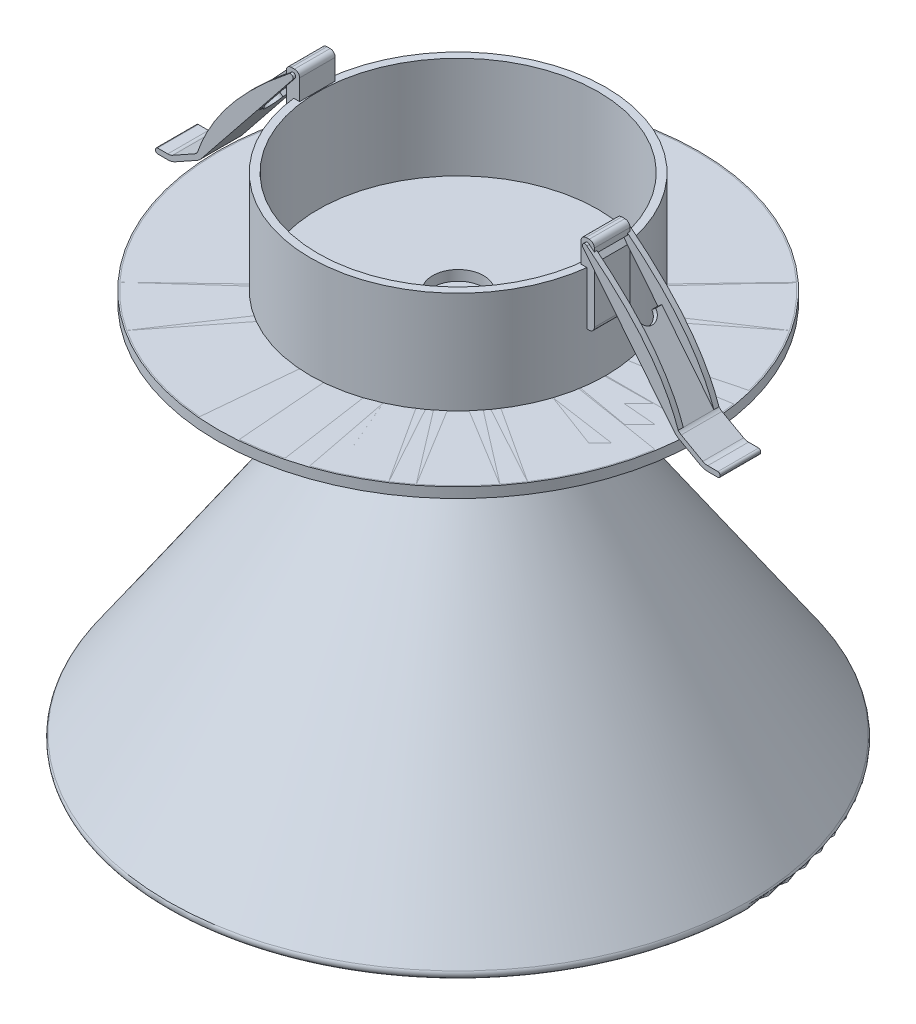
ISO-10303-21;
HEADER;
FILE_DESCRIPTION(('STEP AP214'),'2;1');
FILE_NAME('part.step','',(''),(''),'','','');
FILE_SCHEMA(('AUTOMOTIVE_DESIGN { 1 0 10303 214 1 1 1 1 }'));
ENDSEC;
DATA;
#1=APPLICATION_CONTEXT('core data for automotive mechanical design processes');
#2=APPLICATION_PROTOCOL_DEFINITION('international standard','automotive_design',2000,#1);
#3=PRODUCT_CONTEXT('',#1,'mechanical');
#4=PRODUCT('Part','Part','',(#3));
#5=PRODUCT_RELATED_PRODUCT_CATEGORY('part','',(#4));
#6=PRODUCT_DEFINITION_FORMATION('','',#4);
#7=PRODUCT_DEFINITION_CONTEXT('part definition',#1,'design');
#8=PRODUCT_DEFINITION('design','',#6,#7);
#9=PRODUCT_DEFINITION_SHAPE('','',#8);
#10=(LENGTH_UNIT() NAMED_UNIT(*) SI_UNIT(.MILLI.,.METRE.));
#11=(NAMED_UNIT(*) PLANE_ANGLE_UNIT() SI_UNIT($,.RADIAN.));
#12=(NAMED_UNIT(*) SI_UNIT($,.STERADIAN.) SOLID_ANGLE_UNIT());
#13=UNCERTAINTY_MEASURE_WITH_UNIT(LENGTH_MEASURE(1.E-05),#10,'distance_accuracy_value','');
#14=(GEOMETRIC_REPRESENTATION_CONTEXT(3) GLOBAL_UNCERTAINTY_ASSIGNED_CONTEXT((#13)) GLOBAL_UNIT_ASSIGNED_CONTEXT((#10,
#11,#12)) REPRESENTATION_CONTEXT('',''));
#15=CARTESIAN_POINT('',(0.,0.,0.));
#16=DIRECTION('',(0.,0.,1.));
#17=DIRECTION('',(1.,0.,0.));
#18=AXIS2_PLACEMENT_3D('',#15,#16,#17);
#19=CARTESIAN_POINT('',(-2.84559350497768,-5.63240943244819,0.));
#20=DIRECTION('',(0.,1.,0.));
#21=DIRECTION('',(0.,0.,1.));
#22=AXIS2_PLACEMENT_3D('',#19,#20,#21);
#23=PLANE('',#22);
#24=CARTESIAN_POINT('',(-2.84559350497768,-5.63240943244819,0.));
#25=DIRECTION('',(0.,1.,0.));
#26=DIRECTION('',(0.,0.,1.));
#27=AXIS2_PLACEMENT_3D('',#24,#25,#26);
#28=CIRCLE('',#27,47.);
#29=CARTESIAN_POINT('',(-2.84559350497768,-5.63240943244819,47.));
#30=VERTEX_POINT('',#29);
#31=EDGE_CURVE('P0_E10',#30,#30,#28,.T.);
#32=ORIENTED_EDGE('',*,*,#31,.T.);
#33=EDGE_LOOP('',(#32));
#34=FACE_BOUND('',#33,.T.);
#35=CARTESIAN_POINT('',(-2.84559350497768,-5.63240943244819,0.));
#36=DIRECTION('',(0.,1.,0.));
#37=DIRECTION('',(0.,0.,1.));
#38=AXIS2_PLACEMENT_3D('',#35,#36,#37);
#39=CIRCLE('',#38,5.);
#40=CARTESIAN_POINT('',(-2.84559350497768,-5.63240943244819,5.));
#41=VERTEX_POINT('',#40);
#42=EDGE_CURVE('P0_E26',#41,#41,#39,.T.);
#43=ORIENTED_EDGE('',*,*,#42,.F.);
#44=EDGE_LOOP('',(#43));
#45=FACE_BOUND('',#44,.T.);
#46=ADVANCED_FACE('P0_F15',(#34,#45),#23,.T.);
#47=CARTESIAN_POINT('',(-2.84559350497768,-7.6324094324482,0.));
#48=DIRECTION('',(0.,1.,0.));
#49=DIRECTION('',(0.,0.,1.));
#50=AXIS2_PLACEMENT_3D('',#47,#48,#49);
#51=PLANE('',#50);
#52=CARTESIAN_POINT('',(-2.84559350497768,-7.6324094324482,0.));
#53=DIRECTION('',(0.,1.,0.));
#54=DIRECTION('',(0.,0.,1.));
#55=AXIS2_PLACEMENT_3D('',#52,#53,#54);
#56=CIRCLE('',#55,47.);
#57=CARTESIAN_POINT('',(-2.84559350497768,-7.6324094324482,47.));
#58=VERTEX_POINT('',#57);
#59=EDGE_CURVE('P0_E19',#58,#58,#56,.T.);
#60=ORIENTED_EDGE('',*,*,#59,.F.);
#61=EDGE_LOOP('',(#60));
#62=FACE_BOUND('',#61,.T.);
#63=CARTESIAN_POINT('',(-2.84559350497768,-7.6324094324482,0.));
#64=DIRECTION('',(0.,1.,0.));
#65=DIRECTION('',(0.,0.,1.));
#66=AXIS2_PLACEMENT_3D('',#63,#64,#65);
#67=CIRCLE('',#66,5.);
#68=CARTESIAN_POINT('',(-2.84559350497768,-7.6324094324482,5.));
#69=VERTEX_POINT('',#68);
#70=EDGE_CURVE('P0_E28',#69,#69,#67,.T.);
#71=ORIENTED_EDGE('',*,*,#70,.T.);
#72=EDGE_LOOP('',(#71));
#73=FACE_BOUND('',#72,.T.);
#74=ADVANCED_FACE('P0_F38',(#62,#73),#51,.F.);
#75=CARTESIAN_POINT('',(-2.84559350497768,-5.63240943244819,0.));
#76=DIRECTION('',(0.,-1.,0.));
#77=DIRECTION('',(0.,0.,-1.));
#78=AXIS2_PLACEMENT_3D('',#75,#76,#77);
#79=CYLINDRICAL_SURFACE('',#78,47.);
#80=ORIENTED_EDGE('',*,*,#31,.F.);
#81=EDGE_LOOP('',(#80));
#82=FACE_BOUND('',#81,.T.);
#83=ORIENTED_EDGE('',*,*,#59,.T.);
#84=EDGE_LOOP('',(#83));
#85=FACE_BOUND('',#84,.T.);
#86=ADVANCED_FACE('P0_F17',(#82,#85),#79,.T.);
#87=CARTESIAN_POINT('',(-2.84559350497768,-5.63240943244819,0.));
#88=DIRECTION('',(0.,-1.,0.));
#89=DIRECTION('',(0.,0.,-1.));
#90=AXIS2_PLACEMENT_3D('',#87,#88,#89);
#91=CYLINDRICAL_SURFACE('',#90,5.);
#92=ORIENTED_EDGE('',*,*,#42,.T.);
#93=EDGE_LOOP('',(#92));
#94=FACE_BOUND('',#93,.T.);
#95=ORIENTED_EDGE('',*,*,#70,.F.);
#96=EDGE_LOOP('',(#95));
#97=FACE_BOUND('',#96,.T.);
#98=ADVANCED_FACE('P0_F34',(#94,#97),#91,.F.);
#99=CLOSED_SHELL('',(#46,#74,#86,#98));
#100=MANIFOLD_SOLID_BREP('P0_B1',#99);
#101=CARTESIAN_POINT('',(-2.84559350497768,-82.6324094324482,0.));
#102=DIRECTION('',(0.,-1.,0.));
#103=DIRECTION('',(0.,0.,-1.));
#104=AXIS2_PLACEMENT_3D('',#101,#102,#103);
#105=CONICAL_SURFACE('',#104,58.,0.597775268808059);
#106=CARTESIAN_POINT('',(-2.84559350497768,-81.0696045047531,0.));
#107=DIRECTION('',(0.,1.,0.));
#108=DIRECTION('',(0.,0.,1.));
#109=AXIS2_PLACEMENT_3D('',#106,#107,#108);
#110=CIRCLE('',#109,56.9359239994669);
#111=CARTESIAN_POINT('',(-2.84559350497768,-81.0696045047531,-56.9359239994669));
#112=VERTEX_POINT('',#111);
#113=EDGE_CURVE('P1_E9',#112,#112,#110,.T.);
#114=CARTESIAN_POINT('',(-2.84559350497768,-7.6324094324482,0.));
#115=DIRECTION('',(0.,-1.,0.));
#116=DIRECTION('',(0.,0.,-1.));
#117=AXIS2_PLACEMENT_3D('',#114,#115,#116);
#118=CIRCLE('',#117,6.93431763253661);
#119=CARTESIAN_POINT('',(-2.84559350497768,-7.63240943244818,-6.93431763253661));
#120=VERTEX_POINT('',#119);
#121=EDGE_CURVE('P1_E25',#120,#120,#118,.T.);
#122=CARTESIAN_POINT('',(-2.84559350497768,-81.0696045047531,-56.9359239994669));
#123=CARTESIAN_POINT('',(-2.84559350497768,-80.3046337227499,-56.4150739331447));
#124=CARTESIAN_POINT('',(-2.84559350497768,-79.5396629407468,-55.8942238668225));
#125=CARTESIAN_POINT('',(-2.84559350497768,-78.0097213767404,-54.8525237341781));
#126=CARTESIAN_POINT('',(-2.84559350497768,-77.2447505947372,-54.3316736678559));
#127=CARTESIAN_POINT('',(-2.84559350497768,-75.7148090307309,-53.2899735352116));
#128=CARTESIAN_POINT('',(-2.84559350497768,-74.9498382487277,-52.7691234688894));
#129=CARTESIAN_POINT('',(-2.84559350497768,-73.4198966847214,-51.727423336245));
#130=CARTESIAN_POINT('',(-2.84559350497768,-72.6549259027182,-51.2065732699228));
#131=CARTESIAN_POINT('',(-2.84559350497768,-71.1249843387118,-50.1648731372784));
#132=CARTESIAN_POINT('',(-2.84559350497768,-70.3600135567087,-49.6440230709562));
#133=CARTESIAN_POINT('',(-2.84559350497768,-68.8300719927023,-48.6023229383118));
#134=CARTESIAN_POINT('',(-2.84559350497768,-68.0651012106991,-48.0814728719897));
#135=CARTESIAN_POINT('',(-2.84559350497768,-66.5351596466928,-47.0397727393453));
#136=CARTESIAN_POINT('',(-2.84559350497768,-65.7701888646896,-46.5189226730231));
#137=CARTESIAN_POINT('',(-2.84559350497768,-64.2402473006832,-45.4772225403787));
#138=CARTESIAN_POINT('',(-2.84559350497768,-63.4752765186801,-44.9563724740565));
#139=CARTESIAN_POINT('',(-2.84559350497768,-61.9453349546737,-43.9146723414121));
#140=CARTESIAN_POINT('',(-2.84559350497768,-61.1803641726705,-43.3938222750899));
#141=CARTESIAN_POINT('',(-2.84559350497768,-59.6504226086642,-42.3521221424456));
#142=CARTESIAN_POINT('',(-2.84559350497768,-58.885451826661,-41.8312720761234));
#143=CARTESIAN_POINT('',(-2.84559350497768,-57.3555102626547,-40.789571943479));
#144=CARTESIAN_POINT('',(-2.84559350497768,-56.5905394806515,-40.2687218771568));
#145=CARTESIAN_POINT('',(-2.84559350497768,-55.0605979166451,-39.2270217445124));
#146=CARTESIAN_POINT('',(-2.84559350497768,-54.2956271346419,-38.7061716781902));
#147=CARTESIAN_POINT('',(-2.84559350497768,-52.7656855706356,-37.6644715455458));
#148=CARTESIAN_POINT('',(-2.84559350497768,-52.0007147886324,-37.1436214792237));
#149=CARTESIAN_POINT('',(-2.84559350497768,-50.4707732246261,-36.1019213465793));
#150=CARTESIAN_POINT('',(-2.84559350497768,-49.7058024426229,-35.5810712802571));
#151=CARTESIAN_POINT('',(-2.84559350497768,-48.1758608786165,-34.5393711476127));
#152=CARTESIAN_POINT('',(-2.84559350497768,-47.4108900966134,-34.0185210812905));
#153=CARTESIAN_POINT('',(-2.84559350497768,-45.880948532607,-32.9768209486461));
#154=CARTESIAN_POINT('',(-2.84559350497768,-45.1159777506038,-32.4559708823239));
#155=CARTESIAN_POINT('',(-2.84559350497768,-43.5860361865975,-31.4142707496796));
#156=CARTESIAN_POINT('',(-2.84559350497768,-42.8210654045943,-30.8934206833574));
#157=CARTESIAN_POINT('',(-2.84559350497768,-41.2911238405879,-29.851720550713));
#158=CARTESIAN_POINT('',(-2.84559350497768,-40.5261530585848,-29.3308704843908));
#159=CARTESIAN_POINT('',(-2.84559350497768,-38.9962114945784,-28.2891703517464));
#160=CARTESIAN_POINT('',(-2.84559350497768,-38.2312407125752,-27.7683202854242));
#161=CARTESIAN_POINT('',(-2.84559350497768,-36.7012991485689,-26.7266201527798));
#162=CARTESIAN_POINT('',(-2.84559350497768,-35.9363283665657,-26.2057700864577));
#163=CARTESIAN_POINT('',(-2.84559350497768,-34.4063868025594,-25.1640699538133));
#164=CARTESIAN_POINT('',(-2.84559350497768,-33.6414160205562,-24.6432198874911));
#165=CARTESIAN_POINT('',(-2.84559350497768,-32.1114744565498,-23.6015197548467));
#166=CARTESIAN_POINT('',(-2.84559350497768,-31.3465036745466,-23.0806696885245));
#167=CARTESIAN_POINT('',(-2.84559350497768,-29.8165621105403,-22.0389695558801));
#168=CARTESIAN_POINT('',(-2.84559350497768,-29.0515913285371,-21.5181194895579));
#169=CARTESIAN_POINT('',(-2.84559350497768,-27.5216497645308,-20.4764193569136));
#170=CARTESIAN_POINT('',(-2.84559350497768,-26.7566789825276,-19.9555692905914));
#171=CARTESIAN_POINT('',(-2.84559350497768,-25.2267374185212,-18.913869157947));
#172=CARTESIAN_POINT('',(-2.84559350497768,-24.4617666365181,-18.3930190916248));
#173=CARTESIAN_POINT('',(-2.84559350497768,-22.9318250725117,-17.3513189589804));
#174=CARTESIAN_POINT('',(-2.84559350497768,-22.1668542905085,-16.8304688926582));
#175=CARTESIAN_POINT('',(-2.84559350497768,-20.6369127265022,-15.7887687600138));
#176=CARTESIAN_POINT('',(-2.84559350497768,-19.871941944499,-15.2679186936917));
#177=CARTESIAN_POINT('',(-2.84559350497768,-18.3420003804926,-14.2262185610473));
#178=CARTESIAN_POINT('',(-2.84559350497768,-17.5770295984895,-13.7053684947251));
#179=CARTESIAN_POINT('',(-2.84559350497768,-16.0470880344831,-12.6636683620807));
#180=CARTESIAN_POINT('',(-2.84559350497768,-15.2821172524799,-12.1428182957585));
#181=CARTESIAN_POINT('',(-2.84559350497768,-13.7521756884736,-11.1011181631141));
#182=CARTESIAN_POINT('',(-2.84559350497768,-12.9872049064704,-10.5802680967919));
#183=CARTESIAN_POINT('',(-2.84559350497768,-11.4572633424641,-9.53856796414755));
#184=CARTESIAN_POINT('',(-2.84559350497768,-10.6922925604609,-9.01771789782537));
#185=CARTESIAN_POINT('',(-2.84559350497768,-9.16235099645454,-7.97601776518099));
#186=CARTESIAN_POINT('',(-2.84559350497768,-8.39738021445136,-7.4551676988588));
#187=CARTESIAN_POINT('',(-2.84559350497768,-7.63240943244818,-6.93431763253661));
#188=B_SPLINE_CURVE_WITH_KNOTS('',3,(#122,#123,#124,#125,#126,#127,#128,#129,#130,#131,#132,
#133,#134,#135,#136,#137,#138,#139,#140,#141,#142,#143,#144,#145,#146,#147,#148,#149,#150,#151,
#152,#153,#154,#155,#156,#157,#158,#159,#160,#161,#162,#163,#164,#165,#166,#167,#168,#169,#170,
#171,#172,#173,#174,#175,#176,#177,#178,#179,#180,#181,#182,#183,#184,#185,#186,#187),
.UNSPECIFIED.,.F.,.F.,(4,2,2,2,2,2,2,2,2,2,2,2,2,2,2,2,2,2,2,2,2,2,2,2,2,2,2,2,2,2,2,2,4),(0.,
2.7763619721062,5.55272394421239,8.3290859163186,11.1054478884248,13.881809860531,
16.6581718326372,19.4345338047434,22.2108957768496,24.9872577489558,27.763619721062,
30.5399816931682,33.3163436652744,36.0927056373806,38.8690676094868,41.645429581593,
44.4217915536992,47.1981535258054,49.9745154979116,52.7508774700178,55.527239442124,
58.3036014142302,61.0799633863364,63.8563253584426,66.6326873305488,69.409049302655,
72.1854112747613,74.9617732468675,77.7381352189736,80.5144971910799,83.2908591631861,
86.0672211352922,88.8435831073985),.UNSPECIFIED.);
#189=EDGE_CURVE('P1_BSEAM14',#112,#120,#188,.T.);
#190=ORIENTED_EDGE('',*,*,#113,.T.);
#191=ORIENTED_EDGE('',*,*,#121,.T.);
#192=ORIENTED_EDGE('',*,*,#189,.T.);
#193=ORIENTED_EDGE('',*,*,#189,.F.);
#194=EDGE_LOOP('',(#190,#192,#191,#193));
#195=FACE_BOUND('',#194,.T.);
#196=ADVANCED_FACE('P1_F14',(#195),#105,.T.);
#197=CARTESIAN_POINT('',(-2.84559350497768,-7.6324094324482,0.));
#198=DIRECTION('',(0.,-1.,0.));
#199=DIRECTION('',(0.,0.,-1.));
#200=AXIS2_PLACEMENT_3D('',#197,#198,#199);
#201=PLANE('',#200);
#202=ORIENTED_EDGE('',*,*,#121,.F.);
#203=EDGE_LOOP('',(#202));
#204=FACE_BOUND('',#203,.T.);
#205=ADVANCED_FACE('P1_F51',(#204),#201,.F.);
#206=CARTESIAN_POINT('',(-2.84559350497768,-82.6324094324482,0.));
#207=DIRECTION('',(0.,-1.,0.));
#208=DIRECTION('',(0.,0.,-1.));
#209=AXIS2_PLACEMENT_3D('',#206,#207,#208);
#210=PLANE('',#209);
#211=CARTESIAN_POINT('',(-2.84559350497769,-82.6324094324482,0.));
#212=DIRECTION('',(0.,-1.,0.));
#213=DIRECTION('',(0.,0.,-1.));
#214=AXIS2_PLACEMENT_3D('',#211,#212,#213);
#215=CIRCLE('',#214,54.8261179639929);
#216=CARTESIAN_POINT('',(-2.84559350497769,-82.6324094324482,-54.8261179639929));
#217=VERTEX_POINT('',#216);
#218=EDGE_CURVE('P1_E29',#217,#217,#215,.T.);
#219=ORIENTED_EDGE('',*,*,#218,.F.);
#220=EDGE_LOOP('',(#219));
#221=FACE_BOUND('',#220,.T.);
#222=CARTESIAN_POINT('',(-2.84559350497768,-82.6324094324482,0.));
#223=DIRECTION('',(0.,-1.,0.));
#224=DIRECTION('',(0.,0.,-1.));
#225=AXIS2_PLACEMENT_3D('',#222,#223,#224);
#226=CIRCLE('',#225,56.1093342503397);
#227=CARTESIAN_POINT('',(-2.84559350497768,-82.6324094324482,-56.1093342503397));
#228=VERTEX_POINT('',#227);
#229=EDGE_CURVE('P1_E21',#228,#228,#226,.T.);
#230=ORIENTED_EDGE('',*,*,#229,.T.);
#231=EDGE_LOOP('',(#230));
#232=FACE_BOUND('',#231,.T.);
#233=ADVANCED_FACE('P1_F54',(#221,#232),#210,.T.);
#234=CARTESIAN_POINT('',(-2.84559350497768,-81.6324094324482,0.));
#235=DIRECTION('',(0.,-1.,0.));
#236=DIRECTION('',(0.,0.,-1.));
#237=AXIS2_PLACEMENT_3D('',#234,#235,#236);
#238=TOROIDAL_SURFACE('',#237,56.1093342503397,1.);
#239=ORIENTED_EDGE('',*,*,#113,.F.);
#240=EDGE_LOOP('',(#239));
#241=FACE_BOUND('',#240,.T.);
#242=ORIENTED_EDGE('',*,*,#229,.F.);
#243=EDGE_LOOP('',(#242));
#244=FACE_BOUND('',#243,.T.);
#245=ADVANCED_FACE('P1_F16',(#241,#244),#238,.T.);
#246=CARTESIAN_POINT('',(-57.6717114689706,-82.6324094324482,0.));
#247=CARTESIAN_POINT('',(-43.056731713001,-80.8654462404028,0.));
#248=CARTESIAN_POINT('',(-31.1701521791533,-82.6225090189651,0.));
#249=CARTESIAN_POINT('',(-16.8455935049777,-71.8955605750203,0.));
#250=B_SPLINE_CURVE_WITH_KNOTS('',3,(#246,#247,#248,#249),.UNSPECIFIED.,.F.,.F.,(4,4),(0.,1.),.UNSPECIFIED.);
#251=CARTESIAN_POINT('',(-2.84559350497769,-82.6324094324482,0.));
#252=DIRECTION('',(0.,-1.,0.));
#253=AXIS1_PLACEMENT('',#251,#252);
#254=SURFACE_OF_REVOLUTION('',#250,#253);
#255=CARTESIAN_POINT('',(-2.84559350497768,-71.8955605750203,0.));
#256=DIRECTION('',(0.,-1.,0.));
#257=DIRECTION('',(0.,0.,-1.));
#258=AXIS2_PLACEMENT_3D('',#255,#256,#257);
#259=CIRCLE('',#258,14.);
#260=CARTESIAN_POINT('',(-2.84559350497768,-71.8955605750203,-14.));
#261=VERTEX_POINT('',#260);
#262=EDGE_CURVE('P1_E34',#261,#261,#259,.T.);
#263=ORIENTED_EDGE('',*,*,#262,.F.);
#264=EDGE_LOOP('',(#263));
#265=FACE_BOUND('',#264,.T.);
#266=ORIENTED_EDGE('',*,*,#218,.T.);
#267=EDGE_LOOP('',(#266));
#268=FACE_BOUND('',#267,.T.);
#269=ADVANCED_FACE('P1_F44',(#265,#268),#254,.T.);
#270=CARTESIAN_POINT('',(-2.84559350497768,-71.6324094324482,0.));
#271=DIRECTION('',(0.,-1.,0.));
#272=DIRECTION('',(0.,0.,-1.));
#273=AXIS2_PLACEMENT_3D('',#270,#271,#272);
#274=CYLINDRICAL_SURFACE('',#273,14.);
#275=ORIENTED_EDGE('',*,*,#262,.T.);
#276=EDGE_LOOP('',(#275));
#277=FACE_BOUND('',#276,.T.);
#278=CARTESIAN_POINT('',(-2.84559350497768,-71.6324094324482,0.));
#279=DIRECTION('',(0.,-1.,0.));
#280=DIRECTION('',(0.,0.,-1.));
#281=AXIS2_PLACEMENT_3D('',#278,#279,#280);
#282=CIRCLE('',#281,14.);
#283=CARTESIAN_POINT('',(-2.84559350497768,-71.6324094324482,-14.));
#284=VERTEX_POINT('',#283);
#285=EDGE_CURVE('P1_E137',#284,#284,#282,.T.);
#286=ORIENTED_EDGE('',*,*,#285,.F.);
#287=EDGE_LOOP('',(#286));
#288=FACE_BOUND('',#287,.T.);
#289=ADVANCED_FACE('P1_F48',(#277,#288),#274,.F.);
#290=CARTESIAN_POINT('',(-2.84559350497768,-71.6324094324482,0.));
#291=DIRECTION('',(0.,-1.,0.));
#292=DIRECTION('',(0.,0.,-1.));
#293=AXIS2_PLACEMENT_3D('',#290,#291,#292);
#294=PLANE('',#293);
#295=ORIENTED_EDGE('',*,*,#285,.T.);
#296=EDGE_LOOP('',(#295));
#297=FACE_BOUND('',#296,.T.);
#298=ADVANCED_FACE('P1_F90',(#297),#294,.T.);
#299=CLOSED_SHELL('',(#196,#205,#233,#245,#269,#289,#298));
#300=MANIFOLD_SOLID_BREP('P1_B1',#299);
#301=CARTESIAN_POINT('',(-2.84559350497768,-5.63240943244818,0.));
#302=DIRECTION('',(0.,-1.,0.));
#303=DIRECTION('',(0.,0.,-1.));
#304=AXIS2_PLACEMENT_3D('',#301,#302,#303);
#305=CYLINDRICAL_SURFACE('',#304,47.25);
#306=CARTESIAN_POINT('',(-2.84559350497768,-5.63240943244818,0.));
#307=DIRECTION('',(0.,1.,0.));
#308=DIRECTION('',(0.,0.,1.));
#309=AXIS2_PLACEMENT_3D('',#306,#307,#308);
#310=CIRCLE('',#309,47.25);
#311=CARTESIAN_POINT('',(-2.84559350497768,-5.63240943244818,47.25));
#312=VERTEX_POINT('',#311);
#313=EDGE_CURVE('P2_E22',#312,#312,#310,.T.);
#314=ORIENTED_EDGE('',*,*,#313,.F.);
#315=EDGE_LOOP('',(#314));
#316=FACE_BOUND('',#315,.T.);
#317=CARTESIAN_POINT('',(-2.84559350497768,-7.63240943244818,0.));
#318=DIRECTION('',(0.,1.,0.));
#319=DIRECTION('',(0.,0.,1.));
#320=AXIS2_PLACEMENT_3D('',#317,#318,#319);
#321=CIRCLE('',#320,47.25);
#322=CARTESIAN_POINT('',(-2.84559350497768,-7.63240943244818,47.25));
#323=VERTEX_POINT('',#322);
#324=EDGE_CURVE('P2_E27',#323,#323,#321,.T.);
#325=ORIENTED_EDGE('',*,*,#324,.T.);
#326=EDGE_LOOP('',(#325));
#327=FACE_BOUND('',#326,.T.);
#328=ADVANCED_FACE('P2_F15',(#316,#327),#305,.T.);
#329=CARTESIAN_POINT('',(-2.84559350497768,-5.63240943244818,0.));
#330=DIRECTION('',(0.,1.,0.));
#331=DIRECTION('',(0.,0.,1.));
#332=AXIS2_PLACEMENT_3D('',#329,#330,#331);
#333=PLANE('',#332);
#334=CARTESIAN_POINT('',(-2.84559350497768,-5.63240943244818,0.));
#335=DIRECTION('',(0.,1.,0.));
#336=DIRECTION('',(0.,0.,1.));
#337=AXIS2_PLACEMENT_3D('',#334,#335,#336);
#338=CIRCLE('',#337,29.);
#339=CARTESIAN_POINT('',(-2.84559350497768,-5.63240943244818,29.));
#340=VERTEX_POINT('',#339);
#341=EDGE_CURVE('P2_E10',#340,#340,#338,.T.);
#342=ORIENTED_EDGE('',*,*,#341,.F.);
#343=EDGE_LOOP('',(#342));
#344=FACE_BOUND('',#343,.T.);
#345=ORIENTED_EDGE('',*,*,#313,.T.);
#346=EDGE_LOOP('',(#345));
#347=FACE_BOUND('',#346,.T.);
#348=ADVANCED_FACE('P2_F57',(#344,#347),#333,.T.);
#349=CARTESIAN_POINT('',(-2.84559350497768,-7.63240943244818,0.));
#350=DIRECTION('',(0.,1.,0.));
#351=DIRECTION('',(0.,0.,1.));
#352=AXIS2_PLACEMENT_3D('',#349,#350,#351);
#353=PLANE('',#352);
#354=CARTESIAN_POINT('',(-2.84559350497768,-7.63240943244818,0.));
#355=DIRECTION('',(0.,1.,0.));
#356=DIRECTION('',(0.,0.,1.));
#357=AXIS2_PLACEMENT_3D('',#354,#355,#356);
#358=CIRCLE('',#357,27.5);
#359=CARTESIAN_POINT('',(-2.84559350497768,-7.63240943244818,27.5));
#360=VERTEX_POINT('',#359);
#361=EDGE_CURVE('P2_E36',#360,#360,#358,.F.);
#362=ORIENTED_EDGE('',*,*,#361,.F.);
#363=EDGE_LOOP('',(#362));
#364=FACE_BOUND('',#363,.T.);
#365=ORIENTED_EDGE('',*,*,#324,.F.);
#366=EDGE_LOOP('',(#365));
#367=FACE_BOUND('',#366,.T.);
#368=ADVANCED_FACE('P2_F62',(#364,#367),#353,.F.);
#369=CARTESIAN_POINT('',(-2.84559350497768,14.3675905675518,0.));
#370=DIRECTION('',(0.,-1.,0.));
#371=DIRECTION('',(0.,0.,-1.));
#372=AXIS2_PLACEMENT_3D('',#369,#370,#371);
#373=CYLINDRICAL_SURFACE('',#372,29.);
#374=CARTESIAN_POINT('',(-2.84559350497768,14.3675905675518,0.));
#375=DIRECTION('',(0.,1.,0.));
#376=DIRECTION('',(0.,0.,1.));
#377=AXIS2_PLACEMENT_3D('',#374,#375,#376);
#378=CIRCLE('',#377,29.);
#379=CARTESIAN_POINT('',(-2.84559350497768,14.3675905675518,29.));
#380=VERTEX_POINT('',#379);
#381=EDGE_CURVE('P2_E30',#380,#380,#378,.T.);
#382=ORIENTED_EDGE('',*,*,#381,.F.);
#383=EDGE_LOOP('',(#382));
#384=FACE_BOUND('',#383,.T.);
#385=ORIENTED_EDGE('',*,*,#341,.T.);
#386=EDGE_LOOP('',(#385));
#387=FACE_BOUND('',#386,.T.);
#388=ADVANCED_FACE('P2_F54',(#384,#387),#373,.T.);
#389=CARTESIAN_POINT('',(-2.84559350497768,14.3675905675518,0.));
#390=DIRECTION('',(0.,1.,0.));
#391=DIRECTION('',(0.,0.,1.));
#392=AXIS2_PLACEMENT_3D('',#389,#390,#391);
#393=PLANE('',#392);
#394=CARTESIAN_POINT('',(-2.84559350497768,14.3675905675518,0.));
#395=DIRECTION('',(0.,1.,0.));
#396=DIRECTION('',(0.,0.,1.));
#397=AXIS2_PLACEMENT_3D('',#394,#395,#396);
#398=CIRCLE('',#397,27.5);
#399=CARTESIAN_POINT('',(-2.84559350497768,14.3675905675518,27.5));
#400=VERTEX_POINT('',#399);
#401=EDGE_CURVE('P2_E18',#400,#400,#398,.F.);
#402=ORIENTED_EDGE('',*,*,#401,.T.);
#403=EDGE_LOOP('',(#402));
#404=FACE_BOUND('',#403,.T.);
#405=ORIENTED_EDGE('',*,*,#381,.T.);
#406=EDGE_LOOP('',(#405));
#407=FACE_BOUND('',#406,.T.);
#408=ADVANCED_FACE('P2_F45',(#404,#407),#393,.T.);
#409=CARTESIAN_POINT('',(-2.84559350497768,29.3675905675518,0.));
#410=DIRECTION('',(0.,-1.,0.));
#411=DIRECTION('',(0.,0.,-1.));
#412=AXIS2_PLACEMENT_3D('',#409,#410,#411);
#413=CYLINDRICAL_SURFACE('',#412,27.5);
#414=ORIENTED_EDGE('',*,*,#401,.F.);
#415=EDGE_LOOP('',(#414));
#416=FACE_BOUND('',#415,.T.);
#417=ORIENTED_EDGE('',*,*,#361,.T.);
#418=EDGE_LOOP('',(#417));
#419=FACE_BOUND('',#418,.T.);
#420=ADVANCED_FACE('P2_F47',(#416,#419),#413,.F.);
#421=CLOSED_SHELL('',(#328,#348,#368,#388,#408,#420));
#422=MANIFOLD_SOLID_BREP('P2_B1',#421);
#423=CARTESIAN_POINT('',(-33.0772930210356,4.93912268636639,3.5));
#424=DIRECTION('',(1.,0.,0.));
#425=DIRECTION('',(0.,0.,-1.));
#426=AXIS2_PLACEMENT_3D('',#423,#424,#425);
#427=PLANE('',#426);
#428=DIRECTION('',(0.,-1.,0.));
#429=VECTOR('',#428,1.);
#430=CARTESIAN_POINT('',(-33.0772930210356,4.93912268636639,-3.5));
#431=LINE('',#430,#429);
#432=CARTESIAN_POINT('',(-33.0772930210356,18.4066094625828,-3.5));
#433=VERTEX_POINT('',#432);
#434=CARTESIAN_POINT('',(-33.0772930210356,4.93912268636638,-3.5));
#435=VERTEX_POINT('',#434);
#436=EDGE_CURVE('P3_E108',#433,#435,#431,.T.);
#437=ORIENTED_EDGE('',*,*,#436,.T.);
#438=DIRECTION('',(0.,0.,-1.));
#439=VECTOR('',#438,1.);
#440=CARTESIAN_POINT('',(-33.0772930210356,4.93912268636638,3.5));
#441=LINE('',#440,#439);
#442=CARTESIAN_POINT('',(-33.0772930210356,4.93912268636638,3.5));
#443=VERTEX_POINT('',#442);
#444=EDGE_CURVE('P3_E105',#443,#435,#441,.T.);
#445=ORIENTED_EDGE('',*,*,#444,.F.);
#446=DIRECTION('',(0.,-1.,0.));
#447=VECTOR('',#446,1.);
#448=CARTESIAN_POINT('',(-33.0772930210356,4.93912268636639,3.5));
#449=LINE('',#448,#447);
#450=CARTESIAN_POINT('',(-33.0772930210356,18.4066094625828,3.5));
#451=VERTEX_POINT('',#450);
#452=EDGE_CURVE('P3_E92',#451,#443,#449,.T.);
#453=ORIENTED_EDGE('',*,*,#452,.F.);
#454=DIRECTION('',(0.,0.,-1.));
#455=VECTOR('',#454,1.);
#456=CARTESIAN_POINT('',(-33.0772930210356,18.4066094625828,3.5));
#457=LINE('',#456,#455);
#458=EDGE_CURVE('P3_E111',#451,#433,#457,.T.);
#459=ORIENTED_EDGE('',*,*,#458,.T.);
#460=EDGE_LOOP('',(#437,#445,#453,#459));
#461=FACE_BOUND('',#460,.T.);
#462=DIRECTION('',(0.,0.,1.));
#463=VECTOR('',#462,1.);
#464=CARTESIAN_POINT('',(-33.0772930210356,15.7354998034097,3.5));
#465=LINE('',#464,#463);
#466=CARTESIAN_POINT('',(-33.0772930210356,15.7354998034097,-3.));
#467=VERTEX_POINT('',#466);
#468=CARTESIAN_POINT('',(-33.0772930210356,15.7354998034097,2.9851983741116));
#469=VERTEX_POINT('',#468);
#470=EDGE_CURVE('P3_E11',#467,#469,#465,.T.);
#471=ORIENTED_EDGE('',*,*,#470,.F.);
#472=DIRECTION('',(0.,1.,0.));
#473=VECTOR('',#472,1.);
#474=CARTESIAN_POINT('',(-33.0772930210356,4.93912268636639,-3.));
#475=LINE('',#474,#473);
#476=CARTESIAN_POINT('',(-33.0772930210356,17.3346574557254,-3.));
#477=VERTEX_POINT('',#476);
#478=EDGE_CURVE('P3_E25',#467,#477,#475,.T.);
#479=ORIENTED_EDGE('',*,*,#478,.T.);
#480=DIRECTION('',(0.,0.,1.));
#481=VECTOR('',#480,1.);
#482=CARTESIAN_POINT('',(-33.0772930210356,17.3346574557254,3.5));
#483=LINE('',#482,#481);
#484=CARTESIAN_POINT('',(-33.0772930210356,17.3346574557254,2.9851983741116));
#485=VERTEX_POINT('',#484);
#486=EDGE_CURVE('P3_E146',#477,#485,#483,.T.);
#487=ORIENTED_EDGE('',*,*,#486,.T.);
#488=DIRECTION('',(0.,-1.,0.));
#489=VECTOR('',#488,1.);
#490=CARTESIAN_POINT('',(-33.0772930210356,4.93912268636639,2.9851983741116));
#491=LINE('',#490,#489);
#492=EDGE_CURVE('P3_E149',#485,#469,#491,.T.);
#493=ORIENTED_EDGE('',*,*,#492,.T.);
#494=EDGE_LOOP('',(#471,#479,#487,#493));
#495=FACE_BOUND('',#494,.T.);
#496=ADVANCED_FACE('P3_F17',(#461,#495),#427,.F.);
#497=CARTESIAN_POINT('',(-30.4680460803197,3.93912268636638,3.5));
#498=DIRECTION('',(-1.,0.,0.));
#499=DIRECTION('',(0.,0.,1.));
#500=AXIS2_PLACEMENT_3D('',#497,#498,#499);
#501=PLANE('',#500);
#502=DIRECTION('',(0.,1.,0.));
#503=VECTOR('',#502,1.);
#504=CARTESIAN_POINT('',(-30.4680460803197,3.93912268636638,-3.5));
#505=LINE('',#504,#503);
#506=CARTESIAN_POINT('',(-30.4680460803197,3.93912268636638,-3.5));
#507=VERTEX_POINT('',#506);
#508=CARTESIAN_POINT('',(-30.4680460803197,18.4066094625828,-3.5));
#509=VERTEX_POINT('',#508);
#510=EDGE_CURVE('P3_E120',#507,#509,#505,.T.);
#511=ORIENTED_EDGE('',*,*,#510,.T.);
#512=DIRECTION('',(0.,0.,-1.));
#513=VECTOR('',#512,1.);
#514=CARTESIAN_POINT('',(-30.4680460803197,18.4066094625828,3.5));
#515=LINE('',#514,#513);
#516=CARTESIAN_POINT('',(-30.4680460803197,18.4066094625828,3.5));
#517=VERTEX_POINT('',#516);
#518=EDGE_CURVE('P3_E144',#517,#509,#515,.T.);
#519=ORIENTED_EDGE('',*,*,#518,.F.);
#520=DIRECTION('',(0.,1.,0.));
#521=VECTOR('',#520,1.);
#522=CARTESIAN_POINT('',(-30.4680460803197,3.93912268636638,3.5));
#523=LINE('',#522,#521);
#524=CARTESIAN_POINT('',(-30.4680460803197,3.93912268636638,3.5));
#525=VERTEX_POINT('',#524);
#526=EDGE_CURVE('P3_E134',#525,#517,#523,.T.);
#527=ORIENTED_EDGE('',*,*,#526,.F.);
#528=DIRECTION('',(0.,0.,-1.));
#529=VECTOR('',#528,1.);
#530=CARTESIAN_POINT('',(-30.4680460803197,3.93912268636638,3.5));
#531=LINE('',#530,#529);
#532=EDGE_CURVE('P3_E116',#525,#507,#531,.T.);
#533=ORIENTED_EDGE('',*,*,#532,.T.);
#534=EDGE_LOOP('',(#511,#519,#527,#533));
#535=FACE_BOUND('',#534,.T.);
#536=ADVANCED_FACE('P3_F19',(#535),#501,.F.);
#537=CARTESIAN_POINT('',(-31.4680460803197,18.4066094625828,3.5));
#538=DIRECTION('',(0.,0.,-1.));
#539=DIRECTION('',(-1.,0.,0.));
#540=AXIS2_PLACEMENT_3D('',#537,#538,#539);
#541=CYLINDRICAL_SURFACE('',#540,1.);
#542=CARTESIAN_POINT('',(-31.4680460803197,18.4066094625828,-3.5));
#543=DIRECTION('',(0.,0.,1.));
#544=DIRECTION('',(-1.,0.,0.));
#545=AXIS2_PLACEMENT_3D('',#542,#543,#544);
#546=CIRCLE('',#545,1.);
#547=CARTESIAN_POINT('',(-31.4680460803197,19.4066094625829,-3.5));
#548=VERTEX_POINT('',#547);
#549=EDGE_CURVE('P3_E123',#509,#548,#546,.T.);
#550=ORIENTED_EDGE('',*,*,#549,.T.);
#551=DIRECTION('',(0.,0.,-1.));
#552=VECTOR('',#551,1.);
#553=CARTESIAN_POINT('',(-31.4680460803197,19.4066094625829,3.5));
#554=LINE('',#553,#552);
#555=CARTESIAN_POINT('',(-31.4680460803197,19.4066094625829,3.5));
#556=VERTEX_POINT('',#555);
#557=EDGE_CURVE('P3_E141',#556,#548,#554,.T.);
#558=ORIENTED_EDGE('',*,*,#557,.F.);
#559=CARTESIAN_POINT('',(-31.4680460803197,18.4066094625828,3.5));
#560=DIRECTION('',(0.,0.,1.));
#561=DIRECTION('',(-1.,0.,0.));
#562=AXIS2_PLACEMENT_3D('',#559,#560,#561);
#563=CIRCLE('',#562,1.);
#564=EDGE_CURVE('P3_E80',#517,#556,#563,.T.);
#565=ORIENTED_EDGE('',*,*,#564,.F.);
#566=ORIENTED_EDGE('',*,*,#518,.T.);
#567=EDGE_LOOP('',(#550,#558,#565,#566));
#568=FACE_BOUND('',#567,.T.);
#569=ADVANCED_FACE('P3_F206',(#568),#541,.T.);
#570=CARTESIAN_POINT('',(-32.0772930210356,19.4066094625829,3.5));
#571=DIRECTION('',(0.,-1.,0.));
#572=DIRECTION('',(0.,0.,-1.));
#573=AXIS2_PLACEMENT_3D('',#570,#571,#572);
#574=PLANE('',#573);
#575=DIRECTION('',(-1.,0.,0.));
#576=VECTOR('',#575,1.);
#577=CARTESIAN_POINT('',(-32.0772930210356,19.4066094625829,-3.5));
#578=LINE('',#577,#576);
#579=CARTESIAN_POINT('',(-32.0772930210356,19.4066094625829,-3.5));
#580=VERTEX_POINT('',#579);
#581=EDGE_CURVE('P3_E126',#548,#580,#578,.T.);
#582=ORIENTED_EDGE('',*,*,#581,.T.);
#583=DIRECTION('',(0.,0.,-1.));
#584=VECTOR('',#583,1.);
#585=CARTESIAN_POINT('',(-32.0772930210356,19.4066094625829,3.5));
#586=LINE('',#585,#584);
#587=CARTESIAN_POINT('',(-32.0772930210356,19.4066094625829,3.5));
#588=VERTEX_POINT('',#587);
#589=EDGE_CURVE('P3_E138',#588,#580,#586,.T.);
#590=ORIENTED_EDGE('',*,*,#589,.F.);
#591=DIRECTION('',(-1.,0.,0.));
#592=VECTOR('',#591,1.);
#593=CARTESIAN_POINT('',(-32.0772930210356,19.4066094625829,3.5));
#594=LINE('',#593,#592);
#595=EDGE_CURVE('P3_E190',#556,#588,#594,.T.);
#596=ORIENTED_EDGE('',*,*,#595,.F.);
#597=ORIENTED_EDGE('',*,*,#557,.T.);
#598=EDGE_LOOP('',(#582,#590,#596,#597));
#599=FACE_BOUND('',#598,.T.);
#600=ADVANCED_FACE('P3_F194',(#599),#574,.F.);
#601=CARTESIAN_POINT('',(-32.0772930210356,18.4066094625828,3.5));
#602=DIRECTION('',(0.,0.,-1.));
#603=DIRECTION('',(-1.,0.,0.));
#604=AXIS2_PLACEMENT_3D('',#601,#602,#603);
#605=CYLINDRICAL_SURFACE('',#604,1.);
#606=CARTESIAN_POINT('',(-32.0772930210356,18.4066094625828,-3.5));
#607=DIRECTION('',(0.,0.,1.));
#608=DIRECTION('',(-1.,0.,0.));
#609=AXIS2_PLACEMENT_3D('',#606,#607,#608);
#610=CIRCLE('',#609,1.);
#611=EDGE_CURVE('P3_E128',#580,#433,#610,.T.);
#612=ORIENTED_EDGE('',*,*,#611,.T.);
#613=ORIENTED_EDGE('',*,*,#458,.F.);
#614=CARTESIAN_POINT('',(-32.0772930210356,18.4066094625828,3.5));
#615=DIRECTION('',(0.,0.,1.));
#616=DIRECTION('',(-1.,0.,0.));
#617=AXIS2_PLACEMENT_3D('',#614,#615,#616);
#618=CIRCLE('',#617,1.);
#619=EDGE_CURVE('P3_E99',#588,#451,#618,.T.);
#620=ORIENTED_EDGE('',*,*,#619,.F.);
#621=ORIENTED_EDGE('',*,*,#589,.T.);
#622=EDGE_LOOP('',(#612,#613,#620,#621));
#623=FACE_BOUND('',#622,.T.);
#624=ADVANCED_FACE('P3_F198',(#623),#605,.T.);
#625=CARTESIAN_POINT('',(-32.0772930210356,4.93912268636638,3.5));
#626=DIRECTION('',(0.,0.,-1.));
#627=DIRECTION('',(-1.,0.,0.));
#628=AXIS2_PLACEMENT_3D('',#625,#626,#627);
#629=CYLINDRICAL_SURFACE('',#628,1.);
#630=CARTESIAN_POINT('',(-32.0772930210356,4.93912268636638,-3.5));
#631=DIRECTION('',(0.,0.,1.));
#632=DIRECTION('',(-1.,0.,0.));
#633=AXIS2_PLACEMENT_3D('',#630,#631,#632);
#634=CIRCLE('',#633,1.);
#635=CARTESIAN_POINT('',(-32.0772930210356,3.93912268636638,-3.5));
#636=VERTEX_POINT('',#635);
#637=EDGE_CURVE('P3_E131',#435,#636,#634,.T.);
#638=ORIENTED_EDGE('',*,*,#637,.T.);
#639=DIRECTION('',(0.,0.,-1.));
#640=VECTOR('',#639,1.);
#641=CARTESIAN_POINT('',(-32.0772930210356,3.93912268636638,3.5));
#642=LINE('',#641,#640);
#643=CARTESIAN_POINT('',(-32.0772930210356,3.93912268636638,3.5));
#644=VERTEX_POINT('',#643);
#645=EDGE_CURVE('P3_E112',#644,#636,#642,.T.);
#646=ORIENTED_EDGE('',*,*,#645,.F.);
#647=CARTESIAN_POINT('',(-32.0772930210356,4.93912268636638,3.5));
#648=DIRECTION('',(0.,0.,1.));
#649=DIRECTION('',(-1.,0.,0.));
#650=AXIS2_PLACEMENT_3D('',#647,#648,#649);
#651=CIRCLE('',#650,1.);
#652=EDGE_CURVE('P3_E96',#443,#644,#651,.T.);
#653=ORIENTED_EDGE('',*,*,#652,.F.);
#654=ORIENTED_EDGE('',*,*,#444,.T.);
#655=EDGE_LOOP('',(#638,#646,#653,#654));
#656=FACE_BOUND('',#655,.T.);
#657=ADVANCED_FACE('P3_F114',(#656),#629,.T.);
#658=CARTESIAN_POINT('',(-32.0772930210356,3.93912268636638,3.5));
#659=DIRECTION('',(0.,1.,0.));
#660=DIRECTION('',(0.,0.,1.));
#661=AXIS2_PLACEMENT_3D('',#658,#659,#660);
#662=PLANE('',#661);
#663=DIRECTION('',(1.,0.,0.));
#664=VECTOR('',#663,1.);
#665=CARTESIAN_POINT('',(-32.0772930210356,3.93912268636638,-3.5));
#666=LINE('',#665,#664);
#667=EDGE_CURVE('P3_E71',#636,#507,#666,.T.);
#668=ORIENTED_EDGE('',*,*,#667,.T.);
#669=ORIENTED_EDGE('',*,*,#532,.F.);
#670=DIRECTION('',(1.,0.,0.));
#671=VECTOR('',#670,1.);
#672=CARTESIAN_POINT('',(-32.0772930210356,3.93912268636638,3.5));
#673=LINE('',#672,#671);
#674=EDGE_CURVE('P3_E41',#644,#525,#673,.T.);
#675=ORIENTED_EDGE('',*,*,#674,.F.);
#676=ORIENTED_EDGE('',*,*,#645,.T.);
#677=EDGE_LOOP('',(#668,#669,#675,#676));
#678=FACE_BOUND('',#677,.T.);
#679=ADVANCED_FACE('P3_F202',(#678),#662,.F.);
#680=CARTESIAN_POINT('',(-31.4680460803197,18.4066094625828,3.5));
#681=DIRECTION('',(0.,0.,-1.));
#682=DIRECTION('',(-1.,0.,0.));
#683=AXIS2_PLACEMENT_3D('',#680,#681,#682);
#684=PLANE('',#683);
#685=ORIENTED_EDGE('',*,*,#526,.T.);
#686=ORIENTED_EDGE('',*,*,#564,.T.);
#687=ORIENTED_EDGE('',*,*,#595,.T.);
#688=ORIENTED_EDGE('',*,*,#619,.T.);
#689=ORIENTED_EDGE('',*,*,#452,.T.);
#690=ORIENTED_EDGE('',*,*,#652,.T.);
#691=ORIENTED_EDGE('',*,*,#674,.T.);
#692=EDGE_LOOP('',(#685,#686,#687,#688,#689,#690,#691));
#693=FACE_BOUND('',#692,.T.);
#694=ADVANCED_FACE('P3_F94',(#693),#684,.F.);
#695=CARTESIAN_POINT('',(-31.4680460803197,18.4066094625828,-3.5));
#696=DIRECTION('',(0.,0.,-1.));
#697=DIRECTION('',(-1.,0.,0.));
#698=AXIS2_PLACEMENT_3D('',#695,#696,#697);
#699=PLANE('',#698);
#700=ORIENTED_EDGE('',*,*,#510,.F.);
#701=ORIENTED_EDGE('',*,*,#667,.F.);
#702=ORIENTED_EDGE('',*,*,#637,.F.);
#703=ORIENTED_EDGE('',*,*,#436,.F.);
#704=ORIENTED_EDGE('',*,*,#611,.F.);
#705=ORIENTED_EDGE('',*,*,#581,.F.);
#706=ORIENTED_EDGE('',*,*,#549,.F.);
#707=EDGE_LOOP('',(#700,#701,#702,#703,#704,#705,#706));
#708=FACE_BOUND('',#707,.T.);
#709=ADVANCED_FACE('P3_F201',(#708),#699,.T.);
#710=CARTESIAN_POINT('',(-32.2530793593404,16.7640528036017,-3.));
#711=DIRECTION('',(0.,0.,-1.));
#712=DIRECTION('',(-1.,0.,0.));
#713=AXIS2_PLACEMENT_3D('',#710,#711,#712);
#714=PLANE('',#713);
#715=DIRECTION('',(-0.625329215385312,-0.780361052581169,0.));
#716=VECTOR('',#715,1.);
#717=CARTESIAN_POINT('',(-32.2530793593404,16.7640528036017,-3.));
#718=LINE('',#717,#716);
#719=CARTESIAN_POINT('',(-32.2530793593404,16.7640528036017,-3.));
#720=VERTEX_POINT('',#719);
#721=EDGE_CURVE('P3_E164',#720,#467,#718,.T.);
#722=ORIENTED_EDGE('',*,*,#721,.F.);
#723=DIRECTION('',(-0.780361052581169,0.625329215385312,0.));
#724=VECTOR('',#723,1.);
#725=CARTESIAN_POINT('',(-32.2530793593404,16.7640528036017,-3.));
#726=LINE('',#725,#724);
#727=CARTESIAN_POINT('',(-33.0334404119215,17.389382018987,-3.));
#728=VERTEX_POINT('',#727);
#729=EDGE_CURVE('P3_E124',#720,#728,#726,.T.);
#730=ORIENTED_EDGE('',*,*,#729,.T.);
#731=DIRECTION('',(-0.625329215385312,-0.780361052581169,0.));
#732=VECTOR('',#731,1.);
#733=CARTESIAN_POINT('',(-33.0334404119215,17.389382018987,-3.));
#734=LINE('',#733,#732);
#735=EDGE_CURVE('P3_E167',#728,#477,#734,.T.);
#736=ORIENTED_EDGE('',*,*,#735,.T.);
#737=ORIENTED_EDGE('',*,*,#478,.F.);
#738=EDGE_LOOP('',(#722,#730,#736,#737));
#739=FACE_BOUND('',#738,.T.);
#740=ADVANCED_FACE('P3_F162',(#739),#714,.F.);
#741=CARTESIAN_POINT('',(-32.2530793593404,16.7640528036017,2.9851983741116));
#742=DIRECTION('',(0.,0.,1.));
#743=DIRECTION('',(0.,-1.,0.));
#744=AXIS2_PLACEMENT_3D('',#741,#742,#743);
#745=PLANE('',#744);
#746=DIRECTION('',(0.625329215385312,0.780361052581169,0.));
#747=VECTOR('',#746,1.);
#748=CARTESIAN_POINT('',(-33.0334404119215,17.389382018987,2.9851983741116));
#749=LINE('',#748,#747);
#750=CARTESIAN_POINT('',(-33.0334404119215,17.389382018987,2.9851983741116));
#751=VERTEX_POINT('',#750);
#752=EDGE_CURVE('P3_E32',#485,#751,#749,.T.);
#753=ORIENTED_EDGE('',*,*,#752,.T.);
#754=DIRECTION('',(-0.780361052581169,0.625329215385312,0.));
#755=VECTOR('',#754,1.);
#756=CARTESIAN_POINT('',(-32.2530793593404,16.7640528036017,2.9851983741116));
#757=LINE('',#756,#755);
#758=CARTESIAN_POINT('',(-32.2530793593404,16.7640528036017,2.9851983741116));
#759=VERTEX_POINT('',#758);
#760=EDGE_CURVE('P3_E182',#759,#751,#757,.T.);
#761=ORIENTED_EDGE('',*,*,#760,.F.);
#762=DIRECTION('',(0.625329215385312,0.780361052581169,0.));
#763=VECTOR('',#762,1.);
#764=CARTESIAN_POINT('',(-32.2530793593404,16.7640528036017,2.9851983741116));
#765=LINE('',#764,#763);
#766=EDGE_CURVE('P3_E174',#469,#759,#765,.T.);
#767=ORIENTED_EDGE('',*,*,#766,.F.);
#768=ORIENTED_EDGE('',*,*,#492,.F.);
#769=EDGE_LOOP('',(#753,#761,#767,#768));
#770=FACE_BOUND('',#769,.T.);
#771=ADVANCED_FACE('P3_F237',(#770),#745,.F.);
#772=CARTESIAN_POINT('',(-39.0465732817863,8.28631349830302,-0.00740081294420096));
#773=DIRECTION('',(-0.780361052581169,0.625329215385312,0.));
#774=DIRECTION('',(-0.625329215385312,-0.780361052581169,0.));
#775=AXIS2_PLACEMENT_3D('',#772,#773,#774);
#776=PLANE('',#775);
#777=ORIENTED_EDGE('',*,*,#470,.T.);
#778=ORIENTED_EDGE('',*,*,#766,.T.);
#779=DIRECTION('',(0.,0.,-1.));
#780=VECTOR('',#779,1.);
#781=CARTESIAN_POINT('',(-32.2530793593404,16.7640528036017,-3.));
#782=LINE('',#781,#780);
#783=EDGE_CURVE('P3_E173',#759,#720,#782,.T.);
#784=ORIENTED_EDGE('',*,*,#783,.T.);
#785=ORIENTED_EDGE('',*,*,#721,.T.);
#786=EDGE_LOOP('',(#777,#778,#784,#785));
#787=FACE_BOUND('',#786,.T.);
#788=ADVANCED_FACE('P3_F169',(#787),#776,.T.);
#789=CARTESIAN_POINT('',(-39.8269343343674,8.91164271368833,-0.00740081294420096));
#790=DIRECTION('',(-0.780361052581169,0.625329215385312,0.));
#791=DIRECTION('',(-0.625329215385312,-0.780361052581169,0.));
#792=AXIS2_PLACEMENT_3D('',#789,#790,#791);
#793=PLANE('',#792);
#794=ORIENTED_EDGE('',*,*,#735,.F.);
#795=DIRECTION('',(0.,0.,-1.));
#796=VECTOR('',#795,1.);
#797=CARTESIAN_POINT('',(-33.0334404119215,17.389382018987,-3.));
#798=LINE('',#797,#796);
#799=EDGE_CURVE('P3_E175',#751,#728,#798,.T.);
#800=ORIENTED_EDGE('',*,*,#799,.F.);
#801=ORIENTED_EDGE('',*,*,#752,.F.);
#802=ORIENTED_EDGE('',*,*,#486,.F.);
#803=EDGE_LOOP('',(#794,#800,#801,#802));
#804=FACE_BOUND('',#803,.T.);
#805=ADVANCED_FACE('P3_F244',(#804),#793,.F.);
#806=CARTESIAN_POINT('',(-32.2530793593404,16.7640528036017,-3.));
#807=DIRECTION('',(0.625329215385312,0.780361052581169,0.));
#808=DIRECTION('',(-0.780361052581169,0.625329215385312,0.));
#809=AXIS2_PLACEMENT_3D('',#806,#807,#808);
#810=PLANE('',#809);
#811=ORIENTED_EDGE('',*,*,#799,.T.);
#812=ORIENTED_EDGE('',*,*,#729,.F.);
#813=ORIENTED_EDGE('',*,*,#783,.F.);
#814=ORIENTED_EDGE('',*,*,#760,.T.);
#815=EDGE_LOOP('',(#811,#812,#813,#814));
#816=FACE_BOUND('',#815,.T.);
#817=ADVANCED_FACE('P3_F241',(#816),#810,.F.);
#818=CLOSED_SHELL('',(#496,#536,#569,#600,#624,#657,#679,#694,#709,#740,#771,#788,#805,#817));
#819=MANIFOLD_SOLID_BREP('P3_B1',#818);
#820=CARTESIAN_POINT('',(-32.1139372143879,18.5368487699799,4.));
#821=CARTESIAN_POINT('',(-39.6128742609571,12.5598125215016,4.));
#822=CARTESIAN_POINT('',(-46.8306668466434,5.44110696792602,4.));
#823=CARTESIAN_POINT('',(-50.0424332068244,-3.83648620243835,4.));
#824=B_SPLINE_CURVE_WITH_KNOTS('',3,(#820,#821,#822,#823),.UNSPECIFIED.,.F.,.F.,(4,4),(0.,1.),.UNSPECIFIED.);
#825=DIRECTION('',(0.,0.,-1.));
#826=VECTOR('',#825,1.);
#827=SURFACE_OF_LINEAR_EXTRUSION('',#824,#826);
#828=CARTESIAN_POINT('',(-32.1139372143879,18.5368487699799,-3.));
#829=CARTESIAN_POINT('',(-32.6094276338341,18.1419121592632,-3.));
#830=CARTESIAN_POINT('',(-33.1020365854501,17.7433190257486,-3.));
#831=CARTESIAN_POINT('',(-34.0803651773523,16.9376292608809,-3.));
#832=CARTESIAN_POINT('',(-34.5660838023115,16.5305313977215,-3.));
#833=CARTESIAN_POINT('',(-35.5300937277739,15.7061289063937,-3.));
#834=CARTESIAN_POINT('',(-36.0083725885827,15.2888096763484,-3.));
#835=CARTESIAN_POINT('',(-36.9553549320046,14.4435163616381,-3.));
#836=CARTESIAN_POINT('',(-37.4240587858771,14.0155426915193,-3.));
#837=CARTESIAN_POINT('',(-38.8144656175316,12.7132879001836,-3.));
#838=CARTESIAN_POINT('',(-39.7198162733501,11.8212206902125,-3.));
#839=CARTESIAN_POINT('',(-41.034541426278,10.442144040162,-3.));
#840=CARTESIAN_POINT('',(-41.4655445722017,9.97564841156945,-3.));
#841=CARTESIAN_POINT('',(-42.3112402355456,9.02805606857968,-3.));
#842=CARTESIAN_POINT('',(-42.7259330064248,8.54695958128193,-3.));
#843=CARTESIAN_POINT('',(-43.5358313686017,7.57070547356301,-3.));
#844=CARTESIAN_POINT('',(-43.9310845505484,7.07558740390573,-3.));
#845=CARTESIAN_POINT('',(-44.7009909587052,6.06951937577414,-3.));
#846=CARTESIAN_POINT('',(-45.0756434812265,5.55856887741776,-3.));
#847=CARTESIAN_POINT('',(-45.8017134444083,4.52080010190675,-3.));
#848=CARTESIAN_POINT('',(-46.1531434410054,3.9939906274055,-3.));
#849=CARTESIAN_POINT('',(-46.8304566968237,2.92420087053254,-3.));
#850=CARTESIAN_POINT('',(-47.1563420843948,2.38122194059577,-3.));
#851=CARTESIAN_POINT('',(-47.6839285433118,1.44915399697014,-3.));
#852=CARTESIAN_POINT('',(-47.8929526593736,1.06420182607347,-3.));
#853=CARTESIAN_POINT('',(-48.1957950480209,0.481215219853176,-3.));
#854=CARTESIAN_POINT('',(-48.2949649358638,0.285949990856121,-3.));
#855=CARTESIAN_POINT('',(-48.4896393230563,-0.106399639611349,-3.));
#856=CARTESIAN_POINT('',(-48.5851438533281,-0.303484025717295,-3.));
#857=CARTESIAN_POINT('',(-48.7724013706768,-0.699457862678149,-3.));
#858=CARTESIAN_POINT('',(-48.8641538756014,-0.898347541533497,-3.));
#859=CARTESIAN_POINT('',(-49.043803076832,-1.29786913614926,-3.));
#860=CARTESIAN_POINT('',(-49.1316996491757,-1.4985011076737,-3.));
#861=CARTESIAN_POINT('',(-49.3038089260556,-1.90207305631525,-3.));
#862=CARTESIAN_POINT('',(-49.3880093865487,-2.10501825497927,-3.));
#863=CARTESIAN_POINT('',(-49.5523430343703,-2.51253173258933,-3.));
#864=CARTESIAN_POINT('',(-49.6324765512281,-2.71709987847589,-3.));
#865=CARTESIAN_POINT('',(-49.749574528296,-3.02514306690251,-3.));
#866=CARTESIAN_POINT('',(-49.7880926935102,-3.12802977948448,-3.));
#867=CARTESIAN_POINT('',(-49.8450853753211,-3.28264824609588,-3.));
#868=CARTESIAN_POINT('',(-49.8639520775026,-3.33423552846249,-3.));
#869=CARTESIAN_POINT('',(-49.9014236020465,-3.43750493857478,-3.));
#870=CARTESIAN_POINT('',(-49.9200284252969,-3.48918706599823,-3.));
#871=CARTESIAN_POINT('',(-49.9569739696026,-3.59265216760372,-3.));
#872=CARTESIAN_POINT('',(-49.9753146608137,-3.64443515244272,-3.));
#873=CARTESIAN_POINT('',(-50.0026342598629,-3.72217697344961,-3.));
#874=CARTESIAN_POINT('',(-50.0117089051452,-3.74810219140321,-3.));
#875=CARTESIAN_POINT('',(-50.0297788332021,-3.7999802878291,-3.));
#876=CARTESIAN_POINT('',(-50.0387741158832,-3.82593316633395,-3.));
#877=CARTESIAN_POINT('',(-50.0657467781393,-3.90379697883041,-3.));
#878=CARTESIAN_POINT('',(-50.0837107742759,-3.95571252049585,-3.));
#879=CARTESIAN_POINT('',(-50.1196480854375,-4.0595402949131,-3.));
#880=CARTESIAN_POINT('',(-50.1376214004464,-4.11145252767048,-3.));
#881=CARTESIAN_POINT('',(-50.1915160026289,-4.26712432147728,-3.));
#882=CARTESIAN_POINT('',(-50.2274347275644,-4.37088476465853,-3.));
#883=CARTESIAN_POINT('',(-50.2992737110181,-4.5784041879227,-3.));
#884=CARTESIAN_POINT('',(-50.3351939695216,-4.68216316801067,-3.));
#885=CARTESIAN_POINT('',(-50.4070261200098,-4.88965843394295,-3.));
#886=CARTESIAN_POINT('',(-50.4429380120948,-4.99339471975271,-3.));
#887=CARTESIAN_POINT('',(-50.5147620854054,-5.20086812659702,-3.));
#888=CARTESIAN_POINT('',(-50.5506742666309,-5.30460524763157,-3.));
#889=CARTESIAN_POINT('',(-50.586586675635,-5.40834229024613,-3.));
#890=B_SPLINE_CURVE_WITH_KNOTS('',3,(#828,#829,#830,#831,#832,#833,#834,#835,#836,#837,#838,
#839,#840,#841,#842,#843,#844,#845,#846,#847,#848,#849,#850,#851,#852,#853,#854,#855,#856,#857,
#858,#859,#860,#861,#862,#863,#864,#865,#866,#867,#868,#869,#870,#871,#872,#873,#874,#875,#876,
#877,#878,#879,#880,#881,#882,#883,#884,#885,#886,#887,#888,#889),.UNSPECIFIED.,.F.,.F.,(4,2,2,
2,2,2,2,2,2,2,2,2,2,2,2,2,2,2,2,2,2,2,2,2,2,2,2,2,2,2,4),(0.,1.90090623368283,3.80208972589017,
5.70616898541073,7.61017427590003,11.420726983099,13.3258007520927,15.2308449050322,
17.1309659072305,19.0311517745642,20.9303016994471,22.8292932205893,24.1431243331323,
24.8001060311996,25.4570821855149,26.1141425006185,26.7712239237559,27.4303390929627,
28.0894007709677,28.4189771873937,28.5837636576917,28.7485495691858,28.9133539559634,
28.9957564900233,29.0781591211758,29.242966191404,29.407772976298,29.7371776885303,
30.066579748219,30.3959092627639,30.7252414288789),.UNSPECIFIED.);
#891=CARTESIAN_POINT('',(-32.1139372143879,18.5368487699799,-3.));
#892=VERTEX_POINT('',#891);
#893=CARTESIAN_POINT('',(-50.0424332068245,-3.83648620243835,-3.));
#894=VERTEX_POINT('',#893);
#895=EDGE_CURVE('P4_E212',#892,#894,#890,.T.);
#896=ORIENTED_EDGE('',*,*,#895,.F.);
#897=DIRECTION('',(0.,0.,-1.));
#898=VECTOR('',#897,1.);
#899=CARTESIAN_POINT('',(-32.1139372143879,18.5368487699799,4.));
#900=LINE('',#899,#898);
#901=CARTESIAN_POINT('',(-32.1139372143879,18.5368487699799,-4.));
#902=VERTEX_POINT('',#901);
#903=EDGE_CURVE('P4_E25',#892,#902,#900,.T.);
#904=ORIENTED_EDGE('',*,*,#903,.T.);
#905=CARTESIAN_POINT('',(-32.1139372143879,18.5368487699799,-4.));
#906=CARTESIAN_POINT('',(-39.6128742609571,12.5598125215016,-4.));
#907=CARTESIAN_POINT('',(-46.8306668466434,5.44110696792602,-4.));
#908=CARTESIAN_POINT('',(-50.0424332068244,-3.83648620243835,-4.));
#909=B_SPLINE_CURVE_WITH_KNOTS('',3,(#905,#906,#907,#908),.UNSPECIFIED.,.F.,.F.,(4,4),(0.,1.),.UNSPECIFIED.);
#910=CARTESIAN_POINT('',(-50.0424332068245,-3.83648620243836,-4.));
#911=VERTEX_POINT('',#910);
#912=EDGE_CURVE('P4_E356',#902,#911,#909,.T.);
#913=ORIENTED_EDGE('',*,*,#912,.T.);
#914=DIRECTION('',(0.,0.,-1.));
#915=VECTOR('',#914,1.);
#916=CARTESIAN_POINT('',(-50.0424332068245,-3.83648620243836,4.));
#917=LINE('',#916,#915);
#918=EDGE_CURVE('P4_E422',#894,#911,#917,.T.);
#919=ORIENTED_EDGE('',*,*,#918,.F.);
#920=EDGE_LOOP('',(#896,#904,#913,#919));
#921=FACE_BOUND('',#920,.T.);
#922=ADVANCED_FACE('P4_F17',(#921),#827,.F.);
#923=CARTESIAN_POINT('',(-31.7237566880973,18.2241841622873,4.));
#924=DIRECTION('',(0.,0.,-1.));
#925=DIRECTION('',(-1.,0.,0.));
#926=AXIS2_PLACEMENT_3D('',#923,#924,#925);
#927=CYLINDRICAL_SURFACE('',#926,0.500000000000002);
#928=CARTESIAN_POINT('',(-31.7237566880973,18.2241841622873,-4.));
#929=DIRECTION('',(0.,0.,1.));
#930=DIRECTION('',(1.,0.,0.));
#931=AXIS2_PLACEMENT_3D('',#928,#929,#930);
#932=CIRCLE('',#931,0.500000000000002);
#933=CARTESIAN_POINT('',(-31.3335761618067,17.9115195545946,-4.));
#934=VERTEX_POINT('',#933);
#935=EDGE_CURVE('P4_E353',#934,#902,#932,.T.);
#936=ORIENTED_EDGE('',*,*,#935,.T.);
#937=ORIENTED_EDGE('',*,*,#903,.F.);
#938=DIRECTION('',(0.,0.,-1.));
#939=VECTOR('',#938,1.);
#940=CARTESIAN_POINT('',(-32.1139372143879,18.5368487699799,3.));
#941=LINE('',#940,#939);
#942=CARTESIAN_POINT('',(-32.1139372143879,18.5368487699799,3.));
#943=VERTEX_POINT('',#942);
#944=EDGE_CURVE('P4_E253',#943,#892,#941,.T.);
#945=ORIENTED_EDGE('',*,*,#944,.F.);
#946=CARTESIAN_POINT('',(-32.1139372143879,18.5368487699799,4.));
#947=VERTEX_POINT('',#946);
#948=EDGE_CURVE('P4_E11',#947,#943,#900,.T.);
#949=ORIENTED_EDGE('',*,*,#948,.F.);
#950=CARTESIAN_POINT('',(-31.7237566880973,18.2241841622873,4.));
#951=DIRECTION('',(0.,0.,1.));
#952=DIRECTION('',(1.,0.,0.));
#953=AXIS2_PLACEMENT_3D('',#950,#951,#952);
#954=CIRCLE('',#953,0.500000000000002);
#955=CARTESIAN_POINT('',(-31.3335761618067,17.9115195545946,4.));
#956=VERTEX_POINT('',#955);
#957=EDGE_CURVE('P4_E254',#956,#947,#954,.T.);
#958=ORIENTED_EDGE('',*,*,#957,.F.);
#959=DIRECTION('',(0.,0.,-1.));
#960=VECTOR('',#959,1.);
#961=CARTESIAN_POINT('',(-31.3335761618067,17.9115195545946,4.));
#962=LINE('',#961,#960);
#963=EDGE_CURVE('P4_E352',#956,#934,#962,.T.);
#964=ORIENTED_EDGE('',*,*,#963,.T.);
#965=EDGE_LOOP('',(#936,#937,#945,#949,#958,#964));
#966=FACE_BOUND('',#965,.T.);
#967=ADVANCED_FACE('P4_F19',(#966),#927,.T.);
#968=ORIENTED_EDGE('',*,*,#948,.T.);
#969=CARTESIAN_POINT('',(-32.1139372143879,18.5368487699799,3.));
#970=CARTESIAN_POINT('',(-32.6094276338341,18.1419121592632,3.));
#971=CARTESIAN_POINT('',(-33.1020365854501,17.7433190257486,3.));
#972=CARTESIAN_POINT('',(-34.0803651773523,16.9376292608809,3.));
#973=CARTESIAN_POINT('',(-34.5660838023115,16.5305313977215,3.));
#974=CARTESIAN_POINT('',(-35.5300937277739,15.7061289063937,3.));
#975=CARTESIAN_POINT('',(-36.0083725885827,15.2888096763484,3.));
#976=CARTESIAN_POINT('',(-36.9553549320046,14.4435163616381,3.));
#977=CARTESIAN_POINT('',(-37.4240587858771,14.0155426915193,3.));
#978=CARTESIAN_POINT('',(-38.8144656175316,12.7132879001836,3.));
#979=CARTESIAN_POINT('',(-39.7198162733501,11.8212206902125,3.));
#980=CARTESIAN_POINT('',(-41.034541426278,10.442144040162,3.));
#981=CARTESIAN_POINT('',(-41.4655445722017,9.97564841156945,3.));
#982=CARTESIAN_POINT('',(-42.3112402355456,9.02805606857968,3.));
#983=CARTESIAN_POINT('',(-42.7259330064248,8.54695958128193,3.));
#984=CARTESIAN_POINT('',(-43.5358313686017,7.57070547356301,3.));
#985=CARTESIAN_POINT('',(-43.9310845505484,7.07558740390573,3.));
#986=CARTESIAN_POINT('',(-44.7009909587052,6.06951937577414,3.));
#987=CARTESIAN_POINT('',(-45.0756434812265,5.55856887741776,3.));
#988=CARTESIAN_POINT('',(-45.8017134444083,4.52080010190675,3.));
#989=CARTESIAN_POINT('',(-46.1531434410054,3.9939906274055,3.));
#990=CARTESIAN_POINT('',(-46.8304566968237,2.92420087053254,3.));
#991=CARTESIAN_POINT('',(-47.1563420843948,2.38122194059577,3.));
#992=CARTESIAN_POINT('',(-47.6839285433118,1.44915399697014,3.));
#993=CARTESIAN_POINT('',(-47.8929526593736,1.06420182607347,3.));
#994=CARTESIAN_POINT('',(-48.1957950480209,0.481215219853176,3.));
#995=CARTESIAN_POINT('',(-48.2949649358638,0.285949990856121,3.));
#996=CARTESIAN_POINT('',(-48.4896393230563,-0.106399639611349,3.));
#997=CARTESIAN_POINT('',(-48.5851438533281,-0.303484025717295,3.));
#998=CARTESIAN_POINT('',(-48.7724013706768,-0.699457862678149,3.));
#999=CARTESIAN_POINT('',(-48.8641538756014,-0.898347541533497,3.));
#1000=CARTESIAN_POINT('',(-49.043803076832,-1.29786913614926,3.));
#1001=CARTESIAN_POINT('',(-49.1316996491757,-1.4985011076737,3.));
#1002=CARTESIAN_POINT('',(-49.3038089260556,-1.90207305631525,3.));
#1003=CARTESIAN_POINT('',(-49.3880093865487,-2.10501825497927,3.));
#1004=CARTESIAN_POINT('',(-49.5523430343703,-2.51253173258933,3.));
#1005=CARTESIAN_POINT('',(-49.6324765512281,-2.71709987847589,3.));
#1006=CARTESIAN_POINT('',(-49.749574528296,-3.02514306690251,3.));
#1007=CARTESIAN_POINT('',(-49.7880926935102,-3.12802977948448,3.));
#1008=CARTESIAN_POINT('',(-49.8450853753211,-3.28264824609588,3.));
#1009=CARTESIAN_POINT('',(-49.8639520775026,-3.33423552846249,3.));
#1010=CARTESIAN_POINT('',(-49.9014236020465,-3.43750493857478,3.));
#1011=CARTESIAN_POINT('',(-49.9200284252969,-3.48918706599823,3.));
#1012=CARTESIAN_POINT('',(-49.9569739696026,-3.59265216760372,3.));
#1013=CARTESIAN_POINT('',(-49.9753146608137,-3.64443515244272,3.));
#1014=CARTESIAN_POINT('',(-50.0026342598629,-3.72217697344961,3.));
#1015=CARTESIAN_POINT('',(-50.0117089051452,-3.74810219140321,3.));
#1016=CARTESIAN_POINT('',(-50.0297788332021,-3.7999802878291,3.));
#1017=CARTESIAN_POINT('',(-50.0387741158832,-3.82593316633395,3.));
#1018=CARTESIAN_POINT('',(-50.0657467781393,-3.90379697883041,3.));
#1019=CARTESIAN_POINT('',(-50.0837107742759,-3.95571252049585,3.));
#1020=CARTESIAN_POINT('',(-50.1196480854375,-4.0595402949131,3.));
#1021=CARTESIAN_POINT('',(-50.1376214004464,-4.11145252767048,3.));
#1022=CARTESIAN_POINT('',(-50.1915160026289,-4.26712432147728,3.));
#1023=CARTESIAN_POINT('',(-50.2274347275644,-4.37088476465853,3.));
#1024=CARTESIAN_POINT('',(-50.2992737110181,-4.5784041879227,3.));
#1025=CARTESIAN_POINT('',(-50.3351939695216,-4.68216316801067,3.));
#1026=CARTESIAN_POINT('',(-50.4070261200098,-4.88965843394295,3.));
#1027=CARTESIAN_POINT('',(-50.4429380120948,-4.99339471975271,3.));
#1028=CARTESIAN_POINT('',(-50.5147620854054,-5.20086812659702,3.));
#1029=CARTESIAN_POINT('',(-50.5506742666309,-5.30460524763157,3.));
#1030=CARTESIAN_POINT('',(-50.586586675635,-5.40834229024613,3.));
#1031=B_SPLINE_CURVE_WITH_KNOTS('',3,(#969,#970,#971,#972,#973,#974,#975,#976,#977,#978,#979,
#980,#981,#982,#983,#984,#985,#986,#987,#988,#989,#990,#991,#992,#993,#994,#995,#996,#997,#998,
#999,#1000,#1001,#1002,#1003,#1004,#1005,#1006,#1007,#1008,#1009,#1010,#1011,#1012,#1013,#1014,
#1015,#1016,#1017,#1018,#1019,#1020,#1021,#1022,#1023,#1024,#1025,#1026,#1027,#1028,#1029,
#1030),.UNSPECIFIED.,.F.,.F.,(4,2,2,2,2,2,2,2,2,2,2,2,2,2,2,2,2,2,2,2,2,2,2,2,2,2,2,2,2,2,4),
(0.,1.90090623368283,3.80208972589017,5.70616898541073,7.61017427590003,11.420726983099,
13.3258007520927,15.2308449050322,17.1309659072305,19.0311517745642,20.9303016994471,
22.8292932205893,24.1431243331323,24.8001060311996,25.4570821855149,26.1141425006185,
26.7712239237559,27.4303390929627,28.0894007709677,28.4189771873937,28.5837636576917,
28.7485495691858,28.9133539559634,28.9957564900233,29.0781591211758,29.242966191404,
29.407772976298,29.7371776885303,30.066579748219,30.3959092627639,30.7252414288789),.UNSPECIFIED.);
#1032=CARTESIAN_POINT('',(-50.0424332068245,-3.83648620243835,3.));
#1033=VERTEX_POINT('',#1032);
#1034=EDGE_CURVE('P4_E239',#943,#1033,#1031,.T.);
#1035=ORIENTED_EDGE('',*,*,#1034,.T.);
#1036=CARTESIAN_POINT('',(-50.0424332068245,-3.83648620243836,4.));
#1037=VERTEX_POINT('',#1036);
#1038=EDGE_CURVE('P4_E423',#1037,#1033,#917,.T.);
#1039=ORIENTED_EDGE('',*,*,#1038,.F.);
#1040=EDGE_CURVE('P4_E320',#947,#1037,#824,.T.);
#1041=ORIENTED_EDGE('',*,*,#1040,.F.);
#1042=EDGE_LOOP('',(#968,#1035,#1039,#1041));
#1043=FACE_BOUND('',#1042,.T.);
#1044=ADVANCED_FACE('P4_F316',(#1043),#827,.F.);
#1045=CARTESIAN_POINT('',(-51.6031553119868,-2.58582777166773,4.));
#1046=DIRECTION('',(0.,0.,-1.));
#1047=DIRECTION('',(-1.,0.,0.));
#1048=AXIS2_PLACEMENT_3D('',#1045,#1046,#1047);
#1049=CYLINDRICAL_SURFACE('',#1048,2.);
#1050=CARTESIAN_POINT('',(-51.6031553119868,-2.58582777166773,-4.));
#1051=DIRECTION('',(0.,0.,-1.));
#1052=DIRECTION('',(-1.,0.,0.));
#1053=AXIS2_PLACEMENT_3D('',#1050,#1051,#1052);
#1054=CIRCLE('',#1053,2.);
#1055=CARTESIAN_POINT('',(-50.6296625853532,-4.33291446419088,-4.));
#1056=VERTEX_POINT('',#1055);
#1057=EDGE_CURVE('P4_E361',#911,#1056,#1054,.T.);
#1058=ORIENTED_EDGE('',*,*,#1057,.T.);
#1059=DIRECTION('',(0.,0.,-1.));
#1060=VECTOR('',#1059,1.);
#1061=CARTESIAN_POINT('',(-50.6296625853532,-4.33291446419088,4.));
#1062=LINE('',#1061,#1060);
#1063=CARTESIAN_POINT('',(-50.6296625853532,-4.33291446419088,4.));
#1064=VERTEX_POINT('',#1063);
#1065=EDGE_CURVE('P4_E420',#1064,#1056,#1062,.T.);
#1066=ORIENTED_EDGE('',*,*,#1065,.F.);
#1067=CARTESIAN_POINT('',(-51.6031553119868,-2.58582777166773,4.));
#1068=DIRECTION('',(0.,0.,-1.));
#1069=DIRECTION('',(-1.,0.,0.));
#1070=AXIS2_PLACEMENT_3D('',#1067,#1068,#1069);
#1071=CIRCLE('',#1070,2.);
#1072=EDGE_CURVE('P4_E325',#1037,#1064,#1071,.T.);
#1073=ORIENTED_EDGE('',*,*,#1072,.F.);
#1074=ORIENTED_EDGE('',*,*,#1038,.T.);
#1075=DIRECTION('',(0.,0.,1.));
#1076=VECTOR('',#1075,1.);
#1077=CARTESIAN_POINT('',(-50.0424332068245,-3.83648620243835,4.));
#1078=LINE('',#1077,#1076);
#1079=EDGE_CURVE('P4_E224',#1033,#894,#1078,.F.);
#1080=ORIENTED_EDGE('',*,*,#1079,.T.);
#1081=ORIENTED_EDGE('',*,*,#918,.T.);
#1082=EDGE_LOOP('',(#1058,#1066,#1073,#1074,#1080,#1081));
#1083=FACE_BOUND('',#1082,.T.);
#1084=ADVANCED_FACE('P4_F313',(#1083),#1049,.F.);
#1085=CARTESIAN_POINT('',(-50.6296625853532,-4.33291446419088,4.));
#1086=DIRECTION('',(0.486746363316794,-0.873543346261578,0.));
#1087=DIRECTION('',(0.873543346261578,0.486746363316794,0.));
#1088=AXIS2_PLACEMENT_3D('',#1085,#1086,#1087);
#1089=PLANE('',#1088);
#1090=DIRECTION('',(-0.873543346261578,-0.486746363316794,0.));
#1091=VECTOR('',#1090,1.);
#1092=CARTESIAN_POINT('',(-50.6296625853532,-4.33291446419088,-4.));
#1093=LINE('',#1092,#1091);
#1094=CARTESIAN_POINT('',(-54.8677474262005,-6.69441420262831,-4.));
#1095=VERTEX_POINT('',#1094);
#1096=EDGE_CURVE('P4_E366',#1056,#1095,#1093,.T.);
#1097=ORIENTED_EDGE('',*,*,#1096,.T.);
#1098=DIRECTION('',(0.,0.,-1.));
#1099=VECTOR('',#1098,1.);
#1100=CARTESIAN_POINT('',(-54.8677474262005,-6.69441420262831,4.));
#1101=LINE('',#1100,#1099);
#1102=CARTESIAN_POINT('',(-54.8677474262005,-6.69441420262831,4.));
#1103=VERTEX_POINT('',#1102);
#1104=EDGE_CURVE('P4_E417',#1103,#1095,#1101,.T.);
#1105=ORIENTED_EDGE('',*,*,#1104,.F.);
#1106=DIRECTION('',(-0.873543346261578,-0.486746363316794,0.));
#1107=VECTOR('',#1106,1.);
#1108=CARTESIAN_POINT('',(-50.6296625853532,-4.33291446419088,4.));
#1109=LINE('',#1108,#1107);
#1110=EDGE_CURVE('P4_E330',#1064,#1103,#1109,.T.);
#1111=ORIENTED_EDGE('',*,*,#1110,.F.);
#1112=ORIENTED_EDGE('',*,*,#1065,.T.);
#1113=EDGE_LOOP('',(#1097,#1105,#1111,#1112));
#1114=FACE_BOUND('',#1113,.T.);
#1115=ADVANCED_FACE('P4_F309',(#1114),#1089,.F.);
#1116=CARTESIAN_POINT('',(-55.8412401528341,-4.94732751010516,4.));
#1117=DIRECTION('',(0.,0.,-1.));
#1118=DIRECTION('',(-1.,0.,0.));
#1119=AXIS2_PLACEMENT_3D('',#1116,#1117,#1118);
#1120=CYLINDRICAL_SURFACE('',#1119,2.);
#1121=CARTESIAN_POINT('',(-55.8412401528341,-4.94732751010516,-4.));
#1122=DIRECTION('',(0.,0.,-1.));
#1123=DIRECTION('',(-1.,0.,0.));
#1124=AXIS2_PLACEMENT_3D('',#1121,#1122,#1123);
#1125=CIRCLE('',#1124,2.);
#1126=CARTESIAN_POINT('',(-55.8412401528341,-6.94732751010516,-4.));
#1127=VERTEX_POINT('',#1126);
#1128=EDGE_CURVE('P4_E368',#1095,#1127,#1125,.T.);
#1129=ORIENTED_EDGE('',*,*,#1128,.T.);
#1130=DIRECTION('',(0.,0.,-1.));
#1131=VECTOR('',#1130,1.);
#1132=CARTESIAN_POINT('',(-55.8412401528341,-6.94732751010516,4.));
#1133=LINE('',#1132,#1131);
#1134=CARTESIAN_POINT('',(-55.8412401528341,-6.94732751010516,4.));
#1135=VERTEX_POINT('',#1134);
#1136=EDGE_CURVE('P4_E414',#1135,#1127,#1133,.T.);
#1137=ORIENTED_EDGE('',*,*,#1136,.F.);
#1138=CARTESIAN_POINT('',(-55.8412401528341,-4.94732751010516,4.));
#1139=DIRECTION('',(0.,0.,-1.));
#1140=DIRECTION('',(-1.,0.,0.));
#1141=AXIS2_PLACEMENT_3D('',#1138,#1139,#1140);
#1142=CIRCLE('',#1141,2.);
#1143=EDGE_CURVE('P4_E332',#1103,#1135,#1142,.T.);
#1144=ORIENTED_EDGE('',*,*,#1143,.F.);
#1145=ORIENTED_EDGE('',*,*,#1104,.T.);
#1146=EDGE_LOOP('',(#1129,#1137,#1144,#1145));
#1147=FACE_BOUND('',#1146,.T.);
#1148=ADVANCED_FACE('P4_F305',(#1147),#1120,.F.);
#1149=CARTESIAN_POINT('',(-55.8412401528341,-6.94732751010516,4.));
#1150=DIRECTION('',(0.,-1.,0.));
#1151=DIRECTION('',(1.,0.,0.));
#1152=AXIS2_PLACEMENT_3D('',#1149,#1150,#1151);
#1153=PLANE('',#1152);
#1154=DIRECTION('',(-1.,0.,0.));
#1155=VECTOR('',#1154,1.);
#1156=CARTESIAN_POINT('',(-55.8412401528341,-6.94732751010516,-4.));
#1157=LINE('',#1156,#1155);
#1158=CARTESIAN_POINT('',(-57.833984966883,-6.94732751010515,-4.));
#1159=VERTEX_POINT('',#1158);
#1160=EDGE_CURVE('P4_E370',#1127,#1159,#1157,.T.);
#1161=ORIENTED_EDGE('',*,*,#1160,.T.);
#1162=DIRECTION('',(0.,0.,-1.));
#1163=VECTOR('',#1162,1.);
#1164=CARTESIAN_POINT('',(-57.833984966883,-6.94732751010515,4.));
#1165=LINE('',#1164,#1163);
#1166=CARTESIAN_POINT('',(-57.833984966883,-6.94732751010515,4.));
#1167=VERTEX_POINT('',#1166);
#1168=EDGE_CURVE('P4_E411',#1167,#1159,#1165,.T.);
#1169=ORIENTED_EDGE('',*,*,#1168,.F.);
#1170=DIRECTION('',(-1.,0.,0.));
#1171=VECTOR('',#1170,1.);
#1172=CARTESIAN_POINT('',(-55.8412401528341,-6.94732751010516,4.));
#1173=LINE('',#1172,#1171);
#1174=EDGE_CURVE('P4_E334',#1135,#1167,#1173,.T.);
#1175=ORIENTED_EDGE('',*,*,#1174,.F.);
#1176=ORIENTED_EDGE('',*,*,#1136,.T.);
#1177=EDGE_LOOP('',(#1161,#1169,#1175,#1176));
#1178=FACE_BOUND('',#1177,.T.);
#1179=ADVANCED_FACE('P4_F301',(#1178),#1153,.F.);
#1180=CARTESIAN_POINT('',(-57.833984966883,-7.34732751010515,4.));
#1181=DIRECTION('',(0.,0.,-1.));
#1182=DIRECTION('',(-1.,0.,0.));
#1183=AXIS2_PLACEMENT_3D('',#1180,#1181,#1182);
#1184=CYLINDRICAL_SURFACE('',#1183,0.399999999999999);
#1185=CARTESIAN_POINT('',(-57.833984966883,-7.34732751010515,-4.));
#1186=DIRECTION('',(0.,0.,1.));
#1187=DIRECTION('',(1.,0.,0.));
#1188=AXIS2_PLACEMENT_3D('',#1185,#1186,#1187);
#1189=CIRCLE('',#1188,0.399999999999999);
#1190=CARTESIAN_POINT('',(-58.233984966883,-7.34732751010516,-4.));
#1191=VERTEX_POINT('',#1190);
#1192=EDGE_CURVE('P4_E372',#1159,#1191,#1189,.T.);
#1193=ORIENTED_EDGE('',*,*,#1192,.T.);
#1194=DIRECTION('',(0.,0.,-1.));
#1195=VECTOR('',#1194,1.);
#1196=CARTESIAN_POINT('',(-58.233984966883,-7.34732751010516,4.));
#1197=LINE('',#1196,#1195);
#1198=CARTESIAN_POINT('',(-58.233984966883,-7.34732751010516,4.));
#1199=VERTEX_POINT('',#1198);
#1200=EDGE_CURVE('P4_E408',#1199,#1191,#1197,.T.);
#1201=ORIENTED_EDGE('',*,*,#1200,.F.);
#1202=CARTESIAN_POINT('',(-57.833984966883,-7.34732751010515,4.));
#1203=DIRECTION('',(0.,0.,1.));
#1204=DIRECTION('',(1.,0.,0.));
#1205=AXIS2_PLACEMENT_3D('',#1202,#1203,#1204);
#1206=CIRCLE('',#1205,0.399999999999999);
#1207=EDGE_CURVE('P4_E336',#1167,#1199,#1206,.T.);
#1208=ORIENTED_EDGE('',*,*,#1207,.F.);
#1209=ORIENTED_EDGE('',*,*,#1168,.T.);
#1210=EDGE_LOOP('',(#1193,#1201,#1208,#1209));
#1211=FACE_BOUND('',#1210,.T.);
#1212=ADVANCED_FACE('P4_F297',(#1211),#1184,.T.);
#1213=CARTESIAN_POINT('',(-58.233984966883,-7.34732751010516,4.));
#1214=DIRECTION('',(1.,0.,0.));
#1215=DIRECTION('',(0.,0.,-1.));
#1216=AXIS2_PLACEMENT_3D('',#1213,#1214,#1215);
#1217=PLANE('',#1216);
#1218=DIRECTION('',(0.,-1.,0.));
#1219=VECTOR('',#1218,1.);
#1220=CARTESIAN_POINT('',(-58.233984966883,-7.34732751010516,-4.));
#1221=LINE('',#1220,#1219);
#1222=CARTESIAN_POINT('',(-58.233984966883,-7.54732751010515,-4.));
#1223=VERTEX_POINT('',#1222);
#1224=EDGE_CURVE('P4_E374',#1191,#1223,#1221,.T.);
#1225=ORIENTED_EDGE('',*,*,#1224,.T.);
#1226=DIRECTION('',(0.,0.,-1.));
#1227=VECTOR('',#1226,1.);
#1228=CARTESIAN_POINT('',(-58.233984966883,-7.54732751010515,4.));
#1229=LINE('',#1228,#1227);
#1230=CARTESIAN_POINT('',(-58.233984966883,-7.54732751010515,4.));
#1231=VERTEX_POINT('',#1230);
#1232=EDGE_CURVE('P4_E405',#1231,#1223,#1229,.T.);
#1233=ORIENTED_EDGE('',*,*,#1232,.F.);
#1234=DIRECTION('',(0.,-1.,0.));
#1235=VECTOR('',#1234,1.);
#1236=CARTESIAN_POINT('',(-58.233984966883,-7.34732751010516,4.));
#1237=LINE('',#1236,#1235);
#1238=EDGE_CURVE('P4_E338',#1199,#1231,#1237,.T.);
#1239=ORIENTED_EDGE('',*,*,#1238,.F.);
#1240=ORIENTED_EDGE('',*,*,#1200,.T.);
#1241=EDGE_LOOP('',(#1225,#1233,#1239,#1240));
#1242=FACE_BOUND('',#1241,.T.);
#1243=ADVANCED_FACE('P4_F293',(#1242),#1217,.F.);
#1244=CARTESIAN_POINT('',(-57.833984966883,-7.54732751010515,4.));
#1245=DIRECTION('',(0.,0.,-1.));
#1246=DIRECTION('',(-1.,0.,0.));
#1247=AXIS2_PLACEMENT_3D('',#1244,#1245,#1246);
#1248=CYLINDRICAL_SURFACE('',#1247,0.399999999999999);
#1249=CARTESIAN_POINT('',(-57.833984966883,-7.54732751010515,-4.));
#1250=DIRECTION('',(0.,0.,1.));
#1251=DIRECTION('',(-1.,0.,0.));
#1252=AXIS2_PLACEMENT_3D('',#1249,#1250,#1251);
#1253=CIRCLE('',#1252,0.399999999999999);
#1254=CARTESIAN_POINT('',(-57.833984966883,-7.94732751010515,-4.));
#1255=VERTEX_POINT('',#1254);
#1256=EDGE_CURVE('P4_E376',#1223,#1255,#1253,.T.);
#1257=ORIENTED_EDGE('',*,*,#1256,.T.);
#1258=DIRECTION('',(0.,0.,-1.));
#1259=VECTOR('',#1258,1.);
#1260=CARTESIAN_POINT('',(-57.833984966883,-7.94732751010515,4.));
#1261=LINE('',#1260,#1259);
#1262=CARTESIAN_POINT('',(-57.833984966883,-7.94732751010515,4.));
#1263=VERTEX_POINT('',#1262);
#1264=EDGE_CURVE('P4_E402',#1263,#1255,#1261,.T.);
#1265=ORIENTED_EDGE('',*,*,#1264,.F.);
#1266=CARTESIAN_POINT('',(-57.833984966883,-7.54732751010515,4.));
#1267=DIRECTION('',(0.,0.,1.));
#1268=DIRECTION('',(-1.,0.,0.));
#1269=AXIS2_PLACEMENT_3D('',#1266,#1267,#1268);
#1270=CIRCLE('',#1269,0.399999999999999);
#1271=EDGE_CURVE('P4_E340',#1231,#1263,#1270,.T.);
#1272=ORIENTED_EDGE('',*,*,#1271,.F.);
#1273=ORIENTED_EDGE('',*,*,#1232,.T.);
#1274=EDGE_LOOP('',(#1257,#1265,#1272,#1273));
#1275=FACE_BOUND('',#1274,.T.);
#1276=ADVANCED_FACE('P4_F289',(#1275),#1248,.T.);
#1277=CARTESIAN_POINT('',(-55.8412401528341,-7.94732751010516,4.));
#1278=DIRECTION('',(0.,1.,0.));
#1279=DIRECTION('',(-1.,0.,0.));
#1280=AXIS2_PLACEMENT_3D('',#1277,#1278,#1279);
#1281=PLANE('',#1280);
#1282=DIRECTION('',(1.,0.,0.));
#1283=VECTOR('',#1282,1.);
#1284=CARTESIAN_POINT('',(-55.8412401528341,-7.94732751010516,-4.));
#1285=LINE('',#1284,#1283);
#1286=CARTESIAN_POINT('',(-55.8412401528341,-7.94732751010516,-4.));
#1287=VERTEX_POINT('',#1286);
#1288=EDGE_CURVE('P4_E378',#1255,#1287,#1285,.T.);
#1289=ORIENTED_EDGE('',*,*,#1288,.T.);
#1290=DIRECTION('',(0.,0.,-1.));
#1291=VECTOR('',#1290,1.);
#1292=CARTESIAN_POINT('',(-55.8412401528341,-7.94732751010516,4.));
#1293=LINE('',#1292,#1291);
#1294=CARTESIAN_POINT('',(-55.8412401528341,-7.94732751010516,4.));
#1295=VERTEX_POINT('',#1294);
#1296=EDGE_CURVE('P4_E399',#1295,#1287,#1293,.T.);
#1297=ORIENTED_EDGE('',*,*,#1296,.F.);
#1298=DIRECTION('',(1.,0.,0.));
#1299=VECTOR('',#1298,1.);
#1300=CARTESIAN_POINT('',(-55.8412401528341,-7.94732751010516,4.));
#1301=LINE('',#1300,#1299);
#1302=EDGE_CURVE('P4_E342',#1263,#1295,#1301,.T.);
#1303=ORIENTED_EDGE('',*,*,#1302,.F.);
#1304=ORIENTED_EDGE('',*,*,#1264,.T.);
#1305=EDGE_LOOP('',(#1289,#1297,#1303,#1304));
#1306=FACE_BOUND('',#1305,.T.);
#1307=ADVANCED_FACE('P4_F285',(#1306),#1281,.F.);
#1308=CARTESIAN_POINT('',(-55.8412401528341,-4.94732751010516,4.));
#1309=DIRECTION('',(0.,0.,-1.));
#1310=DIRECTION('',(-1.,0.,0.));
#1311=AXIS2_PLACEMENT_3D('',#1308,#1309,#1310);
#1312=CYLINDRICAL_SURFACE('',#1311,3.);
#1313=CARTESIAN_POINT('',(-55.8412401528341,-4.94732751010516,-4.));
#1314=DIRECTION('',(0.,0.,1.));
#1315=DIRECTION('',(-1.,0.,0.));
#1316=AXIS2_PLACEMENT_3D('',#1313,#1314,#1315);
#1317=CIRCLE('',#1316,3.);
#1318=CARTESIAN_POINT('',(-54.3810010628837,-7.56795754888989,-4.));
#1319=VERTEX_POINT('',#1318);
#1320=EDGE_CURVE('P4_E380',#1287,#1319,#1317,.T.);
#1321=ORIENTED_EDGE('',*,*,#1320,.T.);
#1322=DIRECTION('',(0.,0.,-1.));
#1323=VECTOR('',#1322,1.);
#1324=CARTESIAN_POINT('',(-54.3810010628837,-7.56795754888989,4.));
#1325=LINE('',#1324,#1323);
#1326=CARTESIAN_POINT('',(-54.3810010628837,-7.56795754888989,4.));
#1327=VERTEX_POINT('',#1326);
#1328=EDGE_CURVE('P4_E396',#1327,#1319,#1325,.T.);
#1329=ORIENTED_EDGE('',*,*,#1328,.F.);
#1330=CARTESIAN_POINT('',(-55.8412401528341,-4.94732751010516,4.));
#1331=DIRECTION('',(0.,0.,1.));
#1332=DIRECTION('',(-1.,0.,0.));
#1333=AXIS2_PLACEMENT_3D('',#1330,#1331,#1332);
#1334=CIRCLE('',#1333,3.);
#1335=EDGE_CURVE('P4_E344',#1295,#1327,#1334,.T.);
#1336=ORIENTED_EDGE('',*,*,#1335,.F.);
#1337=ORIENTED_EDGE('',*,*,#1296,.T.);
#1338=EDGE_LOOP('',(#1321,#1329,#1336,#1337));
#1339=FACE_BOUND('',#1338,.T.);
#1340=ADVANCED_FACE('P4_F281',(#1339),#1312,.T.);
#1341=CARTESIAN_POINT('',(-50.1429162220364,-5.20645781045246,4.));
#1342=DIRECTION('',(-0.486746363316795,0.873543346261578,0.));
#1343=DIRECTION('',(-0.873543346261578,-0.486746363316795,0.));
#1344=AXIS2_PLACEMENT_3D('',#1341,#1342,#1343);
#1345=PLANE('',#1344);
#1346=DIRECTION('',(0.873543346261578,0.486746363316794,0.));
#1347=VECTOR('',#1346,1.);
#1348=CARTESIAN_POINT('',(-50.1429162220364,-5.20645781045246,-4.));
#1349=LINE('',#1348,#1347);
#1350=CARTESIAN_POINT('',(-50.1429162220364,-5.20645781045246,-4.));
#1351=VERTEX_POINT('',#1350);
#1352=EDGE_CURVE('P4_E382',#1319,#1351,#1349,.T.);
#1353=ORIENTED_EDGE('',*,*,#1352,.T.);
#1354=DIRECTION('',(0.,0.,-1.));
#1355=VECTOR('',#1354,1.);
#1356=CARTESIAN_POINT('',(-50.1429162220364,-5.20645781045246,4.));
#1357=LINE('',#1356,#1355);
#1358=CARTESIAN_POINT('',(-50.1429162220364,-5.20645781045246,4.));
#1359=VERTEX_POINT('',#1358);
#1360=EDGE_CURVE('P4_E393',#1359,#1351,#1357,.T.);
#1361=ORIENTED_EDGE('',*,*,#1360,.F.);
#1362=DIRECTION('',(0.873543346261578,0.486746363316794,0.));
#1363=VECTOR('',#1362,1.);
#1364=CARTESIAN_POINT('',(-50.1429162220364,-5.20645781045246,4.));
#1365=LINE('',#1364,#1363);
#1366=EDGE_CURVE('P4_E346',#1327,#1359,#1365,.T.);
#1367=ORIENTED_EDGE('',*,*,#1366,.F.);
#1368=ORIENTED_EDGE('',*,*,#1328,.T.);
#1369=EDGE_LOOP('',(#1353,#1361,#1367,#1368));
#1370=FACE_BOUND('',#1369,.T.);
#1371=ADVANCED_FACE('P4_F277',(#1370),#1345,.F.);
#1372=CARTESIAN_POINT('',(-51.6031553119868,-2.58582777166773,4.));
#1373=DIRECTION('',(0.,0.,-1.));
#1374=DIRECTION('',(-1.,0.,0.));
#1375=AXIS2_PLACEMENT_3D('',#1372,#1373,#1374);
#1376=CYLINDRICAL_SURFACE('',#1375,3.);
#1377=CARTESIAN_POINT('',(-51.6031553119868,-2.58582777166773,-4.));
#1378=DIRECTION('',(0.,0.,1.));
#1379=DIRECTION('',(-1.,0.,0.));
#1380=AXIS2_PLACEMENT_3D('',#1377,#1378,#1379);
#1381=CIRCLE('',#1380,3.);
#1382=CARTESIAN_POINT('',(-49.2620721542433,-4.46181541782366,-4.));
#1383=VERTEX_POINT('',#1382);
#1384=EDGE_CURVE('P4_E384',#1351,#1383,#1381,.T.);
#1385=ORIENTED_EDGE('',*,*,#1384,.T.);
#1386=DIRECTION('',(0.,0.,-1.));
#1387=VECTOR('',#1386,1.);
#1388=CARTESIAN_POINT('',(-49.2620721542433,-4.46181541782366,4.));
#1389=LINE('',#1388,#1387);
#1390=CARTESIAN_POINT('',(-49.2620721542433,-4.46181541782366,4.));
#1391=VERTEX_POINT('',#1390);
#1392=EDGE_CURVE('P4_E390',#1391,#1383,#1389,.T.);
#1393=ORIENTED_EDGE('',*,*,#1392,.F.);
#1394=CARTESIAN_POINT('',(-51.6031553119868,-2.58582777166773,4.));
#1395=DIRECTION('',(0.,0.,1.));
#1396=DIRECTION('',(-1.,0.,0.));
#1397=AXIS2_PLACEMENT_3D('',#1394,#1395,#1396);
#1398=CIRCLE('',#1397,3.);
#1399=EDGE_CURVE('P4_E348',#1359,#1391,#1398,.T.);
#1400=ORIENTED_EDGE('',*,*,#1399,.F.);
#1401=ORIENTED_EDGE('',*,*,#1360,.T.);
#1402=EDGE_LOOP('',(#1385,#1393,#1400,#1401));
#1403=FACE_BOUND('',#1402,.T.);
#1404=ADVANCED_FACE('P4_F274',(#1403),#1376,.T.);
#1405=CARTESIAN_POINT('',(-31.3335761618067,17.9115195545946,4.));
#1406=DIRECTION('',(-0.780361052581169,0.625329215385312,0.));
#1407=DIRECTION('',(-0.625329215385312,-0.780361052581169,0.));
#1408=AXIS2_PLACEMENT_3D('',#1405,#1406,#1407);
#1409=PLANE('',#1408);
#1410=DIRECTION('',(0.,0.,-1.));
#1411=VECTOR('',#1410,1.);
#1412=CARTESIAN_POINT('',(-32.2530793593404,16.7640528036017,-3.));
#1413=LINE('',#1412,#1411);
#1414=CARTESIAN_POINT('',(-32.2530793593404,16.7640528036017,2.9851983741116));
#1415=VERTEX_POINT('',#1414);
#1416=CARTESIAN_POINT('',(-32.2530793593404,16.7640528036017,-3.));
#1417=VERTEX_POINT('',#1416);
#1418=EDGE_CURVE('P4_E178',#1415,#1417,#1413,.T.);
#1419=ORIENTED_EDGE('',*,*,#1418,.T.);
#1420=DIRECTION('',(-0.625329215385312,-0.780361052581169,0.));
#1421=VECTOR('',#1420,1.);
#1422=CARTESIAN_POINT('',(-32.2530793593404,16.7640528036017,-3.));
#1423=LINE('',#1422,#1421);
#1424=CARTESIAN_POINT('',(-39.0465732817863,8.28631349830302,-3.));
#1425=VERTEX_POINT('',#1424);
#1426=EDGE_CURVE('P4_E170',#1417,#1425,#1423,.T.);
#1427=ORIENTED_EDGE('',*,*,#1426,.T.);
#1428=DIRECTION('',(0.,0.,1.));
#1429=VECTOR('',#1428,1.);
#1430=CARTESIAN_POINT('',(-39.0465732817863,8.28631349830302,-3.));
#1431=LINE('',#1430,#1429);
#1432=CARTESIAN_POINT('',(-39.0465732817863,8.28631349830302,-1.79478851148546));
#1433=VERTEX_POINT('',#1432);
#1434=EDGE_CURVE('P4_E181',#1425,#1433,#1431,.T.);
#1435=ORIENTED_EDGE('',*,*,#1434,.T.);
#1436=CARTESIAN_POINT('',(-39.0465732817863,8.28631349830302,-0.00740081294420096));
#1437=DIRECTION('',(-0.780361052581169,0.625329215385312,0.));
#1438=DIRECTION('',(-0.625329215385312,-0.780361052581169,0.));
#1439=AXIS2_PLACEMENT_3D('',#1436,#1437,#1438);
#1440=CIRCLE('',#1439,1.78738769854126);
#1441=CARTESIAN_POINT('',(-39.0465732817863,8.28631349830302,1.77998688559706));
#1442=VERTEX_POINT('',#1441);
#1443=EDGE_CURVE('P4_E32',#1433,#1442,#1440,.T.);
#1444=ORIENTED_EDGE('',*,*,#1443,.T.);
#1445=DIRECTION('',(0.,0.,1.));
#1446=VECTOR('',#1445,1.);
#1447=CARTESIAN_POINT('',(-39.0465732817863,8.28631349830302,1.77998688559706));
#1448=LINE('',#1447,#1446);
#1449=CARTESIAN_POINT('',(-39.0465732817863,8.28631349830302,2.9851983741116));
#1450=VERTEX_POINT('',#1449);
#1451=EDGE_CURVE('P4_E194',#1442,#1450,#1448,.T.);
#1452=ORIENTED_EDGE('',*,*,#1451,.T.);
#1453=DIRECTION('',(0.625329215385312,0.780361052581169,0.));
#1454=VECTOR('',#1453,1.);
#1455=CARTESIAN_POINT('',(-32.2530793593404,16.7640528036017,2.9851983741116));
#1456=LINE('',#1455,#1454);
#1457=EDGE_CURVE('P4_E197',#1450,#1415,#1456,.T.);
#1458=ORIENTED_EDGE('',*,*,#1457,.T.);
#1459=EDGE_LOOP('',(#1419,#1427,#1435,#1444,#1452,#1458));
#1460=FACE_BOUND('',#1459,.T.);
#1461=DIRECTION('',(0.625329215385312,0.780361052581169,0.));
#1462=VECTOR('',#1461,1.);
#1463=CARTESIAN_POINT('',(-31.3335761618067,17.9115195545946,-4.));
#1464=LINE('',#1463,#1462);
#1465=EDGE_CURVE('P4_E386',#1383,#934,#1464,.T.);
#1466=ORIENTED_EDGE('',*,*,#1465,.T.);
#1467=ORIENTED_EDGE('',*,*,#963,.F.);
#1468=DIRECTION('',(0.625329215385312,0.780361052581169,0.));
#1469=VECTOR('',#1468,1.);
#1470=CARTESIAN_POINT('',(-31.3335761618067,17.9115195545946,4.));
#1471=LINE('',#1470,#1469);
#1472=EDGE_CURVE('P4_E350',#1391,#956,#1471,.T.);
#1473=ORIENTED_EDGE('',*,*,#1472,.F.);
#1474=ORIENTED_EDGE('',*,*,#1392,.T.);
#1475=EDGE_LOOP('',(#1466,#1467,#1473,#1474));
#1476=FACE_BOUND('',#1475,.T.);
#1477=ADVANCED_FACE('P4_F185',(#1460,#1476),#1409,.F.);
#1478=CARTESIAN_POINT('',(-31.7237566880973,18.2241841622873,4.));
#1479=DIRECTION('',(0.,0.,1.));
#1480=DIRECTION('',(1.,0.,0.));
#1481=AXIS2_PLACEMENT_3D('',#1478,#1479,#1480);
#1482=PLANE('',#1481);
#1483=ORIENTED_EDGE('',*,*,#957,.T.);
#1484=ORIENTED_EDGE('',*,*,#1040,.T.);
#1485=ORIENTED_EDGE('',*,*,#1072,.T.);
#1486=ORIENTED_EDGE('',*,*,#1110,.T.);
#1487=ORIENTED_EDGE('',*,*,#1143,.T.);
#1488=ORIENTED_EDGE('',*,*,#1174,.T.);
#1489=ORIENTED_EDGE('',*,*,#1207,.T.);
#1490=ORIENTED_EDGE('',*,*,#1238,.T.);
#1491=ORIENTED_EDGE('',*,*,#1271,.T.);
#1492=ORIENTED_EDGE('',*,*,#1302,.T.);
#1493=ORIENTED_EDGE('',*,*,#1335,.T.);
#1494=ORIENTED_EDGE('',*,*,#1366,.T.);
#1495=ORIENTED_EDGE('',*,*,#1399,.T.);
#1496=ORIENTED_EDGE('',*,*,#1472,.T.);
#1497=EDGE_LOOP('',(#1483,#1484,#1485,#1486,#1487,#1488,#1489,#1490,#1491,#1492,#1493,#1494,
#1495,#1496));
#1498=FACE_BOUND('',#1497,.T.);
#1499=ADVANCED_FACE('P4_F265',(#1498),#1482,.T.);
#1500=CARTESIAN_POINT('',(-31.7237566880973,18.2241841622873,-4.));
#1501=DIRECTION('',(0.,0.,1.));
#1502=DIRECTION('',(1.,0.,0.));
#1503=AXIS2_PLACEMENT_3D('',#1500,#1501,#1502);
#1504=PLANE('',#1503);
#1505=ORIENTED_EDGE('',*,*,#935,.F.);
#1506=ORIENTED_EDGE('',*,*,#1465,.F.);
#1507=ORIENTED_EDGE('',*,*,#1384,.F.);
#1508=ORIENTED_EDGE('',*,*,#1352,.F.);
#1509=ORIENTED_EDGE('',*,*,#1320,.F.);
#1510=ORIENTED_EDGE('',*,*,#1288,.F.);
#1511=ORIENTED_EDGE('',*,*,#1256,.F.);
#1512=ORIENTED_EDGE('',*,*,#1224,.F.);
#1513=ORIENTED_EDGE('',*,*,#1192,.F.);
#1514=ORIENTED_EDGE('',*,*,#1160,.F.);
#1515=ORIENTED_EDGE('',*,*,#1128,.F.);
#1516=ORIENTED_EDGE('',*,*,#1096,.F.);
#1517=ORIENTED_EDGE('',*,*,#1057,.F.);
#1518=ORIENTED_EDGE('',*,*,#912,.F.);
#1519=EDGE_LOOP('',(#1505,#1506,#1507,#1508,#1509,#1510,#1511,#1512,#1513,#1514,#1515,#1516,
#1517,#1518));
#1520=FACE_BOUND('',#1519,.T.);
#1521=ADVANCED_FACE('P4_F263',(#1520),#1504,.F.);
#1522=CARTESIAN_POINT('',(-32.1139372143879,18.5368487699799,4.));
#1523=DIRECTION('',(-0.780361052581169,0.625329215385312,0.));
#1524=DIRECTION('',(-0.625329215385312,-0.780361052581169,0.));
#1525=AXIS2_PLACEMENT_3D('',#1522,#1523,#1524);
#1526=PLANE('',#1525);
#1527=DIRECTION('',(0.,0.,-1.));
#1528=VECTOR('',#1527,1.);
#1529=CARTESIAN_POINT('',(-33.0334404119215,17.389382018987,-3.));
#1530=LINE('',#1529,#1528);
#1531=CARTESIAN_POINT('',(-33.0334404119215,17.389382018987,2.9851983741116));
#1532=VERTEX_POINT('',#1531);
#1533=CARTESIAN_POINT('',(-33.0334404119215,17.389382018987,-3.));
#1534=VERTEX_POINT('',#1533);
#1535=EDGE_CURVE('P4_E40',#1532,#1534,#1530,.T.);
#1536=ORIENTED_EDGE('',*,*,#1535,.F.);
#1537=DIRECTION('',(0.625329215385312,0.780361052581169,0.));
#1538=VECTOR('',#1537,1.);
#1539=CARTESIAN_POINT('',(-33.0334404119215,17.389382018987,2.9851983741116));
#1540=LINE('',#1539,#1538);
#1541=CARTESIAN_POINT('',(-39.8269343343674,8.91164271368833,2.9851983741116));
#1542=VERTEX_POINT('',#1541);
#1543=EDGE_CURVE('P4_E190',#1542,#1532,#1540,.T.);
#1544=ORIENTED_EDGE('',*,*,#1543,.F.);
#1545=DIRECTION('',(0.,0.,1.));
#1546=VECTOR('',#1545,1.);
#1547=CARTESIAN_POINT('',(-39.8269343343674,8.91164271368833,1.77998688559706));
#1548=LINE('',#1547,#1546);
#1549=CARTESIAN_POINT('',(-39.8269343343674,8.91164271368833,1.77998688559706));
#1550=VERTEX_POINT('',#1549);
#1551=EDGE_CURVE('P4_E205',#1550,#1542,#1548,.T.);
#1552=ORIENTED_EDGE('',*,*,#1551,.F.);
#1553=CARTESIAN_POINT('',(-39.8269343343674,8.91164271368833,-0.00740081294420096));
#1554=DIRECTION('',(-0.780361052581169,0.625329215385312,0.));
#1555=DIRECTION('',(-0.625329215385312,-0.780361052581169,0.));
#1556=AXIS2_PLACEMENT_3D('',#1553,#1554,#1555);
#1557=CIRCLE('',#1556,1.78738769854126);
#1558=CARTESIAN_POINT('',(-39.8269343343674,8.91164271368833,-1.79478851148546));
#1559=VERTEX_POINT('',#1558);
#1560=EDGE_CURVE('P4_E202',#1559,#1550,#1557,.T.);
#1561=ORIENTED_EDGE('',*,*,#1560,.F.);
#1562=DIRECTION('',(0.,0.,1.));
#1563=VECTOR('',#1562,1.);
#1564=CARTESIAN_POINT('',(-39.8269343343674,8.91164271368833,-3.));
#1565=LINE('',#1564,#1563);
#1566=CARTESIAN_POINT('',(-39.8269343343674,8.91164271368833,-3.));
#1567=VERTEX_POINT('',#1566);
#1568=EDGE_CURVE('P4_E200',#1567,#1559,#1565,.T.);
#1569=ORIENTED_EDGE('',*,*,#1568,.F.);
#1570=DIRECTION('',(0.625329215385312,0.780361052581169,0.));
#1571=VECTOR('',#1570,1.);
#1572=CARTESIAN_POINT('',(-32.1139372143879,18.5368487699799,-3.));
#1573=LINE('',#1572,#1571);
#1574=EDGE_CURVE('P4_E173',#894,#1567,#1573,.T.);
#1575=ORIENTED_EDGE('',*,*,#1574,.F.);
#1576=ORIENTED_EDGE('',*,*,#1079,.F.);
#1577=DIRECTION('',(0.625329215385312,0.780361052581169,0.));
#1578=VECTOR('',#1577,1.);
#1579=CARTESIAN_POINT('',(-32.1139372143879,18.5368487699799,3.));
#1580=LINE('',#1579,#1578);
#1581=EDGE_CURVE('P4_E452',#1033,#943,#1580,.T.);
#1582=ORIENTED_EDGE('',*,*,#1581,.T.);
#1583=ORIENTED_EDGE('',*,*,#944,.T.);
#1584=EDGE_CURVE('P4_E252',#1534,#892,#1573,.T.);
#1585=ORIENTED_EDGE('',*,*,#1584,.F.);
#1586=EDGE_LOOP('',(#1536,#1544,#1552,#1561,#1569,#1575,#1576,#1582,#1583,#1585));
#1587=FACE_BOUND('',#1586,.T.);
#1588=ADVANCED_FACE('P4_F260',(#1587),#1526,.T.);
#1589=CARTESIAN_POINT('',(-31.7237566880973,18.2241841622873,3.));
#1590=DIRECTION('',(0.,0.,1.));
#1591=DIRECTION('',(1.,0.,0.));
#1592=AXIS2_PLACEMENT_3D('',#1589,#1590,#1591);
#1593=PLANE('',#1592);
#1594=ORIENTED_EDGE('',*,*,#1034,.F.);
#1595=ORIENTED_EDGE('',*,*,#1581,.F.);
#1596=EDGE_LOOP('',(#1594,#1595));
#1597=FACE_BOUND('',#1596,.T.);
#1598=ADVANCED_FACE('P4_F234',(#1597),#1593,.F.);
#1599=CARTESIAN_POINT('',(-31.7237566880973,18.2241841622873,-3.));
#1600=DIRECTION('',(0.,0.,1.));
#1601=DIRECTION('',(1.,0.,0.));
#1602=AXIS2_PLACEMENT_3D('',#1599,#1600,#1601);
#1603=PLANE('',#1602);
#1604=ORIENTED_EDGE('',*,*,#1574,.T.);
#1605=DIRECTION('',(-0.780361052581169,0.625329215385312,0.));
#1606=VECTOR('',#1605,1.);
#1607=CARTESIAN_POINT('',(-39.0465732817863,8.28631349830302,-3.));
#1608=LINE('',#1607,#1606);
#1609=EDGE_CURVE('P4_E166',#1425,#1567,#1608,.T.);
#1610=ORIENTED_EDGE('',*,*,#1609,.F.);
#1611=ORIENTED_EDGE('',*,*,#1426,.F.);
#1612=DIRECTION('',(-0.780361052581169,0.625329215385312,0.));
#1613=VECTOR('',#1612,1.);
#1614=CARTESIAN_POINT('',(-32.2530793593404,16.7640528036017,-3.));
#1615=LINE('',#1614,#1613);
#1616=EDGE_CURVE('P4_E210',#1417,#1534,#1615,.T.);
#1617=ORIENTED_EDGE('',*,*,#1616,.T.);
#1618=ORIENTED_EDGE('',*,*,#1584,.T.);
#1619=ORIENTED_EDGE('',*,*,#895,.T.);
#1620=EDGE_LOOP('',(#1604,#1610,#1611,#1617,#1618,#1619));
#1621=FACE_BOUND('',#1620,.T.);
#1622=ADVANCED_FACE('P4_F168',(#1621),#1603,.T.);
#1623=CARTESIAN_POINT('',(-32.2530793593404,16.7640528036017,-3.));
#1624=DIRECTION('',(0.625329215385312,0.780361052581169,0.));
#1625=DIRECTION('',(-0.780361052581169,0.625329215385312,0.));
#1626=AXIS2_PLACEMENT_3D('',#1623,#1624,#1625);
#1627=PLANE('',#1626);
#1628=ORIENTED_EDGE('',*,*,#1535,.T.);
#1629=ORIENTED_EDGE('',*,*,#1616,.F.);
#1630=ORIENTED_EDGE('',*,*,#1418,.F.);
#1631=DIRECTION('',(-0.780361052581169,0.625329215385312,0.));
#1632=VECTOR('',#1631,1.);
#1633=CARTESIAN_POINT('',(-32.2530793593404,16.7640528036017,2.9851983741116));
#1634=LINE('',#1633,#1632);
#1635=EDGE_CURVE('P4_E213',#1415,#1532,#1634,.T.);
#1636=ORIENTED_EDGE('',*,*,#1635,.T.);
#1637=EDGE_LOOP('',(#1628,#1629,#1630,#1636));
#1638=FACE_BOUND('',#1637,.T.);
#1639=ADVANCED_FACE('P4_F259',(#1638),#1627,.F.);
#1640=CARTESIAN_POINT('',(-32.2530793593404,16.7640528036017,2.9851983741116));
#1641=DIRECTION('',(0.,0.,1.));
#1642=DIRECTION('',(0.,-1.,0.));
#1643=AXIS2_PLACEMENT_3D('',#1640,#1641,#1642);
#1644=PLANE('',#1643);
#1645=ORIENTED_EDGE('',*,*,#1543,.T.);
#1646=ORIENTED_EDGE('',*,*,#1635,.F.);
#1647=ORIENTED_EDGE('',*,*,#1457,.F.);
#1648=DIRECTION('',(-0.780361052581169,0.625329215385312,0.));
#1649=VECTOR('',#1648,1.);
#1650=CARTESIAN_POINT('',(-39.0465732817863,8.28631349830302,2.9851983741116));
#1651=LINE('',#1650,#1649);
#1652=EDGE_CURVE('P4_E215',#1450,#1542,#1651,.T.);
#1653=ORIENTED_EDGE('',*,*,#1652,.T.);
#1654=EDGE_LOOP('',(#1645,#1646,#1647,#1653));
#1655=FACE_BOUND('',#1654,.T.);
#1656=ADVANCED_FACE('P4_F635',(#1655),#1644,.F.);
#1657=CARTESIAN_POINT('',(-39.0465732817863,8.28631349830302,1.77998688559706));
#1658=DIRECTION('',(-0.625329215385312,-0.780361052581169,0.));
#1659=DIRECTION('',(0.780361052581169,-0.625329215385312,0.));
#1660=AXIS2_PLACEMENT_3D('',#1657,#1658,#1659);
#1661=PLANE('',#1660);
#1662=ORIENTED_EDGE('',*,*,#1551,.T.);
#1663=ORIENTED_EDGE('',*,*,#1652,.F.);
#1664=ORIENTED_EDGE('',*,*,#1451,.F.);
#1665=DIRECTION('',(-0.780361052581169,0.625329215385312,0.));
#1666=VECTOR('',#1665,1.);
#1667=CARTESIAN_POINT('',(-39.0465732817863,8.28631349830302,1.77998688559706));
#1668=LINE('',#1667,#1666);
#1669=EDGE_CURVE('P4_E217',#1442,#1550,#1668,.T.);
#1670=ORIENTED_EDGE('',*,*,#1669,.T.);
#1671=EDGE_LOOP('',(#1662,#1663,#1664,#1670));
#1672=FACE_BOUND('',#1671,.T.);
#1673=ADVANCED_FACE('P4_F645',(#1672),#1661,.F.);
#1674=CARTESIAN_POINT('',(-39.0465732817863,8.28631349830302,-0.00740081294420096));
#1675=DIRECTION('',(-0.780361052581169,0.625329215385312,0.));
#1676=DIRECTION('',(-0.625329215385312,-0.780361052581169,0.));
#1677=AXIS2_PLACEMENT_3D('',#1674,#1675,#1676);
#1678=CYLINDRICAL_SURFACE('',#1677,1.78738769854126);
#1679=ORIENTED_EDGE('',*,*,#1560,.T.);
#1680=ORIENTED_EDGE('',*,*,#1669,.F.);
#1681=ORIENTED_EDGE('',*,*,#1443,.F.);
#1682=DIRECTION('',(-0.780361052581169,0.625329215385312,0.));
#1683=VECTOR('',#1682,1.);
#1684=CARTESIAN_POINT('',(-39.0465732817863,8.28631349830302,-1.79478851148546));
#1685=LINE('',#1684,#1683);
#1686=EDGE_CURVE('P4_E177',#1433,#1559,#1685,.T.);
#1687=ORIENTED_EDGE('',*,*,#1686,.T.);
#1688=EDGE_LOOP('',(#1679,#1680,#1681,#1687));
#1689=FACE_BOUND('',#1688,.T.);
#1690=ADVANCED_FACE('P4_F656',(#1689),#1678,.F.);
#1691=CARTESIAN_POINT('',(-39.0465732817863,8.28631349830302,-3.));
#1692=DIRECTION('',(-0.625329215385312,-0.780361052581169,0.));
#1693=DIRECTION('',(0.780361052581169,-0.625329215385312,0.));
#1694=AXIS2_PLACEMENT_3D('',#1691,#1692,#1693);
#1695=PLANE('',#1694);
#1696=ORIENTED_EDGE('',*,*,#1568,.T.);
#1697=ORIENTED_EDGE('',*,*,#1686,.F.);
#1698=ORIENTED_EDGE('',*,*,#1434,.F.);
#1699=ORIENTED_EDGE('',*,*,#1609,.T.);
#1700=EDGE_LOOP('',(#1696,#1697,#1698,#1699));
#1701=FACE_BOUND('',#1700,.T.);
#1702=ADVANCED_FACE('P4_F182',(#1701),#1695,.F.);
#1703=CLOSED_SHELL('',(#922,#967,#1044,#1084,#1115,#1148,#1179,#1212,#1243,#1276,#1307,#1340,
#1371,#1404,#1477,#1499,#1521,#1588,#1598,#1622,#1639,#1656,#1673,#1690,#1702));
#1704=MANIFOLD_SOLID_BREP('P4_B1',#1703);
#1705=CARTESIAN_POINT('',(27.3861060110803,4.93912268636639,3.5));
#1706=DIRECTION('',(-1.,0.,0.));
#1707=DIRECTION('',(0.,0.,-1.));
#1708=AXIS2_PLACEMENT_3D('',#1705,#1706,#1707);
#1709=PLANE('',#1708);
#1710=DIRECTION('',(0.,-1.,0.));
#1711=VECTOR('',#1710,1.);
#1712=CARTESIAN_POINT('',(27.3861060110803,4.93912268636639,-3.5));
#1713=LINE('',#1712,#1711);
#1714=CARTESIAN_POINT('',(27.3861060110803,18.4066094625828,-3.5));
#1715=VERTEX_POINT('',#1714);
#1716=CARTESIAN_POINT('',(27.3861060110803,4.93912268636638,-3.5));
#1717=VERTEX_POINT('',#1716);
#1718=EDGE_CURVE('P5_E132',#1715,#1717,#1713,.T.);
#1719=ORIENTED_EDGE('',*,*,#1718,.F.);
#1720=DIRECTION('',(0.,0.,-1.));
#1721=VECTOR('',#1720,1.);
#1722=CARTESIAN_POINT('',(27.3861060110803,18.4066094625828,3.5));
#1723=LINE('',#1722,#1721);
#1724=CARTESIAN_POINT('',(27.3861060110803,18.4066094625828,3.5));
#1725=VERTEX_POINT('',#1724);
#1726=EDGE_CURVE('P5_E108',#1725,#1715,#1723,.T.);
#1727=ORIENTED_EDGE('',*,*,#1726,.F.);
#1728=DIRECTION('',(0.,-1.,0.));
#1729=VECTOR('',#1728,1.);
#1730=CARTESIAN_POINT('',(27.3861060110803,4.93912268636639,3.5));
#1731=LINE('',#1730,#1729);
#1732=CARTESIAN_POINT('',(27.3861060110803,4.93912268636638,3.5));
#1733=VERTEX_POINT('',#1732);
#1734=EDGE_CURVE('P5_E96',#1725,#1733,#1731,.T.);
#1735=ORIENTED_EDGE('',*,*,#1734,.T.);
#1736=DIRECTION('',(0.,0.,-1.));
#1737=VECTOR('',#1736,1.);
#1738=CARTESIAN_POINT('',(27.3861060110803,4.93912268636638,3.5));
#1739=LINE('',#1738,#1737);
#1740=EDGE_CURVE('P5_E102',#1733,#1717,#1739,.T.);
#1741=ORIENTED_EDGE('',*,*,#1740,.T.);
#1742=EDGE_LOOP('',(#1719,#1727,#1735,#1741));
#1743=FACE_BOUND('',#1742,.T.);
#1744=DIRECTION('',(0.,0.,1.));
#1745=VECTOR('',#1744,1.);
#1746=CARTESIAN_POINT('',(27.3861060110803,15.7354998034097,3.5));
#1747=LINE('',#1746,#1745);
#1748=CARTESIAN_POINT('',(27.3861060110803,15.7354998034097,-3.));
#1749=VERTEX_POINT('',#1748);
#1750=CARTESIAN_POINT('',(27.3861060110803,15.7354998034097,2.9851983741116));
#1751=VERTEX_POINT('',#1750);
#1752=EDGE_CURVE('P5_E11',#1749,#1751,#1747,.T.);
#1753=ORIENTED_EDGE('',*,*,#1752,.T.);
#1754=DIRECTION('',(0.,-1.,0.));
#1755=VECTOR('',#1754,1.);
#1756=CARTESIAN_POINT('',(27.3861060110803,4.93912268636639,2.9851983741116));
#1757=LINE('',#1756,#1755);
#1758=CARTESIAN_POINT('',(27.3861060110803,17.3346574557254,2.9851983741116));
#1759=VERTEX_POINT('',#1758);
#1760=EDGE_CURVE('P5_E151',#1759,#1751,#1757,.T.);
#1761=ORIENTED_EDGE('',*,*,#1760,.F.);
#1762=DIRECTION('',(0.,0.,1.));
#1763=VECTOR('',#1762,1.);
#1764=CARTESIAN_POINT('',(27.3861060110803,17.3346574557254,3.5));
#1765=LINE('',#1764,#1763);
#1766=CARTESIAN_POINT('',(27.3861060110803,17.3346574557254,-3.));
#1767=VERTEX_POINT('',#1766);
#1768=EDGE_CURVE('P5_E149',#1767,#1759,#1765,.T.);
#1769=ORIENTED_EDGE('',*,*,#1768,.F.);
#1770=DIRECTION('',(0.,1.,0.));
#1771=VECTOR('',#1770,1.);
#1772=CARTESIAN_POINT('',(27.3861060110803,4.93912268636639,-3.));
#1773=LINE('',#1772,#1771);
#1774=EDGE_CURVE('P5_E25',#1749,#1767,#1773,.T.);
#1775=ORIENTED_EDGE('',*,*,#1774,.F.);
#1776=EDGE_LOOP('',(#1753,#1761,#1769,#1775));
#1777=FACE_BOUND('',#1776,.T.);
#1778=ADVANCED_FACE('P5_F17',(#1743,#1777),#1709,.F.);
#1779=CARTESIAN_POINT('',(24.7768590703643,3.93912268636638,3.5));
#1780=DIRECTION('',(1.,0.,0.));
#1781=DIRECTION('',(0.,0.,1.));
#1782=AXIS2_PLACEMENT_3D('',#1779,#1780,#1781);
#1783=PLANE('',#1782);
#1784=DIRECTION('',(0.,1.,0.));
#1785=VECTOR('',#1784,1.);
#1786=CARTESIAN_POINT('',(24.7768590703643,3.93912268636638,-3.5));
#1787=LINE('',#1786,#1785);
#1788=CARTESIAN_POINT('',(24.7768590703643,3.93912268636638,-3.5));
#1789=VERTEX_POINT('',#1788);
#1790=CARTESIAN_POINT('',(24.7768590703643,18.4066094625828,-3.5));
#1791=VERTEX_POINT('',#1790);
#1792=EDGE_CURVE('P5_E121',#1789,#1791,#1787,.T.);
#1793=ORIENTED_EDGE('',*,*,#1792,.F.);
#1794=DIRECTION('',(0.,0.,-1.));
#1795=VECTOR('',#1794,1.);
#1796=CARTESIAN_POINT('',(24.7768590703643,3.93912268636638,3.5));
#1797=LINE('',#1796,#1795);
#1798=CARTESIAN_POINT('',(24.7768590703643,3.93912268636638,3.5));
#1799=VERTEX_POINT('',#1798);
#1800=EDGE_CURVE('P5_E120',#1799,#1789,#1797,.T.);
#1801=ORIENTED_EDGE('',*,*,#1800,.F.);
#1802=DIRECTION('',(0.,1.,0.));
#1803=VECTOR('',#1802,1.);
#1804=CARTESIAN_POINT('',(24.7768590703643,3.93912268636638,3.5));
#1805=LINE('',#1804,#1803);
#1806=CARTESIAN_POINT('',(24.7768590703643,18.4066094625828,3.5));
#1807=VERTEX_POINT('',#1806);
#1808=EDGE_CURVE('P5_E136',#1799,#1807,#1805,.T.);
#1809=ORIENTED_EDGE('',*,*,#1808,.T.);
#1810=DIRECTION('',(0.,0.,-1.));
#1811=VECTOR('',#1810,1.);
#1812=CARTESIAN_POINT('',(24.7768590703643,18.4066094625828,3.5));
#1813=LINE('',#1812,#1811);
#1814=EDGE_CURVE('P5_E146',#1807,#1791,#1813,.T.);
#1815=ORIENTED_EDGE('',*,*,#1814,.T.);
#1816=EDGE_LOOP('',(#1793,#1801,#1809,#1815));
#1817=FACE_BOUND('',#1816,.T.);
#1818=ADVANCED_FACE('P5_F19',(#1817),#1783,.F.);
#1819=CARTESIAN_POINT('',(25.7768590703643,18.4066094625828,3.5));
#1820=DIRECTION('',(0.,0.,-1.));
#1821=DIRECTION('',(1.,0.,0.));
#1822=AXIS2_PLACEMENT_3D('',#1819,#1820,#1821);
#1823=CYLINDRICAL_SURFACE('',#1822,1.);
#1824=CARTESIAN_POINT('',(25.7768590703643,18.4066094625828,-3.5));
#1825=DIRECTION('',(0.,0.,-1.));
#1826=DIRECTION('',(1.,0.,0.));
#1827=AXIS2_PLACEMENT_3D('',#1824,#1825,#1826);
#1828=CIRCLE('',#1827,1.);
#1829=CARTESIAN_POINT('',(25.7768590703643,19.4066094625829,-3.5));
#1830=VERTEX_POINT('',#1829);
#1831=EDGE_CURVE('P5_E123',#1791,#1830,#1828,.T.);
#1832=ORIENTED_EDGE('',*,*,#1831,.F.);
#1833=ORIENTED_EDGE('',*,*,#1814,.F.);
#1834=CARTESIAN_POINT('',(25.7768590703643,18.4066094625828,3.5));
#1835=DIRECTION('',(0.,0.,-1.));
#1836=DIRECTION('',(1.,0.,0.));
#1837=AXIS2_PLACEMENT_3D('',#1834,#1835,#1836);
#1838=CIRCLE('',#1837,1.);
#1839=CARTESIAN_POINT('',(25.7768590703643,19.4066094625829,3.5));
#1840=VERTEX_POINT('',#1839);
#1841=EDGE_CURVE('P5_E78',#1807,#1840,#1838,.T.);
#1842=ORIENTED_EDGE('',*,*,#1841,.T.);
#1843=DIRECTION('',(0.,0.,-1.));
#1844=VECTOR('',#1843,1.);
#1845=CARTESIAN_POINT('',(25.7768590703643,19.4066094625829,3.5));
#1846=LINE('',#1845,#1844);
#1847=EDGE_CURVE('P5_E143',#1840,#1830,#1846,.T.);
#1848=ORIENTED_EDGE('',*,*,#1847,.T.);
#1849=EDGE_LOOP('',(#1832,#1833,#1842,#1848));
#1850=FACE_BOUND('',#1849,.T.);
#1851=ADVANCED_FACE('P5_F199',(#1850),#1823,.T.);
#1852=CARTESIAN_POINT('',(26.3861060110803,19.4066094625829,3.5));
#1853=DIRECTION('',(0.,-1.,0.));
#1854=DIRECTION('',(0.,0.,-1.));
#1855=AXIS2_PLACEMENT_3D('',#1852,#1853,#1854);
#1856=PLANE('',#1855);
#1857=DIRECTION('',(1.,0.,0.));
#1858=VECTOR('',#1857,1.);
#1859=CARTESIAN_POINT('',(26.3861060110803,19.4066094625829,-3.5));
#1860=LINE('',#1859,#1858);
#1861=CARTESIAN_POINT('',(26.3861060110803,19.4066094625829,-3.5));
#1862=VERTEX_POINT('',#1861);
#1863=EDGE_CURVE('P5_E127',#1830,#1862,#1860,.T.);
#1864=ORIENTED_EDGE('',*,*,#1863,.F.);
#1865=ORIENTED_EDGE('',*,*,#1847,.F.);
#1866=DIRECTION('',(1.,0.,0.));
#1867=VECTOR('',#1866,1.);
#1868=CARTESIAN_POINT('',(26.3861060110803,19.4066094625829,3.5));
#1869=LINE('',#1868,#1867);
#1870=CARTESIAN_POINT('',(26.3861060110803,19.4066094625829,3.5));
#1871=VERTEX_POINT('',#1870);
#1872=EDGE_CURVE('P5_E115',#1840,#1871,#1869,.T.);
#1873=ORIENTED_EDGE('',*,*,#1872,.T.);
#1874=DIRECTION('',(0.,0.,-1.));
#1875=VECTOR('',#1874,1.);
#1876=CARTESIAN_POINT('',(26.3861060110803,19.4066094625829,3.5));
#1877=LINE('',#1876,#1875);
#1878=EDGE_CURVE('P5_E140',#1871,#1862,#1877,.T.);
#1879=ORIENTED_EDGE('',*,*,#1878,.T.);
#1880=EDGE_LOOP('',(#1864,#1865,#1873,#1879));
#1881=FACE_BOUND('',#1880,.T.);
#1882=ADVANCED_FACE('P5_F193',(#1881),#1856,.F.);
#1883=CARTESIAN_POINT('',(26.3861060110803,18.4066094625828,3.5));
#1884=DIRECTION('',(0.,0.,-1.));
#1885=DIRECTION('',(1.,0.,0.));
#1886=AXIS2_PLACEMENT_3D('',#1883,#1884,#1885);
#1887=CYLINDRICAL_SURFACE('',#1886,1.);
#1888=CARTESIAN_POINT('',(26.3861060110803,18.4066094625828,-3.5));
#1889=DIRECTION('',(0.,0.,-1.));
#1890=DIRECTION('',(1.,0.,0.));
#1891=AXIS2_PLACEMENT_3D('',#1888,#1889,#1890);
#1892=CIRCLE('',#1891,1.);
#1893=EDGE_CURVE('P5_E130',#1862,#1715,#1892,.T.);
#1894=ORIENTED_EDGE('',*,*,#1893,.F.);
#1895=ORIENTED_EDGE('',*,*,#1878,.F.);
#1896=CARTESIAN_POINT('',(26.3861060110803,18.4066094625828,3.5));
#1897=DIRECTION('',(0.,0.,-1.));
#1898=DIRECTION('',(1.,0.,0.));
#1899=AXIS2_PLACEMENT_3D('',#1896,#1897,#1898);
#1900=CIRCLE('',#1899,1.);
#1901=EDGE_CURVE('P5_E113',#1871,#1725,#1900,.T.);
#1902=ORIENTED_EDGE('',*,*,#1901,.T.);
#1903=ORIENTED_EDGE('',*,*,#1726,.T.);
#1904=EDGE_LOOP('',(#1894,#1895,#1902,#1903));
#1905=FACE_BOUND('',#1904,.T.);
#1906=ADVANCED_FACE('P5_F196',(#1905),#1887,.T.);
#1907=CARTESIAN_POINT('',(26.3861060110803,4.93912268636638,3.5));
#1908=DIRECTION('',(0.,0.,-1.));
#1909=DIRECTION('',(1.,0.,0.));
#1910=AXIS2_PLACEMENT_3D('',#1907,#1908,#1909);
#1911=CYLINDRICAL_SURFACE('',#1910,1.);
#1912=CARTESIAN_POINT('',(26.3861060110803,4.93912268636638,-3.5));
#1913=DIRECTION('',(0.,0.,-1.));
#1914=DIRECTION('',(1.,0.,0.));
#1915=AXIS2_PLACEMENT_3D('',#1912,#1913,#1914);
#1916=CIRCLE('',#1915,1.);
#1917=CARTESIAN_POINT('',(26.3861060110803,3.93912268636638,-3.5));
#1918=VERTEX_POINT('',#1917);
#1919=EDGE_CURVE('P5_E104',#1717,#1918,#1916,.T.);
#1920=ORIENTED_EDGE('',*,*,#1919,.F.);
#1921=ORIENTED_EDGE('',*,*,#1740,.F.);
#1922=CARTESIAN_POINT('',(26.3861060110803,4.93912268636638,3.5));
#1923=DIRECTION('',(0.,0.,-1.));
#1924=DIRECTION('',(1.,0.,0.));
#1925=AXIS2_PLACEMENT_3D('',#1922,#1923,#1924);
#1926=CIRCLE('',#1925,1.);
#1927=CARTESIAN_POINT('',(26.3861060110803,3.93912268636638,3.5));
#1928=VERTEX_POINT('',#1927);
#1929=EDGE_CURVE('P5_E92',#1733,#1928,#1926,.T.);
#1930=ORIENTED_EDGE('',*,*,#1929,.T.);
#1931=DIRECTION('',(0.,0.,-1.));
#1932=VECTOR('',#1931,1.);
#1933=CARTESIAN_POINT('',(26.3861060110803,3.93912268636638,3.5));
#1934=LINE('',#1933,#1932);
#1935=EDGE_CURVE('P5_E109',#1928,#1918,#1934,.T.);
#1936=ORIENTED_EDGE('',*,*,#1935,.T.);
#1937=EDGE_LOOP('',(#1920,#1921,#1930,#1936));
#1938=FACE_BOUND('',#1937,.T.);
#1939=ADVANCED_FACE('P5_F103',(#1938),#1911,.T.);
#1940=CARTESIAN_POINT('',(26.3861060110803,3.93912268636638,3.5));
#1941=DIRECTION('',(0.,1.,0.));
#1942=DIRECTION('',(0.,0.,1.));
#1943=AXIS2_PLACEMENT_3D('',#1940,#1941,#1942);
#1944=PLANE('',#1943);
#1945=DIRECTION('',(-1.,0.,0.));
#1946=VECTOR('',#1945,1.);
#1947=CARTESIAN_POINT('',(26.3861060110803,3.93912268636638,-3.5));
#1948=LINE('',#1947,#1946);
#1949=EDGE_CURVE('P5_E71',#1918,#1789,#1948,.T.);
#1950=ORIENTED_EDGE('',*,*,#1949,.F.);
#1951=ORIENTED_EDGE('',*,*,#1935,.F.);
#1952=DIRECTION('',(-1.,0.,0.));
#1953=VECTOR('',#1952,1.);
#1954=CARTESIAN_POINT('',(26.3861060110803,3.93912268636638,3.5));
#1955=LINE('',#1954,#1953);
#1956=EDGE_CURVE('P5_E41',#1928,#1799,#1955,.T.);
#1957=ORIENTED_EDGE('',*,*,#1956,.T.);
#1958=ORIENTED_EDGE('',*,*,#1800,.T.);
#1959=EDGE_LOOP('',(#1950,#1951,#1957,#1958));
#1960=FACE_BOUND('',#1959,.T.);
#1961=ADVANCED_FACE('P5_F203',(#1960),#1944,.F.);
#1962=CARTESIAN_POINT('',(25.7768590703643,18.4066094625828,3.5));
#1963=DIRECTION('',(0.,0.,-1.));
#1964=DIRECTION('',(1.,0.,0.));
#1965=AXIS2_PLACEMENT_3D('',#1962,#1963,#1964);
#1966=PLANE('',#1965);
#1967=ORIENTED_EDGE('',*,*,#1808,.F.);
#1968=ORIENTED_EDGE('',*,*,#1956,.F.);
#1969=ORIENTED_EDGE('',*,*,#1929,.F.);
#1970=ORIENTED_EDGE('',*,*,#1734,.F.);
#1971=ORIENTED_EDGE('',*,*,#1901,.F.);
#1972=ORIENTED_EDGE('',*,*,#1872,.F.);
#1973=ORIENTED_EDGE('',*,*,#1841,.F.);
#1974=EDGE_LOOP('',(#1967,#1968,#1969,#1970,#1971,#1972,#1973));
#1975=FACE_BOUND('',#1974,.T.);
#1976=ADVANCED_FACE('P5_F94',(#1975),#1966,.F.);
#1977=CARTESIAN_POINT('',(25.7768590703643,18.4066094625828,-3.5));
#1978=DIRECTION('',(0.,0.,-1.));
#1979=DIRECTION('',(1.,0.,0.));
#1980=AXIS2_PLACEMENT_3D('',#1977,#1978,#1979);
#1981=PLANE('',#1980);
#1982=ORIENTED_EDGE('',*,*,#1792,.T.);
#1983=ORIENTED_EDGE('',*,*,#1831,.T.);
#1984=ORIENTED_EDGE('',*,*,#1863,.T.);
#1985=ORIENTED_EDGE('',*,*,#1893,.T.);
#1986=ORIENTED_EDGE('',*,*,#1718,.T.);
#1987=ORIENTED_EDGE('',*,*,#1919,.T.);
#1988=ORIENTED_EDGE('',*,*,#1949,.T.);
#1989=EDGE_LOOP('',(#1982,#1983,#1984,#1985,#1986,#1987,#1988));
#1990=FACE_BOUND('',#1989,.T.);
#1991=ADVANCED_FACE('P5_F197',(#1990),#1981,.T.);
#1992=CARTESIAN_POINT('',(26.561892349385,16.7640528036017,-3.));
#1993=DIRECTION('',(0.,0.,-1.));
#1994=DIRECTION('',(1.,0.,0.));
#1995=AXIS2_PLACEMENT_3D('',#1992,#1993,#1994);
#1996=PLANE('',#1995);
#1997=DIRECTION('',(0.625329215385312,-0.780361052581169,0.));
#1998=VECTOR('',#1997,1.);
#1999=CARTESIAN_POINT('',(26.561892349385,16.7640528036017,-3.));
#2000=LINE('',#1999,#1998);
#2001=CARTESIAN_POINT('',(26.561892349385,16.7640528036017,-3.));
#2002=VERTEX_POINT('',#2001);
#2003=EDGE_CURVE('P5_E166',#2002,#1749,#2000,.T.);
#2004=ORIENTED_EDGE('',*,*,#2003,.T.);
#2005=ORIENTED_EDGE('',*,*,#1774,.T.);
#2006=DIRECTION('',(0.625329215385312,-0.780361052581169,0.));
#2007=VECTOR('',#2006,1.);
#2008=CARTESIAN_POINT('',(27.3422534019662,17.389382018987,-3.));
#2009=LINE('',#2008,#2007);
#2010=CARTESIAN_POINT('',(27.3422534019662,17.389382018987,-3.));
#2011=VERTEX_POINT('',#2010);
#2012=EDGE_CURVE('P5_E163',#2011,#1767,#2009,.T.);
#2013=ORIENTED_EDGE('',*,*,#2012,.F.);
#2014=DIRECTION('',(0.780361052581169,0.625329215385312,0.));
#2015=VECTOR('',#2014,1.);
#2016=CARTESIAN_POINT('',(26.561892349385,16.7640528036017,-3.));
#2017=LINE('',#2016,#2015);
#2018=EDGE_CURVE('P5_E124',#2002,#2011,#2017,.T.);
#2019=ORIENTED_EDGE('',*,*,#2018,.F.);
#2020=EDGE_LOOP('',(#2004,#2005,#2013,#2019));
#2021=FACE_BOUND('',#2020,.T.);
#2022=ADVANCED_FACE('P5_F159',(#2021),#1996,.F.);
#2023=CARTESIAN_POINT('',(26.561892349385,16.7640528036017,2.9851983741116));
#2024=DIRECTION('',(0.,0.,1.));
#2025=DIRECTION('',(0.,-1.,0.));
#2026=AXIS2_PLACEMENT_3D('',#2023,#2024,#2025);
#2027=PLANE('',#2026);
#2028=DIRECTION('',(-0.625329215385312,0.780361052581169,0.));
#2029=VECTOR('',#2028,1.);
#2030=CARTESIAN_POINT('',(27.3422534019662,17.389382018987,2.9851983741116));
#2031=LINE('',#2030,#2029);
#2032=CARTESIAN_POINT('',(27.3422534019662,17.389382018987,2.9851983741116));
#2033=VERTEX_POINT('',#2032);
#2034=EDGE_CURVE('P5_E32',#1759,#2033,#2031,.T.);
#2035=ORIENTED_EDGE('',*,*,#2034,.F.);
#2036=ORIENTED_EDGE('',*,*,#1760,.T.);
#2037=DIRECTION('',(-0.625329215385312,0.780361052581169,0.));
#2038=VECTOR('',#2037,1.);
#2039=CARTESIAN_POINT('',(26.561892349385,16.7640528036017,2.9851983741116));
#2040=LINE('',#2039,#2038);
#2041=CARTESIAN_POINT('',(26.561892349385,16.7640528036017,2.9851983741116));
#2042=VERTEX_POINT('',#2041);
#2043=EDGE_CURVE('P5_E364',#1751,#2042,#2040,.T.);
#2044=ORIENTED_EDGE('',*,*,#2043,.T.);
#2045=DIRECTION('',(0.780361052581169,0.625329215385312,0.));
#2046=VECTOR('',#2045,1.);
#2047=CARTESIAN_POINT('',(26.561892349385,16.7640528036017,2.9851983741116));
#2048=LINE('',#2047,#2046);
#2049=EDGE_CURVE('P5_E186',#2042,#2033,#2048,.T.);
#2050=ORIENTED_EDGE('',*,*,#2049,.T.);
#2051=EDGE_LOOP('',(#2035,#2036,#2044,#2050));
#2052=FACE_BOUND('',#2051,.T.);
#2053=ADVANCED_FACE('P5_F275',(#2052),#2027,.F.);
#2054=CARTESIAN_POINT('',(33.3553862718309,8.28631349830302,-0.00740081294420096));
#2055=DIRECTION('',(0.780361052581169,0.625329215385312,0.));
#2056=DIRECTION('',(0.625329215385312,-0.780361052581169,0.));
#2057=AXIS2_PLACEMENT_3D('',#2054,#2055,#2056);
#2058=PLANE('',#2057);
#2059=ORIENTED_EDGE('',*,*,#1752,.F.);
#2060=ORIENTED_EDGE('',*,*,#2003,.F.);
#2061=DIRECTION('',(0.,0.,-1.));
#2062=VECTOR('',#2061,1.);
#2063=CARTESIAN_POINT('',(26.561892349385,16.7640528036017,-3.));
#2064=LINE('',#2063,#2062);
#2065=EDGE_CURVE('P5_E181',#2042,#2002,#2064,.T.);
#2066=ORIENTED_EDGE('',*,*,#2065,.F.);
#2067=ORIENTED_EDGE('',*,*,#2043,.F.);
#2068=EDGE_LOOP('',(#2059,#2060,#2066,#2067));
#2069=FACE_BOUND('',#2068,.T.);
#2070=ADVANCED_FACE('P5_F285',(#2069),#2058,.T.);
#2071=CARTESIAN_POINT('',(34.1357473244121,8.91164271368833,-0.00740081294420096));
#2072=DIRECTION('',(0.780361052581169,0.625329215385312,0.));
#2073=DIRECTION('',(0.625329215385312,-0.780361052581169,0.));
#2074=AXIS2_PLACEMENT_3D('',#2071,#2072,#2073);
#2075=PLANE('',#2074);
#2076=ORIENTED_EDGE('',*,*,#2012,.T.);
#2077=ORIENTED_EDGE('',*,*,#1768,.T.);
#2078=ORIENTED_EDGE('',*,*,#2034,.T.);
#2079=DIRECTION('',(0.,0.,-1.));
#2080=VECTOR('',#2079,1.);
#2081=CARTESIAN_POINT('',(27.3422534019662,17.389382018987,-3.));
#2082=LINE('',#2081,#2080);
#2083=EDGE_CURVE('P5_E176',#2033,#2011,#2082,.T.);
#2084=ORIENTED_EDGE('',*,*,#2083,.T.);
#2085=EDGE_LOOP('',(#2076,#2077,#2078,#2084));
#2086=FACE_BOUND('',#2085,.T.);
#2087=ADVANCED_FACE('P5_F172',(#2086),#2075,.F.);
#2088=CARTESIAN_POINT('',(26.561892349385,16.7640528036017,-3.));
#2089=DIRECTION('',(-0.625329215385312,0.780361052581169,0.));
#2090=DIRECTION('',(0.780361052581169,0.625329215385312,0.));
#2091=AXIS2_PLACEMENT_3D('',#2088,#2089,#2090);
#2092=PLANE('',#2091);
#2093=ORIENTED_EDGE('',*,*,#2083,.F.);
#2094=ORIENTED_EDGE('',*,*,#2049,.F.);
#2095=ORIENTED_EDGE('',*,*,#2065,.T.);
#2096=ORIENTED_EDGE('',*,*,#2018,.T.);
#2097=EDGE_LOOP('',(#2093,#2094,#2095,#2096));
#2098=FACE_BOUND('',#2097,.T.);
#2099=ADVANCED_FACE('P5_F305',(#2098),#2092,.F.);
#2100=CLOSED_SHELL('',(#1778,#1818,#1851,#1882,#1906,#1939,#1961,#1976,#1991,#2022,#2053,#2070,
#2087,#2099));
#2101=MANIFOLD_SOLID_BREP('P5_B1',#2100);
#2102=CARTESIAN_POINT('',(26.4227502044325,18.5368487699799,4.));
#2103=CARTESIAN_POINT('',(33.9216872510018,12.5598125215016,4.));
#2104=CARTESIAN_POINT('',(41.139479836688,5.44110696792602,4.));
#2105=CARTESIAN_POINT('',(44.3512461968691,-3.83648620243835,4.));
#2106=B_SPLINE_CURVE_WITH_KNOTS('',3,(#2102,#2103,#2104,#2105),.UNSPECIFIED.,.F.,.F.,(4,4),(0.,
1.),.UNSPECIFIED.);
#2107=DIRECTION('',(0.,0.,-1.));
#2108=VECTOR('',#2107,1.);
#2109=SURFACE_OF_LINEAR_EXTRUSION('',#2106,#2108);
#2110=CARTESIAN_POINT('',(26.4227502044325,18.5368487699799,-3.));
#2111=CARTESIAN_POINT('',(26.9182406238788,18.1419121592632,-3.));
#2112=CARTESIAN_POINT('',(27.4108495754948,17.7433190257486,-3.));
#2113=CARTESIAN_POINT('',(28.3891781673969,16.9376292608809,-3.));
#2114=CARTESIAN_POINT('',(28.8748967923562,16.5305313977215,-3.));
#2115=CARTESIAN_POINT('',(29.8389067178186,15.7061289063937,-3.));
#2116=CARTESIAN_POINT('',(30.3171855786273,15.2888096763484,-3.));
#2117=CARTESIAN_POINT('',(31.2641679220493,14.4435163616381,-3.));
#2118=CARTESIAN_POINT('',(31.7328717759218,14.0155426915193,-3.));
#2119=CARTESIAN_POINT('',(33.1232786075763,12.7132879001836,-3.));
#2120=CARTESIAN_POINT('',(34.0286292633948,11.8212206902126,-3.));
#2121=CARTESIAN_POINT('',(35.3433544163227,10.442144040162,-3.));
#2122=CARTESIAN_POINT('',(35.7743575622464,9.97564841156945,-3.));
#2123=CARTESIAN_POINT('',(36.6200532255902,9.02805606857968,-3.));
#2124=CARTESIAN_POINT('',(37.0347459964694,8.54695958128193,-3.));
#2125=CARTESIAN_POINT('',(37.8446443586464,7.57070547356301,-3.));
#2126=CARTESIAN_POINT('',(38.239897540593,7.07558740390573,-3.));
#2127=CARTESIAN_POINT('',(39.0098039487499,6.06951937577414,-3.));
#2128=CARTESIAN_POINT('',(39.3844564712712,5.55856887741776,-3.));
#2129=CARTESIAN_POINT('',(40.1105264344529,4.52080010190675,-3.));
#2130=CARTESIAN_POINT('',(40.46195643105,3.9939906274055,-3.));
#2131=CARTESIAN_POINT('',(41.1392696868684,2.92420087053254,-3.));
#2132=CARTESIAN_POINT('',(41.4651550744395,2.38122194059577,-3.));
#2133=CARTESIAN_POINT('',(41.9927415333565,1.44915399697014,-3.));
#2134=CARTESIAN_POINT('',(42.2017656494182,1.06420182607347,-3.));
#2135=CARTESIAN_POINT('',(42.5046080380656,0.481215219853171,-3.));
#2136=CARTESIAN_POINT('',(42.6037779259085,0.285949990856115,-3.));
#2137=CARTESIAN_POINT('',(42.798452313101,-0.106399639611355,-3.));
#2138=CARTESIAN_POINT('',(42.8939568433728,-0.303484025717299,-3.));
#2139=CARTESIAN_POINT('',(43.0812143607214,-0.69945786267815,-3.));
#2140=CARTESIAN_POINT('',(43.172966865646,-0.898347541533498,-3.));
#2141=CARTESIAN_POINT('',(43.3526160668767,-1.29786913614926,-3.));
#2142=CARTESIAN_POINT('',(43.4405126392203,-1.4985011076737,-3.));
#2143=CARTESIAN_POINT('',(43.6126219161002,-1.90207305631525,-3.));
#2144=CARTESIAN_POINT('',(43.6968223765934,-2.10501825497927,-3.));
#2145=CARTESIAN_POINT('',(43.8611560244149,-2.51253173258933,-3.));
#2146=CARTESIAN_POINT('',(43.9412895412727,-2.7170998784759,-3.));
#2147=CARTESIAN_POINT('',(44.0583875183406,-3.02514306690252,-3.));
#2148=CARTESIAN_POINT('',(44.0969056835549,-3.12802977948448,-3.));
#2149=CARTESIAN_POINT('',(44.1538983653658,-3.28264824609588,-3.));
#2150=CARTESIAN_POINT('',(44.1727650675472,-3.33423552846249,-3.));
#2151=CARTESIAN_POINT('',(44.2102365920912,-3.43750493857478,-3.));
#2152=CARTESIAN_POINT('',(44.2288414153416,-3.48918706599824,-3.));
#2153=CARTESIAN_POINT('',(44.2657869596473,-3.59265216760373,-3.));
#2154=CARTESIAN_POINT('',(44.2841276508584,-3.64443515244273,-3.));
#2155=CARTESIAN_POINT('',(44.3114472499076,-3.72217697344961,-3.));
#2156=CARTESIAN_POINT('',(44.3205218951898,-3.74810219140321,-3.));
#2157=CARTESIAN_POINT('',(44.3385918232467,-3.7999802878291,-3.));
#2158=CARTESIAN_POINT('',(44.3475871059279,-3.82593316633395,-3.));
#2159=CARTESIAN_POINT('',(44.374559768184,-3.9037969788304,-3.));
#2160=CARTESIAN_POINT('',(44.3925237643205,-3.95571252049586,-3.));
#2161=CARTESIAN_POINT('',(44.4284610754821,-4.05954029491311,-3.));
#2162=CARTESIAN_POINT('',(44.446434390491,-4.11145252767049,-3.));
#2163=CARTESIAN_POINT('',(44.5003289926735,-4.26712432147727,-3.));
#2164=CARTESIAN_POINT('',(44.5362477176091,-4.37088476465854,-3.));
#2165=CARTESIAN_POINT('',(44.6080867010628,-4.57840418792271,-3.));
#2166=CARTESIAN_POINT('',(44.6440069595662,-4.68216316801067,-3.));
#2167=CARTESIAN_POINT('',(44.7158391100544,-4.88965843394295,-3.));
#2168=CARTESIAN_POINT('',(44.7517510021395,-4.99339471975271,-3.));
#2169=CARTESIAN_POINT('',(44.82357507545,-5.20086812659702,-3.));
#2170=CARTESIAN_POINT('',(44.8594872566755,-5.30460524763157,-3.));
#2171=CARTESIAN_POINT('',(44.8953996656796,-5.40834229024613,-3.));
#2172=B_SPLINE_CURVE_WITH_KNOTS('',3,(#2110,#2111,#2112,#2113,#2114,#2115,#2116,#2117,#2118,
#2119,#2120,#2121,#2122,#2123,#2124,#2125,#2126,#2127,#2128,#2129,#2130,#2131,#2132,#2133,#2134,
#2135,#2136,#2137,#2138,#2139,#2140,#2141,#2142,#2143,#2144,#2145,#2146,#2147,#2148,#2149,#2150,
#2151,#2152,#2153,#2154,#2155,#2156,#2157,#2158,#2159,#2160,#2161,#2162,#2163,#2164,#2165,#2166,
#2167,#2168,#2169,#2170,#2171),.UNSPECIFIED.,.F.,.F.,(4,2,2,2,2,2,2,2,2,2,2,2,2,2,2,2,2,2,2,2,2,
2,2,2,2,2,2,2,2,2,4),(0.,1.90090623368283,3.80208972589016,5.70616898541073,7.61017427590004,
11.420726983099,13.3258007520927,15.2308449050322,17.1309659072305,19.0311517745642,
20.9303016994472,22.8292932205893,24.1431243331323,24.8001060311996,25.4570821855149,
26.1141425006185,26.7712239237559,27.4303390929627,28.0894007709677,28.4189771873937,
28.5837636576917,28.7485495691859,28.9133539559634,28.9957564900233,29.0781591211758,
29.242966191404,29.407772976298,29.7371776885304,30.066579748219,30.3959092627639,
30.725241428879),.UNSPECIFIED.);
#2173=CARTESIAN_POINT('',(26.4227502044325,18.5368487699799,-3.));
#2174=VERTEX_POINT('',#2173);
#2175=CARTESIAN_POINT('',(44.3512461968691,-3.83648620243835,-3.));
#2176=VERTEX_POINT('',#2175);
#2177=EDGE_CURVE('P6_E213',#2174,#2176,#2172,.T.);
#2178=ORIENTED_EDGE('',*,*,#2177,.T.);
#2179=DIRECTION('',(0.,0.,-1.));
#2180=VECTOR('',#2179,1.);
#2181=CARTESIAN_POINT('',(44.3512461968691,-3.83648620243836,4.));
#2182=LINE('',#2181,#2180);
#2183=CARTESIAN_POINT('',(44.3512461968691,-3.83648620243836,-4.));
#2184=VERTEX_POINT('',#2183);
#2185=EDGE_CURVE('P6_E446',#2176,#2184,#2182,.T.);
#2186=ORIENTED_EDGE('',*,*,#2185,.T.);
#2187=CARTESIAN_POINT('',(26.4227502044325,18.5368487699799,-4.));
#2188=CARTESIAN_POINT('',(33.9216872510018,12.5598125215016,-4.));
#2189=CARTESIAN_POINT('',(41.139479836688,5.44110696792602,-4.));
#2190=CARTESIAN_POINT('',(44.3512461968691,-3.83648620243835,-4.));
#2191=B_SPLINE_CURVE_WITH_KNOTS('',3,(#2187,#2188,#2189,#2190),.UNSPECIFIED.,.F.,.F.,(4,4),(0.,
1.),.UNSPECIFIED.);
#2192=CARTESIAN_POINT('',(26.4227502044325,18.5368487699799,-4.));
#2193=VERTEX_POINT('',#2192);
#2194=EDGE_CURVE('P6_E369',#2193,#2184,#2191,.T.);
#2195=ORIENTED_EDGE('',*,*,#2194,.F.);
#2196=DIRECTION('',(0.,0.,-1.));
#2197=VECTOR('',#2196,1.);
#2198=CARTESIAN_POINT('',(26.4227502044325,18.5368487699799,4.));
#2199=LINE('',#2198,#2197);
#2200=EDGE_CURVE('P6_E25',#2174,#2193,#2199,.T.);
#2201=ORIENTED_EDGE('',*,*,#2200,.F.);
#2202=EDGE_LOOP('',(#2178,#2186,#2195,#2201));
#2203=FACE_BOUND('',#2202,.T.);
#2204=ADVANCED_FACE('P6_F17',(#2203),#2109,.T.);
#2205=CARTESIAN_POINT('',(26.0325696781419,18.2241841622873,4.));
#2206=DIRECTION('',(0.,0.,-1.));
#2207=DIRECTION('',(1.,0.,0.));
#2208=AXIS2_PLACEMENT_3D('',#2205,#2206,#2207);
#2209=CYLINDRICAL_SURFACE('',#2208,0.500000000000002);
#2210=CARTESIAN_POINT('',(26.0325696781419,18.2241841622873,-4.));
#2211=DIRECTION('',(0.,0.,-1.));
#2212=DIRECTION('',(-1.,0.,0.));
#2213=AXIS2_PLACEMENT_3D('',#2210,#2211,#2212);
#2214=CIRCLE('',#2213,0.500000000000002);
#2215=CARTESIAN_POINT('',(25.6423891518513,17.9115195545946,-4.));
#2216=VERTEX_POINT('',#2215);
#2217=EDGE_CURVE('P6_E367',#2216,#2193,#2214,.T.);
#2218=ORIENTED_EDGE('',*,*,#2217,.F.);
#2219=DIRECTION('',(0.,0.,-1.));
#2220=VECTOR('',#2219,1.);
#2221=CARTESIAN_POINT('',(25.6423891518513,17.9115195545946,4.));
#2222=LINE('',#2221,#2220);
#2223=CARTESIAN_POINT('',(25.6423891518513,17.9115195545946,4.));
#2224=VERTEX_POINT('',#2223);
#2225=EDGE_CURVE('P6_E366',#2224,#2216,#2222,.T.);
#2226=ORIENTED_EDGE('',*,*,#2225,.F.);
#2227=CARTESIAN_POINT('',(26.0325696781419,18.2241841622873,4.));
#2228=DIRECTION('',(0.,0.,-1.));
#2229=DIRECTION('',(-1.,0.,0.));
#2230=AXIS2_PLACEMENT_3D('',#2227,#2228,#2229);
#2231=CIRCLE('',#2230,0.500000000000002);
#2232=CARTESIAN_POINT('',(26.4227502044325,18.5368487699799,4.));
#2233=VERTEX_POINT('',#2232);
#2234=EDGE_CURVE('P6_E256',#2224,#2233,#2231,.T.);
#2235=ORIENTED_EDGE('',*,*,#2234,.T.);
#2236=CARTESIAN_POINT('',(26.4227502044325,18.5368487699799,3.));
#2237=VERTEX_POINT('',#2236);
#2238=EDGE_CURVE('P6_E11',#2233,#2237,#2199,.T.);
#2239=ORIENTED_EDGE('',*,*,#2238,.T.);
#2240=DIRECTION('',(0.,0.,-1.));
#2241=VECTOR('',#2240,1.);
#2242=CARTESIAN_POINT('',(26.4227502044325,18.5368487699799,3.));
#2243=LINE('',#2242,#2241);
#2244=EDGE_CURVE('P6_E255',#2237,#2174,#2243,.T.);
#2245=ORIENTED_EDGE('',*,*,#2244,.T.);
#2246=ORIENTED_EDGE('',*,*,#2200,.T.);
#2247=EDGE_LOOP('',(#2218,#2226,#2235,#2239,#2245,#2246));
#2248=FACE_BOUND('',#2247,.T.);
#2249=ADVANCED_FACE('P6_F19',(#2248),#2209,.T.);
#2250=ORIENTED_EDGE('',*,*,#2238,.F.);
#2251=CARTESIAN_POINT('',(44.3512461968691,-3.83648620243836,4.));
#2252=VERTEX_POINT('',#2251);
#2253=EDGE_CURVE('P6_E322',#2233,#2252,#2106,.T.);
#2254=ORIENTED_EDGE('',*,*,#2253,.T.);
#2255=CARTESIAN_POINT('',(44.3512461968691,-3.83648620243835,3.));
#2256=VERTEX_POINT('',#2255);
#2257=EDGE_CURVE('P6_E447',#2252,#2256,#2182,.T.);
#2258=ORIENTED_EDGE('',*,*,#2257,.T.);
#2259=CARTESIAN_POINT('',(26.4227502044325,18.5368487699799,3.));
#2260=CARTESIAN_POINT('',(26.9182406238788,18.1419121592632,3.));
#2261=CARTESIAN_POINT('',(27.4108495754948,17.7433190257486,3.));
#2262=CARTESIAN_POINT('',(28.3891781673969,16.9376292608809,3.));
#2263=CARTESIAN_POINT('',(28.8748967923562,16.5305313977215,3.));
#2264=CARTESIAN_POINT('',(29.8389067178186,15.7061289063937,3.));
#2265=CARTESIAN_POINT('',(30.3171855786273,15.2888096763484,3.));
#2266=CARTESIAN_POINT('',(31.2641679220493,14.4435163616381,3.));
#2267=CARTESIAN_POINT('',(31.7328717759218,14.0155426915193,3.));
#2268=CARTESIAN_POINT('',(33.1232786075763,12.7132879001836,3.));
#2269=CARTESIAN_POINT('',(34.0286292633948,11.8212206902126,3.));
#2270=CARTESIAN_POINT('',(35.3433544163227,10.442144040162,3.));
#2271=CARTESIAN_POINT('',(35.7743575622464,9.97564841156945,3.));
#2272=CARTESIAN_POINT('',(36.6200532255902,9.02805606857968,3.));
#2273=CARTESIAN_POINT('',(37.0347459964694,8.54695958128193,3.));
#2274=CARTESIAN_POINT('',(37.8446443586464,7.57070547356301,3.));
#2275=CARTESIAN_POINT('',(38.239897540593,7.07558740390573,3.));
#2276=CARTESIAN_POINT('',(39.0098039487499,6.06951937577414,3.));
#2277=CARTESIAN_POINT('',(39.3844564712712,5.55856887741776,3.));
#2278=CARTESIAN_POINT('',(40.1105264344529,4.52080010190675,3.));
#2279=CARTESIAN_POINT('',(40.46195643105,3.9939906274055,3.));
#2280=CARTESIAN_POINT('',(41.1392696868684,2.92420087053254,3.));
#2281=CARTESIAN_POINT('',(41.4651550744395,2.38122194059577,3.));
#2282=CARTESIAN_POINT('',(41.9927415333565,1.44915399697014,3.));
#2283=CARTESIAN_POINT('',(42.2017656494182,1.06420182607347,3.));
#2284=CARTESIAN_POINT('',(42.5046080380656,0.481215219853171,3.));
#2285=CARTESIAN_POINT('',(42.6037779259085,0.285949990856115,3.));
#2286=CARTESIAN_POINT('',(42.798452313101,-0.106399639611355,3.));
#2287=CARTESIAN_POINT('',(42.8939568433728,-0.303484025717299,3.));
#2288=CARTESIAN_POINT('',(43.0812143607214,-0.69945786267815,3.));
#2289=CARTESIAN_POINT('',(43.172966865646,-0.898347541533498,3.));
#2290=CARTESIAN_POINT('',(43.3526160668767,-1.29786913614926,3.));
#2291=CARTESIAN_POINT('',(43.4405126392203,-1.4985011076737,3.));
#2292=CARTESIAN_POINT('',(43.6126219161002,-1.90207305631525,3.));
#2293=CARTESIAN_POINT('',(43.6968223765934,-2.10501825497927,3.));
#2294=CARTESIAN_POINT('',(43.8611560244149,-2.51253173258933,3.));
#2295=CARTESIAN_POINT('',(43.9412895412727,-2.7170998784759,3.));
#2296=CARTESIAN_POINT('',(44.0583875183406,-3.02514306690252,3.));
#2297=CARTESIAN_POINT('',(44.0969056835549,-3.12802977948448,3.));
#2298=CARTESIAN_POINT('',(44.1538983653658,-3.28264824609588,3.));
#2299=CARTESIAN_POINT('',(44.1727650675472,-3.33423552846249,3.));
#2300=CARTESIAN_POINT('',(44.2102365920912,-3.43750493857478,3.));
#2301=CARTESIAN_POINT('',(44.2288414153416,-3.48918706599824,3.));
#2302=CARTESIAN_POINT('',(44.2657869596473,-3.59265216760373,3.));
#2303=CARTESIAN_POINT('',(44.2841276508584,-3.64443515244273,3.));
#2304=CARTESIAN_POINT('',(44.3114472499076,-3.72217697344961,3.));
#2305=CARTESIAN_POINT('',(44.3205218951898,-3.74810219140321,3.));
#2306=CARTESIAN_POINT('',(44.3385918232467,-3.7999802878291,3.));
#2307=CARTESIAN_POINT('',(44.3475871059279,-3.82593316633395,3.));
#2308=CARTESIAN_POINT('',(44.374559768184,-3.9037969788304,3.));
#2309=CARTESIAN_POINT('',(44.3925237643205,-3.95571252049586,3.));
#2310=CARTESIAN_POINT('',(44.4284610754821,-4.05954029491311,3.));
#2311=CARTESIAN_POINT('',(44.446434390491,-4.11145252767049,3.));
#2312=CARTESIAN_POINT('',(44.5003289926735,-4.26712432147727,3.));
#2313=CARTESIAN_POINT('',(44.5362477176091,-4.37088476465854,3.));
#2314=CARTESIAN_POINT('',(44.6080867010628,-4.57840418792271,3.));
#2315=CARTESIAN_POINT('',(44.6440069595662,-4.68216316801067,3.));
#2316=CARTESIAN_POINT('',(44.7158391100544,-4.88965843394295,3.));
#2317=CARTESIAN_POINT('',(44.7517510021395,-4.99339471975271,3.));
#2318=CARTESIAN_POINT('',(44.82357507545,-5.20086812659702,3.));
#2319=CARTESIAN_POINT('',(44.8594872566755,-5.30460524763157,3.));
#2320=CARTESIAN_POINT('',(44.8953996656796,-5.40834229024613,3.));
#2321=B_SPLINE_CURVE_WITH_KNOTS('',3,(#2259,#2260,#2261,#2262,#2263,#2264,#2265,#2266,#2267,
#2268,#2269,#2270,#2271,#2272,#2273,#2274,#2275,#2276,#2277,#2278,#2279,#2280,#2281,#2282,#2283,
#2284,#2285,#2286,#2287,#2288,#2289,#2290,#2291,#2292,#2293,#2294,#2295,#2296,#2297,#2298,#2299,
#2300,#2301,#2302,#2303,#2304,#2305,#2306,#2307,#2308,#2309,#2310,#2311,#2312,#2313,#2314,#2315,
#2316,#2317,#2318,#2319,#2320),.UNSPECIFIED.,.F.,.F.,(4,2,2,2,2,2,2,2,2,2,2,2,2,2,2,2,2,2,2,2,2,
2,2,2,2,2,2,2,2,2,4),(0.,1.90090623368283,3.80208972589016,5.70616898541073,7.61017427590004,
11.420726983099,13.3258007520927,15.2308449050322,17.1309659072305,19.0311517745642,
20.9303016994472,22.8292932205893,24.1431243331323,24.8001060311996,25.4570821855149,
26.1141425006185,26.7712239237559,27.4303390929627,28.0894007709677,28.4189771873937,
28.5837636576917,28.7485495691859,28.9133539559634,28.9957564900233,29.0781591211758,
29.242966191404,29.407772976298,29.7371776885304,30.066579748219,30.3959092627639,
30.725241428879),.UNSPECIFIED.);
#2322=EDGE_CURVE('P6_E240',#2237,#2256,#2321,.T.);
#2323=ORIENTED_EDGE('',*,*,#2322,.F.);
#2324=EDGE_LOOP('',(#2250,#2254,#2258,#2323));
#2325=FACE_BOUND('',#2324,.T.);
#2326=ADVANCED_FACE('P6_F318',(#2325),#2109,.T.);
#2327=CARTESIAN_POINT('',(45.9119683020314,-2.58582777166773,4.));
#2328=DIRECTION('',(0.,0.,-1.));
#2329=DIRECTION('',(1.,0.,0.));
#2330=AXIS2_PLACEMENT_3D('',#2327,#2328,#2329);
#2331=CYLINDRICAL_SURFACE('',#2330,2.);
#2332=CARTESIAN_POINT('',(45.9119683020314,-2.58582777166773,-4.));
#2333=DIRECTION('',(0.,0.,1.));
#2334=DIRECTION('',(1.,0.,0.));
#2335=AXIS2_PLACEMENT_3D('',#2332,#2333,#2334);
#2336=CIRCLE('',#2335,2.);
#2337=CARTESIAN_POINT('',(44.9384755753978,-4.33291446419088,-4.));
#2338=VERTEX_POINT('',#2337);
#2339=EDGE_CURVE('P6_E374',#2184,#2338,#2336,.T.);
#2340=ORIENTED_EDGE('',*,*,#2339,.F.);
#2341=ORIENTED_EDGE('',*,*,#2185,.F.);
#2342=DIRECTION('',(0.,0.,1.));
#2343=VECTOR('',#2342,1.);
#2344=CARTESIAN_POINT('',(44.3512461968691,-3.83648620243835,4.));
#2345=LINE('',#2344,#2343);
#2346=EDGE_CURVE('P6_E225',#2256,#2176,#2345,.F.);
#2347=ORIENTED_EDGE('',*,*,#2346,.F.);
#2348=ORIENTED_EDGE('',*,*,#2257,.F.);
#2349=CARTESIAN_POINT('',(45.9119683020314,-2.58582777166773,4.));
#2350=DIRECTION('',(0.,0.,1.));
#2351=DIRECTION('',(1.,0.,0.));
#2352=AXIS2_PLACEMENT_3D('',#2349,#2350,#2351);
#2353=CIRCLE('',#2352,2.);
#2354=CARTESIAN_POINT('',(44.9384755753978,-4.33291446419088,4.));
#2355=VERTEX_POINT('',#2354);
#2356=EDGE_CURVE('P6_E328',#2252,#2355,#2353,.T.);
#2357=ORIENTED_EDGE('',*,*,#2356,.T.);
#2358=DIRECTION('',(0.,0.,-1.));
#2359=VECTOR('',#2358,1.);
#2360=CARTESIAN_POINT('',(44.9384755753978,-4.33291446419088,4.));
#2361=LINE('',#2360,#2359);
#2362=EDGE_CURVE('P6_E444',#2355,#2338,#2361,.T.);
#2363=ORIENTED_EDGE('',*,*,#2362,.T.);
#2364=EDGE_LOOP('',(#2340,#2341,#2347,#2348,#2357,#2363));
#2365=FACE_BOUND('',#2364,.T.);
#2366=ADVANCED_FACE('P6_F315',(#2365),#2331,.F.);
#2367=CARTESIAN_POINT('',(44.9384755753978,-4.33291446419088,4.));
#2368=DIRECTION('',(-0.486746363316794,-0.873543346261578,0.));
#2369=DIRECTION('',(-0.873543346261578,0.486746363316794,0.));
#2370=AXIS2_PLACEMENT_3D('',#2367,#2368,#2369);
#2371=PLANE('',#2370);
#2372=DIRECTION('',(0.873543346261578,-0.486746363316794,0.));
#2373=VECTOR('',#2372,1.);
#2374=CARTESIAN_POINT('',(44.9384755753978,-4.33291446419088,-4.));
#2375=LINE('',#2374,#2373);
#2376=CARTESIAN_POINT('',(49.1765604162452,-6.69441420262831,-4.));
#2377=VERTEX_POINT('',#2376);
#2378=EDGE_CURVE('P6_E380',#2338,#2377,#2375,.T.);
#2379=ORIENTED_EDGE('',*,*,#2378,.F.);
#2380=ORIENTED_EDGE('',*,*,#2362,.F.);
#2381=DIRECTION('',(0.873543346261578,-0.486746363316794,0.));
#2382=VECTOR('',#2381,1.);
#2383=CARTESIAN_POINT('',(44.9384755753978,-4.33291446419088,4.));
#2384=LINE('',#2383,#2382);
#2385=CARTESIAN_POINT('',(49.1765604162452,-6.69441420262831,4.));
#2386=VERTEX_POINT('',#2385);
#2387=EDGE_CURVE('P6_E334',#2355,#2386,#2384,.T.);
#2388=ORIENTED_EDGE('',*,*,#2387,.T.);
#2389=DIRECTION('',(0.,0.,-1.));
#2390=VECTOR('',#2389,1.);
#2391=CARTESIAN_POINT('',(49.1765604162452,-6.69441420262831,4.));
#2392=LINE('',#2391,#2390);
#2393=EDGE_CURVE('P6_E441',#2386,#2377,#2392,.T.);
#2394=ORIENTED_EDGE('',*,*,#2393,.T.);
#2395=EDGE_LOOP('',(#2379,#2380,#2388,#2394));
#2396=FACE_BOUND('',#2395,.T.);
#2397=ADVANCED_FACE('P6_F311',(#2396),#2371,.F.);
#2398=CARTESIAN_POINT('',(50.1500531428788,-4.94732751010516,4.));
#2399=DIRECTION('',(0.,0.,-1.));
#2400=DIRECTION('',(1.,0.,0.));
#2401=AXIS2_PLACEMENT_3D('',#2398,#2399,#2400);
#2402=CYLINDRICAL_SURFACE('',#2401,2.);
#2403=CARTESIAN_POINT('',(50.1500531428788,-4.94732751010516,-4.));
#2404=DIRECTION('',(0.,0.,1.));
#2405=DIRECTION('',(1.,0.,0.));
#2406=AXIS2_PLACEMENT_3D('',#2403,#2404,#2405);
#2407=CIRCLE('',#2406,2.);
#2408=CARTESIAN_POINT('',(50.1500531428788,-6.94732751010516,-4.));
#2409=VERTEX_POINT('',#2408);
#2410=EDGE_CURVE('P6_E383',#2377,#2409,#2407,.T.);
#2411=ORIENTED_EDGE('',*,*,#2410,.F.);
#2412=ORIENTED_EDGE('',*,*,#2393,.F.);
#2413=CARTESIAN_POINT('',(50.1500531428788,-4.94732751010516,4.));
#2414=DIRECTION('',(0.,0.,1.));
#2415=DIRECTION('',(1.,0.,0.));
#2416=AXIS2_PLACEMENT_3D('',#2413,#2414,#2415);
#2417=CIRCLE('',#2416,2.);
#2418=CARTESIAN_POINT('',(50.1500531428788,-6.94732751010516,4.));
#2419=VERTEX_POINT('',#2418);
#2420=EDGE_CURVE('P6_E337',#2386,#2419,#2417,.T.);
#2421=ORIENTED_EDGE('',*,*,#2420,.T.);
#2422=DIRECTION('',(0.,0.,-1.));
#2423=VECTOR('',#2422,1.);
#2424=CARTESIAN_POINT('',(50.1500531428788,-6.94732751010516,4.));
#2425=LINE('',#2424,#2423);
#2426=EDGE_CURVE('P6_E438',#2419,#2409,#2425,.T.);
#2427=ORIENTED_EDGE('',*,*,#2426,.T.);
#2428=EDGE_LOOP('',(#2411,#2412,#2421,#2427));
#2429=FACE_BOUND('',#2428,.T.);
#2430=ADVANCED_FACE('P6_F307',(#2429),#2402,.F.);
#2431=CARTESIAN_POINT('',(50.1500531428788,-6.94732751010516,4.));
#2432=DIRECTION('',(0.,-1.,0.));
#2433=DIRECTION('',(-1.,0.,0.));
#2434=AXIS2_PLACEMENT_3D('',#2431,#2432,#2433);
#2435=PLANE('',#2434);
#2436=DIRECTION('',(1.,0.,0.));
#2437=VECTOR('',#2436,1.);
#2438=CARTESIAN_POINT('',(50.1500531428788,-6.94732751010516,-4.));
#2439=LINE('',#2438,#2437);
#2440=CARTESIAN_POINT('',(52.1427979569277,-6.94732751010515,-4.));
#2441=VERTEX_POINT('',#2440);
#2442=EDGE_CURVE('P6_E386',#2409,#2441,#2439,.T.);
#2443=ORIENTED_EDGE('',*,*,#2442,.F.);
#2444=ORIENTED_EDGE('',*,*,#2426,.F.);
#2445=DIRECTION('',(1.,0.,0.));
#2446=VECTOR('',#2445,1.);
#2447=CARTESIAN_POINT('',(50.1500531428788,-6.94732751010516,4.));
#2448=LINE('',#2447,#2446);
#2449=CARTESIAN_POINT('',(52.1427979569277,-6.94732751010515,4.));
#2450=VERTEX_POINT('',#2449);
#2451=EDGE_CURVE('P6_E340',#2419,#2450,#2448,.T.);
#2452=ORIENTED_EDGE('',*,*,#2451,.T.);
#2453=DIRECTION('',(0.,0.,-1.));
#2454=VECTOR('',#2453,1.);
#2455=CARTESIAN_POINT('',(52.1427979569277,-6.94732751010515,4.));
#2456=LINE('',#2455,#2454);
#2457=EDGE_CURVE('P6_E435',#2450,#2441,#2456,.T.);
#2458=ORIENTED_EDGE('',*,*,#2457,.T.);
#2459=EDGE_LOOP('',(#2443,#2444,#2452,#2458));
#2460=FACE_BOUND('',#2459,.T.);
#2461=ADVANCED_FACE('P6_F303',(#2460),#2435,.F.);
#2462=CARTESIAN_POINT('',(52.1427979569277,-7.34732751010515,4.));
#2463=DIRECTION('',(0.,0.,-1.));
#2464=DIRECTION('',(1.,0.,0.));
#2465=AXIS2_PLACEMENT_3D('',#2462,#2463,#2464);
#2466=CYLINDRICAL_SURFACE('',#2465,0.399999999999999);
#2467=CARTESIAN_POINT('',(52.1427979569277,-7.34732751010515,-4.));
#2468=DIRECTION('',(0.,0.,-1.));
#2469=DIRECTION('',(-1.,0.,0.));
#2470=AXIS2_PLACEMENT_3D('',#2467,#2468,#2469);
#2471=CIRCLE('',#2470,0.399999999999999);
#2472=CARTESIAN_POINT('',(52.5427979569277,-7.34732751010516,-4.));
#2473=VERTEX_POINT('',#2472);
#2474=EDGE_CURVE('P6_E389',#2441,#2473,#2471,.T.);
#2475=ORIENTED_EDGE('',*,*,#2474,.F.);
#2476=ORIENTED_EDGE('',*,*,#2457,.F.);
#2477=CARTESIAN_POINT('',(52.1427979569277,-7.34732751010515,4.));
#2478=DIRECTION('',(0.,0.,-1.));
#2479=DIRECTION('',(-1.,0.,0.));
#2480=AXIS2_PLACEMENT_3D('',#2477,#2478,#2479);
#2481=CIRCLE('',#2480,0.399999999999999);
#2482=CARTESIAN_POINT('',(52.5427979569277,-7.34732751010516,4.));
#2483=VERTEX_POINT('',#2482);
#2484=EDGE_CURVE('P6_E343',#2450,#2483,#2481,.T.);
#2485=ORIENTED_EDGE('',*,*,#2484,.T.);
#2486=DIRECTION('',(0.,0.,-1.));
#2487=VECTOR('',#2486,1.);
#2488=CARTESIAN_POINT('',(52.5427979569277,-7.34732751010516,4.));
#2489=LINE('',#2488,#2487);
#2490=EDGE_CURVE('P6_E432',#2483,#2473,#2489,.T.);
#2491=ORIENTED_EDGE('',*,*,#2490,.T.);
#2492=EDGE_LOOP('',(#2475,#2476,#2485,#2491));
#2493=FACE_BOUND('',#2492,.T.);
#2494=ADVANCED_FACE('P6_F299',(#2493),#2466,.T.);
#2495=CARTESIAN_POINT('',(52.5427979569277,-7.34732751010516,4.));
#2496=DIRECTION('',(-1.,0.,0.));
#2497=DIRECTION('',(0.,0.,-1.));
#2498=AXIS2_PLACEMENT_3D('',#2495,#2496,#2497);
#2499=PLANE('',#2498);
#2500=DIRECTION('',(0.,-1.,0.));
#2501=VECTOR('',#2500,1.);
#2502=CARTESIAN_POINT('',(52.5427979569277,-7.34732751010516,-4.));
#2503=LINE('',#2502,#2501);
#2504=CARTESIAN_POINT('',(52.5427979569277,-7.54732751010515,-4.));
#2505=VERTEX_POINT('',#2504);
#2506=EDGE_CURVE('P6_E392',#2473,#2505,#2503,.T.);
#2507=ORIENTED_EDGE('',*,*,#2506,.F.);
#2508=ORIENTED_EDGE('',*,*,#2490,.F.);
#2509=DIRECTION('',(0.,-1.,0.));
#2510=VECTOR('',#2509,1.);
#2511=CARTESIAN_POINT('',(52.5427979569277,-7.34732751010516,4.));
#2512=LINE('',#2511,#2510);
#2513=CARTESIAN_POINT('',(52.5427979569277,-7.54732751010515,4.));
#2514=VERTEX_POINT('',#2513);
#2515=EDGE_CURVE('P6_E346',#2483,#2514,#2512,.T.);
#2516=ORIENTED_EDGE('',*,*,#2515,.T.);
#2517=DIRECTION('',(0.,0.,-1.));
#2518=VECTOR('',#2517,1.);
#2519=CARTESIAN_POINT('',(52.5427979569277,-7.54732751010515,4.));
#2520=LINE('',#2519,#2518);
#2521=EDGE_CURVE('P6_E429',#2514,#2505,#2520,.T.);
#2522=ORIENTED_EDGE('',*,*,#2521,.T.);
#2523=EDGE_LOOP('',(#2507,#2508,#2516,#2522));
#2524=FACE_BOUND('',#2523,.T.);
#2525=ADVANCED_FACE('P6_F295',(#2524),#2499,.F.);
#2526=CARTESIAN_POINT('',(52.1427979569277,-7.54732751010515,4.));
#2527=DIRECTION('',(0.,0.,-1.));
#2528=DIRECTION('',(1.,0.,0.));
#2529=AXIS2_PLACEMENT_3D('',#2526,#2527,#2528);
#2530=CYLINDRICAL_SURFACE('',#2529,0.399999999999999);
#2531=CARTESIAN_POINT('',(52.1427979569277,-7.54732751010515,-4.));
#2532=DIRECTION('',(0.,0.,-1.));
#2533=DIRECTION('',(1.,0.,0.));
#2534=AXIS2_PLACEMENT_3D('',#2531,#2532,#2533);
#2535=CIRCLE('',#2534,0.399999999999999);
#2536=CARTESIAN_POINT('',(52.1427979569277,-7.94732751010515,-4.));
#2537=VERTEX_POINT('',#2536);
#2538=EDGE_CURVE('P6_E395',#2505,#2537,#2535,.T.);
#2539=ORIENTED_EDGE('',*,*,#2538,.F.);
#2540=ORIENTED_EDGE('',*,*,#2521,.F.);
#2541=CARTESIAN_POINT('',(52.1427979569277,-7.54732751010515,4.));
#2542=DIRECTION('',(0.,0.,-1.));
#2543=DIRECTION('',(1.,0.,0.));
#2544=AXIS2_PLACEMENT_3D('',#2541,#2542,#2543);
#2545=CIRCLE('',#2544,0.399999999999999);
#2546=CARTESIAN_POINT('',(52.1427979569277,-7.94732751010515,4.));
#2547=VERTEX_POINT('',#2546);
#2548=EDGE_CURVE('P6_E349',#2514,#2547,#2545,.T.);
#2549=ORIENTED_EDGE('',*,*,#2548,.T.);
#2550=DIRECTION('',(0.,0.,-1.));
#2551=VECTOR('',#2550,1.);
#2552=CARTESIAN_POINT('',(52.1427979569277,-7.94732751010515,4.));
#2553=LINE('',#2552,#2551);
#2554=EDGE_CURVE('P6_E426',#2547,#2537,#2553,.T.);
#2555=ORIENTED_EDGE('',*,*,#2554,.T.);
#2556=EDGE_LOOP('',(#2539,#2540,#2549,#2555));
#2557=FACE_BOUND('',#2556,.T.);
#2558=ADVANCED_FACE('P6_F291',(#2557),#2530,.T.);
#2559=CARTESIAN_POINT('',(50.1500531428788,-7.94732751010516,4.));
#2560=DIRECTION('',(0.,1.,0.));
#2561=DIRECTION('',(1.,0.,0.));
#2562=AXIS2_PLACEMENT_3D('',#2559,#2560,#2561);
#2563=PLANE('',#2562);
#2564=DIRECTION('',(-1.,0.,0.));
#2565=VECTOR('',#2564,1.);
#2566=CARTESIAN_POINT('',(50.1500531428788,-7.94732751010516,-4.));
#2567=LINE('',#2566,#2565);
#2568=CARTESIAN_POINT('',(50.1500531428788,-7.94732751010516,-4.));
#2569=VERTEX_POINT('',#2568);
#2570=EDGE_CURVE('P6_E398',#2537,#2569,#2567,.T.);
#2571=ORIENTED_EDGE('',*,*,#2570,.F.);
#2572=ORIENTED_EDGE('',*,*,#2554,.F.);
#2573=DIRECTION('',(-1.,0.,0.));
#2574=VECTOR('',#2573,1.);
#2575=CARTESIAN_POINT('',(50.1500531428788,-7.94732751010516,4.));
#2576=LINE('',#2575,#2574);
#2577=CARTESIAN_POINT('',(50.1500531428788,-7.94732751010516,4.));
#2578=VERTEX_POINT('',#2577);
#2579=EDGE_CURVE('P6_E352',#2547,#2578,#2576,.T.);
#2580=ORIENTED_EDGE('',*,*,#2579,.T.);
#2581=DIRECTION('',(0.,0.,-1.));
#2582=VECTOR('',#2581,1.);
#2583=CARTESIAN_POINT('',(50.1500531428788,-7.94732751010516,4.));
#2584=LINE('',#2583,#2582);
#2585=EDGE_CURVE('P6_E423',#2578,#2569,#2584,.T.);
#2586=ORIENTED_EDGE('',*,*,#2585,.T.);
#2587=EDGE_LOOP('',(#2571,#2572,#2580,#2586));
#2588=FACE_BOUND('',#2587,.T.);
#2589=ADVANCED_FACE('P6_F287',(#2588),#2563,.F.);
#2590=CARTESIAN_POINT('',(50.1500531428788,-4.94732751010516,4.));
#2591=DIRECTION('',(0.,0.,-1.));
#2592=DIRECTION('',(1.,0.,0.));
#2593=AXIS2_PLACEMENT_3D('',#2590,#2591,#2592);
#2594=CYLINDRICAL_SURFACE('',#2593,3.);
#2595=CARTESIAN_POINT('',(50.1500531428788,-4.94732751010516,-4.));
#2596=DIRECTION('',(0.,0.,-1.));
#2597=DIRECTION('',(1.,0.,0.));
#2598=AXIS2_PLACEMENT_3D('',#2595,#2596,#2597);
#2599=CIRCLE('',#2598,3.);
#2600=CARTESIAN_POINT('',(48.6898140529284,-7.56795754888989,-4.));
#2601=VERTEX_POINT('',#2600);
#2602=EDGE_CURVE('P6_E401',#2569,#2601,#2599,.T.);
#2603=ORIENTED_EDGE('',*,*,#2602,.F.);
#2604=ORIENTED_EDGE('',*,*,#2585,.F.);
#2605=CARTESIAN_POINT('',(50.1500531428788,-4.94732751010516,4.));
#2606=DIRECTION('',(0.,0.,-1.));
#2607=DIRECTION('',(1.,0.,0.));
#2608=AXIS2_PLACEMENT_3D('',#2605,#2606,#2607);
#2609=CIRCLE('',#2608,3.);
#2610=CARTESIAN_POINT('',(48.6898140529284,-7.56795754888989,4.));
#2611=VERTEX_POINT('',#2610);
#2612=EDGE_CURVE('P6_E355',#2578,#2611,#2609,.T.);
#2613=ORIENTED_EDGE('',*,*,#2612,.T.);
#2614=DIRECTION('',(0.,0.,-1.));
#2615=VECTOR('',#2614,1.);
#2616=CARTESIAN_POINT('',(48.6898140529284,-7.56795754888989,4.));
#2617=LINE('',#2616,#2615);
#2618=EDGE_CURVE('P6_E420',#2611,#2601,#2617,.T.);
#2619=ORIENTED_EDGE('',*,*,#2618,.T.);
#2620=EDGE_LOOP('',(#2603,#2604,#2613,#2619));
#2621=FACE_BOUND('',#2620,.T.);
#2622=ADVANCED_FACE('P6_F283',(#2621),#2594,.T.);
#2623=CARTESIAN_POINT('',(44.451729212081,-5.20645781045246,4.));
#2624=DIRECTION('',(0.486746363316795,0.873543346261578,0.));
#2625=DIRECTION('',(0.873543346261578,-0.486746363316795,0.));
#2626=AXIS2_PLACEMENT_3D('',#2623,#2624,#2625);
#2627=PLANE('',#2626);
#2628=DIRECTION('',(-0.873543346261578,0.486746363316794,0.));
#2629=VECTOR('',#2628,1.);
#2630=CARTESIAN_POINT('',(44.451729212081,-5.20645781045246,-4.));
#2631=LINE('',#2630,#2629);
#2632=CARTESIAN_POINT('',(44.451729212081,-5.20645781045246,-4.));
#2633=VERTEX_POINT('',#2632);
#2634=EDGE_CURVE('P6_E404',#2601,#2633,#2631,.T.);
#2635=ORIENTED_EDGE('',*,*,#2634,.F.);
#2636=ORIENTED_EDGE('',*,*,#2618,.F.);
#2637=DIRECTION('',(-0.873543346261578,0.486746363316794,0.));
#2638=VECTOR('',#2637,1.);
#2639=CARTESIAN_POINT('',(44.451729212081,-5.20645781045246,4.));
#2640=LINE('',#2639,#2638);
#2641=CARTESIAN_POINT('',(44.451729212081,-5.20645781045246,4.));
#2642=VERTEX_POINT('',#2641);
#2643=EDGE_CURVE('P6_E358',#2611,#2642,#2640,.T.);
#2644=ORIENTED_EDGE('',*,*,#2643,.T.);
#2645=DIRECTION('',(0.,0.,-1.));
#2646=VECTOR('',#2645,1.);
#2647=CARTESIAN_POINT('',(44.451729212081,-5.20645781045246,4.));
#2648=LINE('',#2647,#2646);
#2649=EDGE_CURVE('P6_E417',#2642,#2633,#2648,.T.);
#2650=ORIENTED_EDGE('',*,*,#2649,.T.);
#2651=EDGE_LOOP('',(#2635,#2636,#2644,#2650));
#2652=FACE_BOUND('',#2651,.T.);
#2653=ADVANCED_FACE('P6_F279',(#2652),#2627,.F.);
#2654=CARTESIAN_POINT('',(45.9119683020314,-2.58582777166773,4.));
#2655=DIRECTION('',(0.,0.,-1.));
#2656=DIRECTION('',(1.,0.,0.));
#2657=AXIS2_PLACEMENT_3D('',#2654,#2655,#2656);
#2658=CYLINDRICAL_SURFACE('',#2657,3.);
#2659=CARTESIAN_POINT('',(45.9119683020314,-2.58582777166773,-4.));
#2660=DIRECTION('',(0.,0.,-1.));
#2661=DIRECTION('',(1.,0.,0.));
#2662=AXIS2_PLACEMENT_3D('',#2659,#2660,#2661);
#2663=CIRCLE('',#2662,3.);
#2664=CARTESIAN_POINT('',(43.5708851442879,-4.46181541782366,-4.));
#2665=VERTEX_POINT('',#2664);
#2666=EDGE_CURVE('P6_E407',#2633,#2665,#2663,.T.);
#2667=ORIENTED_EDGE('',*,*,#2666,.F.);
#2668=ORIENTED_EDGE('',*,*,#2649,.F.);
#2669=CARTESIAN_POINT('',(45.9119683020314,-2.58582777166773,4.));
#2670=DIRECTION('',(0.,0.,-1.));
#2671=DIRECTION('',(1.,0.,0.));
#2672=AXIS2_PLACEMENT_3D('',#2669,#2670,#2671);
#2673=CIRCLE('',#2672,3.);
#2674=CARTESIAN_POINT('',(43.5708851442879,-4.46181541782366,4.));
#2675=VERTEX_POINT('',#2674);
#2676=EDGE_CURVE('P6_E361',#2642,#2675,#2673,.T.);
#2677=ORIENTED_EDGE('',*,*,#2676,.T.);
#2678=DIRECTION('',(0.,0.,-1.));
#2679=VECTOR('',#2678,1.);
#2680=CARTESIAN_POINT('',(43.5708851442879,-4.46181541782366,4.));
#2681=LINE('',#2680,#2679);
#2682=EDGE_CURVE('P6_E414',#2675,#2665,#2681,.T.);
#2683=ORIENTED_EDGE('',*,*,#2682,.T.);
#2684=EDGE_LOOP('',(#2667,#2668,#2677,#2683));
#2685=FACE_BOUND('',#2684,.T.);
#2686=ADVANCED_FACE('P6_F276',(#2685),#2658,.T.);
#2687=CARTESIAN_POINT('',(25.6423891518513,17.9115195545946,4.));
#2688=DIRECTION('',(0.780361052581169,0.625329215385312,0.));
#2689=DIRECTION('',(0.625329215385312,-0.780361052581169,0.));
#2690=AXIS2_PLACEMENT_3D('',#2687,#2688,#2689);
#2691=PLANE('',#2690);
#2692=DIRECTION('',(0.,0.,-1.));
#2693=VECTOR('',#2692,1.);
#2694=CARTESIAN_POINT('',(26.561892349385,16.7640528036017,-3.));
#2695=LINE('',#2694,#2693);
#2696=CARTESIAN_POINT('',(26.561892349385,16.7640528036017,2.9851983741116));
#2697=VERTEX_POINT('',#2696);
#2698=CARTESIAN_POINT('',(26.561892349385,16.7640528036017,-3.));
#2699=VERTEX_POINT('',#2698);
#2700=EDGE_CURVE('P6_E177',#2697,#2699,#2695,.T.);
#2701=ORIENTED_EDGE('',*,*,#2700,.F.);
#2702=DIRECTION('',(-0.625329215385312,0.780361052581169,0.));
#2703=VECTOR('',#2702,1.);
#2704=CARTESIAN_POINT('',(26.561892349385,16.7640528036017,2.9851983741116));
#2705=LINE('',#2704,#2703);
#2706=CARTESIAN_POINT('',(33.3553862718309,8.28631349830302,2.9851983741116));
#2707=VERTEX_POINT('',#2706);
#2708=EDGE_CURVE('P6_E196',#2707,#2697,#2705,.T.);
#2709=ORIENTED_EDGE('',*,*,#2708,.F.);
#2710=DIRECTION('',(0.,0.,1.));
#2711=VECTOR('',#2710,1.);
#2712=CARTESIAN_POINT('',(33.3553862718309,8.28631349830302,1.77998688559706));
#2713=LINE('',#2712,#2711);
#2714=CARTESIAN_POINT('',(33.3553862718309,8.28631349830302,1.77998688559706));
#2715=VERTEX_POINT('',#2714);
#2716=EDGE_CURVE('P6_E191',#2715,#2707,#2713,.T.);
#2717=ORIENTED_EDGE('',*,*,#2716,.F.);
#2718=CARTESIAN_POINT('',(33.3553862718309,8.28631349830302,-0.00740081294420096));
#2719=DIRECTION('',(-0.780361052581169,-0.625329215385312,0.));
#2720=DIRECTION('',(0.625329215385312,-0.780361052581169,0.));
#2721=AXIS2_PLACEMENT_3D('',#2718,#2719,#2720);
#2722=CIRCLE('',#2721,1.78738769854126);
#2723=CARTESIAN_POINT('',(33.3553862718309,8.28631349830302,-1.79478851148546));
#2724=VERTEX_POINT('',#2723);
#2725=EDGE_CURVE('P6_E189',#2724,#2715,#2722,.T.);
#2726=ORIENTED_EDGE('',*,*,#2725,.F.);
#2727=DIRECTION('',(0.,0.,1.));
#2728=VECTOR('',#2727,1.);
#2729=CARTESIAN_POINT('',(33.3553862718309,8.28631349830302,-3.));
#2730=LINE('',#2729,#2728);
#2731=CARTESIAN_POINT('',(33.3553862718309,8.28631349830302,-3.));
#2732=VERTEX_POINT('',#2731);
#2733=EDGE_CURVE('P6_E171',#2732,#2724,#2730,.T.);
#2734=ORIENTED_EDGE('',*,*,#2733,.F.);
#2735=DIRECTION('',(0.625329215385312,-0.780361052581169,0.));
#2736=VECTOR('',#2735,1.);
#2737=CARTESIAN_POINT('',(26.561892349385,16.7640528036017,-3.));
#2738=LINE('',#2737,#2736);
#2739=EDGE_CURVE('P6_E180',#2699,#2732,#2738,.T.);
#2740=ORIENTED_EDGE('',*,*,#2739,.F.);
#2741=EDGE_LOOP('',(#2701,#2709,#2717,#2726,#2734,#2740));
#2742=FACE_BOUND('',#2741,.T.);
#2743=DIRECTION('',(-0.625329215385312,0.780361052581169,0.));
#2744=VECTOR('',#2743,1.);
#2745=CARTESIAN_POINT('',(25.6423891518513,17.9115195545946,-4.));
#2746=LINE('',#2745,#2744);
#2747=EDGE_CURVE('P6_E410',#2665,#2216,#2746,.T.);
#2748=ORIENTED_EDGE('',*,*,#2747,.F.);
#2749=ORIENTED_EDGE('',*,*,#2682,.F.);
#2750=DIRECTION('',(-0.625329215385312,0.780361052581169,0.));
#2751=VECTOR('',#2750,1.);
#2752=CARTESIAN_POINT('',(25.6423891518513,17.9115195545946,4.));
#2753=LINE('',#2752,#2751);
#2754=EDGE_CURVE('P6_E364',#2675,#2224,#2753,.T.);
#2755=ORIENTED_EDGE('',*,*,#2754,.T.);
#2756=ORIENTED_EDGE('',*,*,#2225,.T.);
#2757=EDGE_LOOP('',(#2748,#2749,#2755,#2756));
#2758=FACE_BOUND('',#2757,.T.);
#2759=ADVANCED_FACE('P6_F186',(#2742,#2758),#2691,.F.);
#2760=CARTESIAN_POINT('',(26.0325696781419,18.2241841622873,4.));
#2761=DIRECTION('',(0.,0.,1.));
#2762=DIRECTION('',(-1.,0.,0.));
#2763=AXIS2_PLACEMENT_3D('',#2760,#2761,#2762);
#2764=PLANE('',#2763);
#2765=ORIENTED_EDGE('',*,*,#2234,.F.);
#2766=ORIENTED_EDGE('',*,*,#2754,.F.);
#2767=ORIENTED_EDGE('',*,*,#2676,.F.);
#2768=ORIENTED_EDGE('',*,*,#2643,.F.);
#2769=ORIENTED_EDGE('',*,*,#2612,.F.);
#2770=ORIENTED_EDGE('',*,*,#2579,.F.);
#2771=ORIENTED_EDGE('',*,*,#2548,.F.);
#2772=ORIENTED_EDGE('',*,*,#2515,.F.);
#2773=ORIENTED_EDGE('',*,*,#2484,.F.);
#2774=ORIENTED_EDGE('',*,*,#2451,.F.);
#2775=ORIENTED_EDGE('',*,*,#2420,.F.);
#2776=ORIENTED_EDGE('',*,*,#2387,.F.);
#2777=ORIENTED_EDGE('',*,*,#2356,.F.);
#2778=ORIENTED_EDGE('',*,*,#2253,.F.);
#2779=EDGE_LOOP('',(#2765,#2766,#2767,#2768,#2769,#2770,#2771,#2772,#2773,#2774,#2775,#2776,
#2777,#2778));
#2780=FACE_BOUND('',#2779,.T.);
#2781=ADVANCED_FACE('P6_F267',(#2780),#2764,.T.);
#2782=CARTESIAN_POINT('',(26.0325696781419,18.2241841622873,-4.));
#2783=DIRECTION('',(0.,0.,1.));
#2784=DIRECTION('',(-1.,0.,0.));
#2785=AXIS2_PLACEMENT_3D('',#2782,#2783,#2784);
#2786=PLANE('',#2785);
#2787=ORIENTED_EDGE('',*,*,#2217,.T.);
#2788=ORIENTED_EDGE('',*,*,#2194,.T.);
#2789=ORIENTED_EDGE('',*,*,#2339,.T.);
#2790=ORIENTED_EDGE('',*,*,#2378,.T.);
#2791=ORIENTED_EDGE('',*,*,#2410,.T.);
#2792=ORIENTED_EDGE('',*,*,#2442,.T.);
#2793=ORIENTED_EDGE('',*,*,#2474,.T.);
#2794=ORIENTED_EDGE('',*,*,#2506,.T.);
#2795=ORIENTED_EDGE('',*,*,#2538,.T.);
#2796=ORIENTED_EDGE('',*,*,#2570,.T.);
#2797=ORIENTED_EDGE('',*,*,#2602,.T.);
#2798=ORIENTED_EDGE('',*,*,#2634,.T.);
#2799=ORIENTED_EDGE('',*,*,#2666,.T.);
#2800=ORIENTED_EDGE('',*,*,#2747,.T.);
#2801=EDGE_LOOP('',(#2787,#2788,#2789,#2790,#2791,#2792,#2793,#2794,#2795,#2796,#2797,#2798,
#2799,#2800));
#2802=FACE_BOUND('',#2801,.T.);
#2803=ADVANCED_FACE('P6_F265',(#2802),#2786,.F.);
#2804=CARTESIAN_POINT('',(26.4227502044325,18.5368487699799,4.));
#2805=DIRECTION('',(0.780361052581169,0.625329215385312,0.));
#2806=DIRECTION('',(0.625329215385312,-0.780361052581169,0.));
#2807=AXIS2_PLACEMENT_3D('',#2804,#2805,#2806);
#2808=PLANE('',#2807);
#2809=DIRECTION('',(0.,0.,-1.));
#2810=VECTOR('',#2809,1.);
#2811=CARTESIAN_POINT('',(27.3422534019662,17.389382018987,-3.));
#2812=LINE('',#2811,#2810);
#2813=CARTESIAN_POINT('',(27.3422534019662,17.389382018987,2.9851983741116));
#2814=VERTEX_POINT('',#2813);
#2815=CARTESIAN_POINT('',(27.3422534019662,17.389382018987,-3.));
#2816=VERTEX_POINT('',#2815);
#2817=EDGE_CURVE('P6_E184',#2814,#2816,#2812,.T.);
#2818=ORIENTED_EDGE('',*,*,#2817,.T.);
#2819=DIRECTION('',(-0.625329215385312,0.780361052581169,0.));
#2820=VECTOR('',#2819,1.);
#2821=CARTESIAN_POINT('',(26.4227502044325,18.5368487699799,-3.));
#2822=LINE('',#2821,#2820);
#2823=EDGE_CURVE('P6_E254',#2816,#2174,#2822,.T.);
#2824=ORIENTED_EDGE('',*,*,#2823,.T.);
#2825=ORIENTED_EDGE('',*,*,#2244,.F.);
#2826=DIRECTION('',(-0.625329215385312,0.780361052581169,0.));
#2827=VECTOR('',#2826,1.);
#2828=CARTESIAN_POINT('',(26.4227502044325,18.5368487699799,3.));
#2829=LINE('',#2828,#2827);
#2830=EDGE_CURVE('P6_E468',#2256,#2237,#2829,.T.);
#2831=ORIENTED_EDGE('',*,*,#2830,.F.);
#2832=ORIENTED_EDGE('',*,*,#2346,.T.);
#2833=CARTESIAN_POINT('',(34.1357473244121,8.91164271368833,-3.));
#2834=VERTEX_POINT('',#2833);
#2835=EDGE_CURVE('P6_E467',#2176,#2834,#2822,.T.);
#2836=ORIENTED_EDGE('',*,*,#2835,.T.);
#2837=DIRECTION('',(0.,0.,1.));
#2838=VECTOR('',#2837,1.);
#2839=CARTESIAN_POINT('',(34.1357473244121,8.91164271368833,-3.));
#2840=LINE('',#2839,#2838);
#2841=CARTESIAN_POINT('',(34.1357473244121,8.91164271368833,-1.79478851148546));
#2842=VERTEX_POINT('',#2841);
#2843=EDGE_CURVE('P6_E174',#2834,#2842,#2840,.T.);
#2844=ORIENTED_EDGE('',*,*,#2843,.T.);
#2845=CARTESIAN_POINT('',(34.1357473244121,8.91164271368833,-0.00740081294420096));
#2846=DIRECTION('',(-0.780361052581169,-0.625329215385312,0.));
#2847=DIRECTION('',(0.625329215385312,-0.780361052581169,0.));
#2848=AXIS2_PLACEMENT_3D('',#2845,#2846,#2847);
#2849=CIRCLE('',#2848,1.78738769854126);
#2850=CARTESIAN_POINT('',(34.1357473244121,8.91164271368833,1.77998688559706));
#2851=VERTEX_POINT('',#2850);
#2852=EDGE_CURVE('P6_E201',#2842,#2851,#2849,.T.);
#2853=ORIENTED_EDGE('',*,*,#2852,.T.);
#2854=DIRECTION('',(0.,0.,1.));
#2855=VECTOR('',#2854,1.);
#2856=CARTESIAN_POINT('',(34.1357473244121,8.91164271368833,1.77998688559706));
#2857=LINE('',#2856,#2855);
#2858=CARTESIAN_POINT('',(34.1357473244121,8.91164271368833,2.9851983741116));
#2859=VERTEX_POINT('',#2858);
#2860=EDGE_CURVE('P6_E204',#2851,#2859,#2857,.T.);
#2861=ORIENTED_EDGE('',*,*,#2860,.T.);
#2862=DIRECTION('',(-0.625329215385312,0.780361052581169,0.));
#2863=VECTOR('',#2862,1.);
#2864=CARTESIAN_POINT('',(27.3422534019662,17.389382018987,2.9851983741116));
#2865=LINE('',#2864,#2863);
#2866=EDGE_CURVE('P6_E207',#2859,#2814,#2865,.T.);
#2867=ORIENTED_EDGE('',*,*,#2866,.T.);
#2868=EDGE_LOOP('',(#2818,#2824,#2825,#2831,#2832,#2836,#2844,#2853,#2861,#2867));
#2869=FACE_BOUND('',#2868,.T.);
#2870=ADVANCED_FACE('P6_F262',(#2869),#2808,.T.);
#2871=CARTESIAN_POINT('',(26.0325696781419,18.2241841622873,3.));
#2872=DIRECTION('',(0.,0.,1.));
#2873=DIRECTION('',(-1.,0.,0.));
#2874=AXIS2_PLACEMENT_3D('',#2871,#2872,#2873);
#2875=PLANE('',#2874);
#2876=ORIENTED_EDGE('',*,*,#2322,.T.);
#2877=ORIENTED_EDGE('',*,*,#2830,.T.);
#2878=EDGE_LOOP('',(#2876,#2877));
#2879=FACE_BOUND('',#2878,.T.);
#2880=ADVANCED_FACE('P6_F235',(#2879),#2875,.F.);
#2881=CARTESIAN_POINT('',(26.0325696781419,18.2241841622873,-3.));
#2882=DIRECTION('',(0.,0.,1.));
#2883=DIRECTION('',(-1.,0.,0.));
#2884=AXIS2_PLACEMENT_3D('',#2881,#2882,#2883);
#2885=PLANE('',#2884);
#2886=ORIENTED_EDGE('',*,*,#2835,.F.);
#2887=ORIENTED_EDGE('',*,*,#2177,.F.);
#2888=ORIENTED_EDGE('',*,*,#2823,.F.);
#2889=DIRECTION('',(0.780361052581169,0.625329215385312,0.));
#2890=VECTOR('',#2889,1.);
#2891=CARTESIAN_POINT('',(26.561892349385,16.7640528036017,-3.));
#2892=LINE('',#2891,#2890);
#2893=EDGE_CURVE('P6_E40',#2699,#2816,#2892,.T.);
#2894=ORIENTED_EDGE('',*,*,#2893,.F.);
#2895=ORIENTED_EDGE('',*,*,#2739,.T.);
#2896=DIRECTION('',(0.780361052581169,0.625329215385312,0.));
#2897=VECTOR('',#2896,1.);
#2898=CARTESIAN_POINT('',(33.3553862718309,8.28631349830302,-3.));
#2899=LINE('',#2898,#2897);
#2900=EDGE_CURVE('P6_E167',#2732,#2834,#2899,.T.);
#2901=ORIENTED_EDGE('',*,*,#2900,.T.);
#2902=EDGE_LOOP('',(#2886,#2887,#2888,#2894,#2895,#2901));
#2903=FACE_BOUND('',#2902,.T.);
#2904=ADVANCED_FACE('P6_F181',(#2903),#2885,.T.);
#2905=CARTESIAN_POINT('',(26.561892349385,16.7640528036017,-3.));
#2906=DIRECTION('',(-0.625329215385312,0.780361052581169,0.));
#2907=DIRECTION('',(0.780361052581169,0.625329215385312,0.));
#2908=AXIS2_PLACEMENT_3D('',#2905,#2906,#2907);
#2909=PLANE('',#2908);
#2910=ORIENTED_EDGE('',*,*,#2817,.F.);
#2911=DIRECTION('',(0.780361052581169,0.625329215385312,0.));
#2912=VECTOR('',#2911,1.);
#2913=CARTESIAN_POINT('',(26.561892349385,16.7640528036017,2.9851983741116));
#2914=LINE('',#2913,#2912);
#2915=EDGE_CURVE('P6_E214',#2697,#2814,#2914,.T.);
#2916=ORIENTED_EDGE('',*,*,#2915,.F.);
#2917=ORIENTED_EDGE('',*,*,#2700,.T.);
#2918=ORIENTED_EDGE('',*,*,#2893,.T.);
#2919=EDGE_LOOP('',(#2910,#2916,#2917,#2918));
#2920=FACE_BOUND('',#2919,.T.);
#2921=ADVANCED_FACE('P6_F261',(#2920),#2909,.F.);
#2922=CARTESIAN_POINT('',(26.561892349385,16.7640528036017,2.9851983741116));
#2923=DIRECTION('',(0.,0.,1.));
#2924=DIRECTION('',(0.,-1.,0.));
#2925=AXIS2_PLACEMENT_3D('',#2922,#2923,#2924);
#2926=PLANE('',#2925);
#2927=ORIENTED_EDGE('',*,*,#2866,.F.);
#2928=DIRECTION('',(0.780361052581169,0.625329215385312,0.));
#2929=VECTOR('',#2928,1.);
#2930=CARTESIAN_POINT('',(33.3553862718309,8.28631349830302,2.9851983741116));
#2931=LINE('',#2930,#2929);
#2932=EDGE_CURVE('P6_E216',#2707,#2859,#2931,.T.);
#2933=ORIENTED_EDGE('',*,*,#2932,.F.);
#2934=ORIENTED_EDGE('',*,*,#2708,.T.);
#2935=ORIENTED_EDGE('',*,*,#2915,.T.);
#2936=EDGE_LOOP('',(#2927,#2933,#2934,#2935));
#2937=FACE_BOUND('',#2936,.T.);
#2938=ADVANCED_FACE('P6_F486',(#2937),#2926,.F.);
#2939=CARTESIAN_POINT('',(33.3553862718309,8.28631349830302,1.77998688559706));
#2940=DIRECTION('',(0.625329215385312,-0.780361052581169,0.));
#2941=DIRECTION('',(-0.780361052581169,-0.625329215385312,0.));
#2942=AXIS2_PLACEMENT_3D('',#2939,#2940,#2941);
#2943=PLANE('',#2942);
#2944=ORIENTED_EDGE('',*,*,#2860,.F.);
#2945=DIRECTION('',(0.780361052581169,0.625329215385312,0.));
#2946=VECTOR('',#2945,1.);
#2947=CARTESIAN_POINT('',(33.3553862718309,8.28631349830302,1.77998688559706));
#2948=LINE('',#2947,#2946);
#2949=EDGE_CURVE('P6_E218',#2715,#2851,#2948,.T.);
#2950=ORIENTED_EDGE('',*,*,#2949,.F.);
#2951=ORIENTED_EDGE('',*,*,#2716,.T.);
#2952=ORIENTED_EDGE('',*,*,#2932,.T.);
#2953=EDGE_LOOP('',(#2944,#2950,#2951,#2952));
#2954=FACE_BOUND('',#2953,.T.);
#2955=ADVANCED_FACE('P6_F489',(#2954),#2943,.F.);
#2956=CARTESIAN_POINT('',(33.3553862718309,8.28631349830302,-0.00740081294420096));
#2957=DIRECTION('',(0.780361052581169,0.625329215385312,0.));
#2958=DIRECTION('',(0.625329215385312,-0.780361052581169,0.));
#2959=AXIS2_PLACEMENT_3D('',#2956,#2957,#2958);
#2960=CYLINDRICAL_SURFACE('',#2959,1.78738769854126);
#2961=ORIENTED_EDGE('',*,*,#2852,.F.);
#2962=DIRECTION('',(0.780361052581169,0.625329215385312,0.));
#2963=VECTOR('',#2962,1.);
#2964=CARTESIAN_POINT('',(33.3553862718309,8.28631349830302,-1.79478851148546));
#2965=LINE('',#2964,#2963);
#2966=EDGE_CURVE('P6_E32',#2724,#2842,#2965,.T.);
#2967=ORIENTED_EDGE('',*,*,#2966,.F.);
#2968=ORIENTED_EDGE('',*,*,#2725,.T.);
#2969=ORIENTED_EDGE('',*,*,#2949,.T.);
#2970=EDGE_LOOP('',(#2961,#2967,#2968,#2969));
#2971=FACE_BOUND('',#2970,.T.);
#2972=ADVANCED_FACE('P6_F490',(#2971),#2960,.F.);
#2973=CARTESIAN_POINT('',(33.3553862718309,8.28631349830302,-3.));
#2974=DIRECTION('',(0.625329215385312,-0.780361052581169,0.));
#2975=DIRECTION('',(-0.780361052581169,-0.625329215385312,0.));
#2976=AXIS2_PLACEMENT_3D('',#2973,#2974,#2975);
#2977=PLANE('',#2976);
#2978=ORIENTED_EDGE('',*,*,#2843,.F.);
#2979=ORIENTED_EDGE('',*,*,#2900,.F.);
#2980=ORIENTED_EDGE('',*,*,#2733,.T.);
#2981=ORIENTED_EDGE('',*,*,#2966,.T.);
#2982=EDGE_LOOP('',(#2978,#2979,#2980,#2981));
#2983=FACE_BOUND('',#2982,.T.);
#2984=ADVANCED_FACE('P6_F169',(#2983),#2977,.F.);
#2985=CLOSED_SHELL('',(#2204,#2249,#2326,#2366,#2397,#2430,#2461,#2494,#2525,#2558,#2589,#2622,
#2653,#2686,#2759,#2781,#2803,#2870,#2880,#2904,#2921,#2938,#2955,#2972,#2984));
#2986=MANIFOLD_SOLID_BREP('P6_B1',#2985);
#2987=ADVANCED_BREP_SHAPE_REPRESENTATION('',(#18,#100,#300,#422,#819,#1704,#2101,#2986),#14);
#2988=SHAPE_DEFINITION_REPRESENTATION(#9,#2987);
ENDSEC;
END-ISO-10303-21;
